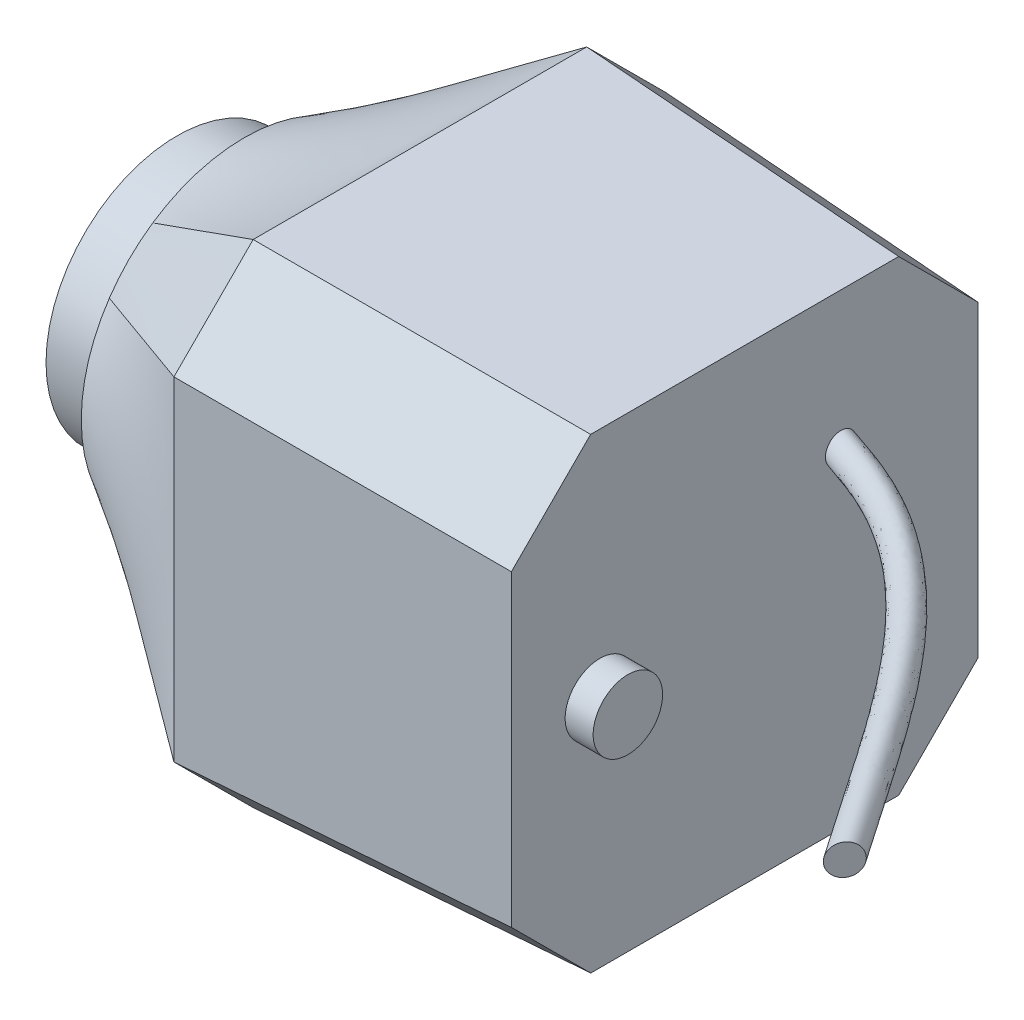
ISO-10303-21;
HEADER;
FILE_DESCRIPTION(('STEP AP214'),'2;1');
FILE_NAME('part.step','',(''),(''),'','','');
FILE_SCHEMA(('AUTOMOTIVE_DESIGN { 1 0 10303 214 1 1 1 1 }'));
ENDSEC;
DATA;
#1=APPLICATION_CONTEXT('core data for automotive mechanical design processes');
#2=APPLICATION_PROTOCOL_DEFINITION('international standard','automotive_design',2000,#1);
#3=PRODUCT_CONTEXT('',#1,'mechanical');
#4=PRODUCT('Part','Part','',(#3));
#5=PRODUCT_RELATED_PRODUCT_CATEGORY('part','',(#4));
#6=PRODUCT_DEFINITION_FORMATION('','',#4);
#7=PRODUCT_DEFINITION_CONTEXT('part definition',#1,'design');
#8=PRODUCT_DEFINITION('design','',#6,#7);
#9=PRODUCT_DEFINITION_SHAPE('','',#8);
#10=(LENGTH_UNIT() NAMED_UNIT(*) SI_UNIT(.MILLI.,.METRE.));
#11=(NAMED_UNIT(*) PLANE_ANGLE_UNIT() SI_UNIT($,.RADIAN.));
#12=(NAMED_UNIT(*) SI_UNIT($,.STERADIAN.) SOLID_ANGLE_UNIT());
#13=UNCERTAINTY_MEASURE_WITH_UNIT(LENGTH_MEASURE(1.E-05),#10,'distance_accuracy_value','');
#14=(GEOMETRIC_REPRESENTATION_CONTEXT(3) GLOBAL_UNCERTAINTY_ASSIGNED_CONTEXT((#13)) GLOBAL_UNIT_ASSIGNED_CONTEXT((#10,
#11,#12)) REPRESENTATION_CONTEXT('',''));
#15=CARTESIAN_POINT('',(0.,0.,0.));
#16=DIRECTION('',(0.,0.,1.));
#17=DIRECTION('',(1.,0.,0.));
#18=AXIS2_PLACEMENT_3D('',#15,#16,#17);
#19=CARTESIAN_POINT('',(14.732,0.,11.1633));
#20=DIRECTION('',(1.00000000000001,0.,0.));
#21=DIRECTION('',(0.,0.,-1.));
#22=AXIS2_PLACEMENT_3D('',#19,#20,#21);
#23=PLANE('',#22);
#24=CARTESIAN_POINT('',(14.732,11.1615747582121,6.57102062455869));
#25=DIRECTION('',(1.00000000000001,0.,0.));
#26=DIRECTION('',(0.,0.,-1.));
#27=AXIS2_PLACEMENT_3D('',#24,#25,#26);
#28=CIRCLE('',#27,1.5748);
#29=CARTESIAN_POINT('',(14.732,11.161574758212,4.99622062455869));
#30=VERTEX_POINT('',#29);
#31=EDGE_CURVE('E745',#30,#30,#28,.T.);
#32=ORIENTED_EDGE('',*,*,#31,.F.);
#33=EDGE_LOOP('',(#32));
#34=FACE_BOUND('',#33,.T.);
#35=DIRECTION('',(0.,0.,1.));
#36=VECTOR('',#35,1.);
#37=CARTESIAN_POINT('',(14.732,0.579079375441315,11.1633));
#38=LINE('',#37,#36);
#39=CARTESIAN_POINT('',(14.732,0.579079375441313,6.9843334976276));
#40=VERTEX_POINT('',#39);
#41=CARTESIAN_POINT('',(14.732,0.579079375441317,-6.98989133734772));
#42=VERTEX_POINT('',#41);
#43=EDGE_CURVE('E219',#40,#42,#38,.F.);
#44=ORIENTED_EDGE('',*,*,#43,.T.);
#45=DIRECTION('',(0.,-0.707652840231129,0.706560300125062));
#46=VECTOR('',#45,1.);
#47=CARTESIAN_POINT('',(14.732,-8.78749251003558,2.36221956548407));
#48=LINE('',#47,#46);
#49=CARTESIAN_POINT('',(14.732,4.17896650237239,-10.5842206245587));
#50=VERTEX_POINT('',#49);
#51=EDGE_CURVE('E225',#42,#50,#48,.F.);
#52=ORIENTED_EDGE('',*,*,#51,.T.);
#53=DIRECTION('',(0.,-1.,0.));
#54=VECTOR('',#53,1.);
#55=CARTESIAN_POINT('',(14.732,22.3266,-10.5842206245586));
#56=LINE('',#55,#54);
#57=CARTESIAN_POINT('',(14.732,18.1531913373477,-10.5842206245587));
#58=VERTEX_POINT('',#57);
#59=EDGE_CURVE('E450',#50,#58,#56,.F.);
#60=ORIENTED_EDGE('',*,*,#59,.T.);
#61=DIRECTION('',(0.,-0.706560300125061,-0.707652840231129));
#62=VECTOR('',#61,1.);
#63=CARTESIAN_POINT('',(14.732,19.9643671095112,-8.77024426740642));
#64=LINE('',#63,#62);
#65=CARTESIAN_POINT('',(14.732,21.7475206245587,-6.98433349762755));
#66=VERTEX_POINT('',#65);
#67=EDGE_CURVE('E228',#58,#66,#64,.F.);
#68=ORIENTED_EDGE('',*,*,#67,.T.);
#69=DIRECTION('',(0.,0.,-1.));
#70=VECTOR('',#69,1.);
#71=CARTESIAN_POINT('',(14.732,21.7475206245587,11.1633000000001));
#72=LINE('',#71,#70);
#73=CARTESIAN_POINT('',(14.732,21.7475206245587,6.98989133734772));
#74=VERTEX_POINT('',#73);
#75=EDGE_CURVE('E238',#66,#74,#72,.F.);
#76=ORIENTED_EDGE('',*,*,#75,.T.);
#77=DIRECTION('',(0.,0.707652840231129,-0.706560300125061));
#78=VECTOR('',#77,1.);
#79=CARTESIAN_POINT('',(14.732,8.77025759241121,19.947118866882));
#80=LINE('',#79,#78);
#81=CARTESIAN_POINT('',(14.732,18.1476334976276,10.5842206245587));
#82=VERTEX_POINT('',#81);
#83=EDGE_CURVE('E218',#74,#82,#80,.F.);
#84=ORIENTED_EDGE('',*,*,#83,.T.);
#85=DIRECTION('',(0.,1.,0.));
#86=VECTOR('',#85,1.);
#87=CARTESIAN_POINT('',(14.732,22.3266,10.5842206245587));
#88=LINE('',#87,#86);
#89=CARTESIAN_POINT('',(14.732,4.17340866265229,10.5842206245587));
#90=VERTEX_POINT('',#89);
#91=EDGE_CURVE('E203',#82,#90,#88,.F.);
#92=ORIENTED_EDGE('',*,*,#91,.T.);
#93=DIRECTION('',(0.,0.706560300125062,0.707652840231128));
#94=VECTOR('',#93,1.);
#95=CARTESIAN_POINT('',(14.732,2.37946780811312,8.78750583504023));
#96=LINE('',#95,#94);
#97=EDGE_CURVE('E215',#90,#40,#96,.F.);
#98=ORIENTED_EDGE('',*,*,#97,.T.);
#99=EDGE_LOOP('',(#44,#52,#60,#68,#76,#84,#92,#98));
#100=FACE_BOUND('',#99,.T.);
#101=CARTESIAN_POINT('',(14.732,14.8260206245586,-4.3612206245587));
#102=CARTESIAN_POINT('',(14.732,14.8260223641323,-4.32198557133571));
#103=CARTESIAN_POINT('',(14.732,14.8293374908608,-4.28272207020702));
#104=CARTESIAN_POINT('',(14.732,14.8425161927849,-4.2052764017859));
#105=CARTESIAN_POINT('',(14.732,14.8523876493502,-4.16709559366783));
#106=CARTESIAN_POINT('',(14.732,14.8783962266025,-4.09295350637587));
#107=CARTESIAN_POINT('',(14.732,14.8945295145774,-4.05699088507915));
#108=CARTESIAN_POINT('',(14.732,14.9326050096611,-3.98828498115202));
#109=CARTESIAN_POINT('',(14.732,14.954547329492,-3.95554176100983));
#110=CARTESIAN_POINT('',(14.732,15.0036169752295,-3.89420452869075));
#111=CARTESIAN_POINT('',(14.732,15.0307441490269,-3.86561039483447));
#112=CARTESIAN_POINT('',(14.732,15.0894150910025,-3.81338118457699));
#113=CARTESIAN_POINT('',(14.732,15.1209590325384,-3.78974630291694));
#114=CARTESIAN_POINT('',(14.732,15.1875665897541,-3.74810826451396));
#115=CARTESIAN_POINT('',(14.732,15.2226301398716,-3.73010500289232));
#116=CARTESIAN_POINT('',(14.732,15.2952819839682,-3.70024071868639));
#117=CARTESIAN_POINT('',(14.732,15.3328702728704,-3.68837968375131));
#118=CARTESIAN_POINT('',(14.732,15.4095047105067,-3.67113647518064));
#119=CARTESIAN_POINT('',(14.732,15.4485508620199,-3.66575431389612));
#120=CARTESIAN_POINT('',(14.732,15.5269924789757,-3.6616216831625));
#121=CARTESIAN_POINT('',(14.732,15.5663879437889,-3.66287120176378));
#122=CARTESIAN_POINT('',(14.732,15.6444099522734,-3.67196643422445));
#123=CARTESIAN_POINT('',(14.732,15.6830364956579,-3.67981215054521));
#124=CARTESIAN_POINT('',(14.732,15.7584241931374,-3.70187707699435));
#125=CARTESIAN_POINT('',(14.732,15.7951853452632,-3.71609629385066));
#126=CARTESIAN_POINT('',(14.732,15.8657986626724,-3.75050457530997));
#127=CARTESIAN_POINT('',(14.732,15.8996508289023,-3.77069363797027));
#128=CARTESIAN_POINT('',(14.732,15.9634852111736,-3.81646849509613));
#129=CARTESIAN_POINT('',(14.732,15.9934674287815,-3.84205428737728));
#130=CARTESIAN_POINT('',(14.732,16.0487108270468,-3.89789630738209));
#131=CARTESIAN_POINT('',(14.732,16.0739720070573,-3.9281525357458));
#132=CARTESIAN_POINT('',(14.732,16.1190562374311,-3.99247654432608));
#133=CARTESIAN_POINT('',(14.732,16.1388792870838,-4.02654432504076));
#134=CARTESIAN_POINT('',(14.732,16.1725245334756,-4.09752434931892));
#135=CARTESIAN_POINT('',(14.732,16.1863467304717,-4.1344365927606));
#136=CARTESIAN_POINT('',(14.732,16.2075979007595,-4.21005771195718));
#137=CARTESIAN_POINT('',(14.732,16.2150268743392,-4.24876658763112));
#138=CARTESIAN_POINT('',(14.732,16.2232807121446,-4.32688214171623));
#139=CARTESIAN_POINT('',(14.732,16.2241055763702,-4.3662888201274));
#140=CARTESIAN_POINT('',(14.732,16.2191277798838,-4.44468134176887));
#141=CARTESIAN_POINT('',(14.732,16.2133251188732,-4.48366718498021));
#142=CARTESIAN_POINT('',(14.732,16.1952569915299,-4.56011134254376));
#143=CARTESIAN_POINT('',(14.732,16.1829915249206,-4.59756965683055));
#144=CARTESIAN_POINT('',(14.732,16.1523459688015,-4.66989541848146));
#145=CARTESIAN_POINT('',(14.732,16.1339658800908,-4.70476286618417));
#146=CARTESIAN_POINT('',(14.732,16.0916128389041,-4.77091711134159));
#147=CARTESIAN_POINT('',(14.732,16.0676398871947,-4.802203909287));
#148=CARTESIAN_POINT('',(14.732,16.0147816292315,-4.86030873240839));
#149=CARTESIAN_POINT('',(14.732,15.9858963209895,-4.88712675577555));
#150=CARTESIAN_POINT('',(14.732,15.924033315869,-4.93553273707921));
#151=CARTESIAN_POINT('',(14.732,15.8910556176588,-4.95712069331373));
#152=CARTESIAN_POINT('',(14.732,15.8219440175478,-4.99445368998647));
#153=CARTESIAN_POINT('',(14.732,15.7858101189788,-5.0101987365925));
#154=CARTESIAN_POINT('',(14.732,15.711411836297,-5.03539898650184));
#155=CARTESIAN_POINT('',(14.732,15.6731474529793,-5.04485419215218));
#156=CARTESIAN_POINT('',(14.732,15.5955743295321,-5.05720637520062));
#157=CARTESIAN_POINT('',(14.732,15.5562655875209,-5.0601033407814));
#158=CARTESIAN_POINT('',(14.732,15.4777197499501,-5.05925677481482));
#159=CARTESIAN_POINT('',(14.732,15.4384826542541,-5.0555132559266));
#160=CARTESIAN_POINT('',(14.732,15.3611937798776,-5.04149199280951));
#161=CARTESIAN_POINT('',(14.732,15.3231420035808,-5.03121423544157));
#162=CARTESIAN_POINT('',(14.732,15.2493033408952,-5.00441601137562));
#163=CARTESIAN_POINT('',(14.732,15.2135164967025,-4.98789542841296));
#164=CARTESIAN_POINT('',(14.732,15.1452257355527,-4.94908123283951));
#165=CARTESIAN_POINT('',(14.732,15.1127216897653,-4.92678784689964));
#166=CARTESIAN_POINT('',(14.732,15.0519167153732,-4.87706017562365));
#167=CARTESIAN_POINT('',(14.732,15.023615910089,-4.84962573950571));
#168=CARTESIAN_POINT('',(14.732,14.9720223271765,-4.79039444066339));
#169=CARTESIAN_POINT('',(14.732,14.9487294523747,-4.75859766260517));
#170=CARTESIAN_POINT('',(14.732,14.9078002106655,-4.6915283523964));
#171=CARTESIAN_POINT('',(14.732,14.8901673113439,-4.65625370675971));
#172=CARTESIAN_POINT('',(14.732,14.8610942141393,-4.58327244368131));
#173=CARTESIAN_POINT('',(14.732,14.8496465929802,-4.54556880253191));
#174=CARTESIAN_POINT('',(14.732,14.836320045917,-4.48322416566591));
#175=CARTESIAN_POINT('',(14.732,14.83246258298,-4.45898827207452));
#176=CARTESIAN_POINT('',(14.732,14.8273123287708,-4.41024549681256));
#177=CARTESIAN_POINT('',(14.732,14.8260195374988,-4.385738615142));
#178=CARTESIAN_POINT('',(14.732,14.8260206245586,-4.3612206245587));
#179=B_SPLINE_CURVE_WITH_KNOTS('',3,(#101,#102,#103,#104,#105,#106,#107,#108,#109,#110,#111,
#112,#113,#114,#115,#116,#117,#118,#119,#120,#121,#122,#123,#124,#125,#126,#127,#128,#129,#130,
#131,#132,#133,#134,#135,#136,#137,#138,#139,#140,#141,#142,#143,#144,#145,#146,#147,#148,#149,
#150,#151,#152,#153,#154,#155,#156,#157,#158,#159,#160,#161,#162,#163,#164,#165,#166,#167,#168,
#169,#170,#171,#172,#173,#174,#175,#176,#177,#178),.UNSPECIFIED.,.T.,.F.,(4,2,2,2,2,2,2,2,2,2,2,
2,2,2,2,2,2,2,2,2,2,2,2,2,2,2,2,2,2,2,2,2,2,2,2,2,2,2,4),(0.,0.117615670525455,
0.235372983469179,0.353058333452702,0.47074596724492,0.588430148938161,0.706118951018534,
0.823805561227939,0.941491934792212,1.05917853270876,1.17686491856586,1.29455134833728,
1.41223790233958,1.52992441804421,1.64761088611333,1.76529737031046,1.88298386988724,
2.0006703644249,2.11835685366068,2.23604334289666,2.35372983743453,2.47141633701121,
2.58910282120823,2.70678928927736,2.82447580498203,2.94216235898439,3.05984878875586,
3.17753517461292,3.29522177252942,3.41290814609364,3.53059475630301,3.64828355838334,
3.76596774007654,3.88365537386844,4.00134072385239,4.11909803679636,4.23671370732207,
4.31021175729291,4.38370980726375),.UNSPECIFIED.);
#180=CARTESIAN_POINT('',(14.732,15.5245206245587,-5.0597206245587));
#181=VERTEX_POINT('',#180);
#182=EDGE_CURVE('E109',#181,#181,#179,.F.);
#183=ORIENTED_EDGE('',*,*,#182,.F.);
#184=EDGE_LOOP('',(#183));
#185=FACE_BOUND('',#184,.T.);
#186=ADVANCED_FACE('F105',(#34,#100,#185),#23,.T.);
#187=CARTESIAN_POINT('',(-11.0236000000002,11.1633,0.));
#188=DIRECTION('',(-1.00000000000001,0.,0.));
#189=DIRECTION('',(0.,0.,1.));
#190=AXIS2_PLACEMENT_3D('',#187,#188,#189);
#191=PLANE('',#190);
#192=CARTESIAN_POINT('',(-11.0236000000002,11.1633,0.));
#193=DIRECTION('',(-1.00000000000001,0.,0.));
#194=DIRECTION('',(0.,0.,1.));
#195=AXIS2_PLACEMENT_3D('',#192,#193,#194);
#196=CIRCLE('',#195,5.9436);
#197=CARTESIAN_POINT('',(-11.0236000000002,11.1633,5.94360000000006));
#198=VERTEX_POINT('',#197);
#199=EDGE_CURVE('E286',#198,#198,#196,.T.);
#200=ORIENTED_EDGE('',*,*,#199,.T.);
#201=EDGE_LOOP('',(#200));
#202=FACE_BOUND('',#201,.T.);
#203=CARTESIAN_POINT('',(-11.0236000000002,11.1633,0.));
#204=DIRECTION('',(1.00000000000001,0.,0.));
#205=DIRECTION('',(0.,0.,-1.));
#206=AXIS2_PLACEMENT_3D('',#203,#204,#205);
#207=CIRCLE('',#206,2.159);
#208=CARTESIAN_POINT('',(-11.0236000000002,11.1633,-2.15899999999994));
#209=VERTEX_POINT('',#208);
#210=EDGE_CURVE('E734',#209,#209,#207,.T.);
#211=ORIENTED_EDGE('',*,*,#210,.T.);
#212=EDGE_LOOP('',(#211));
#213=FACE_BOUND('',#212,.T.);
#214=ADVANCED_FACE('F333',(#202,#213),#191,.T.);
#215=CARTESIAN_POINT('',(-7.97560000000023,11.1633,0.));
#216=DIRECTION('',(1.00000000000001,0.,0.));
#217=DIRECTION('',(0.,0.,-1.));
#218=AXIS2_PLACEMENT_3D('',#215,#216,#217);
#219=PLANE('',#218);
#220=CARTESIAN_POINT('',(-7.97560000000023,11.1633,0.));
#221=DIRECTION('',(1.00000000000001,0.,0.));
#222=DIRECTION('',(0.,0.,-1.));
#223=AXIS2_PLACEMENT_3D('',#220,#221,#222);
#224=CIRCLE('',#223,7.3914);
#225=CARTESIAN_POINT('',(-7.97560000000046,15.3112826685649,-6.11776378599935));
#226=VERTEX_POINT('',#225);
#227=CARTESIAN_POINT('',(-7.97560000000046,17.2824785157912,-4.14589534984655));
#228=VERTEX_POINT('',#227);
#229=EDGE_CURVE('E259',#226,#228,#224,.T.);
#230=ORIENTED_EDGE('',*,*,#229,.F.);
#231=CARTESIAN_POINT('',(-7.97560000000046,7.01740465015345,-6.11917851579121));
#232=VERTEX_POINT('',#231);
#233=EDGE_CURVE('E387',#232,#226,#224,.T.);
#234=ORIENTED_EDGE('',*,*,#233,.F.);
#235=CARTESIAN_POINT('',(-7.97560000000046,5.04553621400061,-4.1479826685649));
#236=VERTEX_POINT('',#235);
#237=EDGE_CURVE('E170',#236,#232,#224,.T.);
#238=ORIENTED_EDGE('',*,*,#237,.F.);
#239=CARTESIAN_POINT('',(-7.97560000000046,5.04412148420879,4.14589534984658));
#240=VERTEX_POINT('',#239);
#241=EDGE_CURVE('E386',#240,#236,#224,.T.);
#242=ORIENTED_EDGE('',*,*,#241,.F.);
#243=CARTESIAN_POINT('',(-7.97560000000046,7.01531733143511,6.11776378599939));
#244=VERTEX_POINT('',#243);
#245=EDGE_CURVE('E404',#244,#240,#224,.T.);
#246=ORIENTED_EDGE('',*,*,#245,.F.);
#247=CARTESIAN_POINT('',(-7.97560000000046,15.3091953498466,6.11917851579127));
#248=VERTEX_POINT('',#247);
#249=EDGE_CURVE('E403',#248,#244,#224,.T.);
#250=ORIENTED_EDGE('',*,*,#249,.F.);
#251=CARTESIAN_POINT('',(-7.97560000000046,17.2810637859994,4.14798266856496));
#252=VERTEX_POINT('',#251);
#253=EDGE_CURVE('E276',#252,#248,#224,.T.);
#254=ORIENTED_EDGE('',*,*,#253,.F.);
#255=EDGE_CURVE('E400',#228,#252,#224,.T.);
#256=ORIENTED_EDGE('',*,*,#255,.F.);
#257=EDGE_LOOP('',(#230,#234,#238,#242,#246,#250,#254,#256));
#258=FACE_BOUND('',#257,.T.);
#259=CARTESIAN_POINT('',(-7.97560000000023,11.1633,0.));
#260=DIRECTION('',(1.00000000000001,0.,0.));
#261=DIRECTION('',(0.,0.,-1.));
#262=AXIS2_PLACEMENT_3D('',#259,#260,#261);
#263=CIRCLE('',#262,5.9436);
#264=CARTESIAN_POINT('',(-7.97560000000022,11.1633,-5.94359999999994));
#265=VERTEX_POINT('',#264);
#266=EDGE_CURVE('E12',#265,#265,#263,.F.);
#267=ORIENTED_EDGE('',*,*,#266,.F.);
#268=EDGE_LOOP('',(#267));
#269=FACE_BOUND('',#268,.T.);
#270=ADVANCED_FACE('F324',(#258,#269),#219,.F.);
#271=CARTESIAN_POINT('',(0.,22.3266,11.1633000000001));
#272=DIRECTION('',(0.0392772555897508,0.,0.999228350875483));
#273=DIRECTION('',(0.999228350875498,0.,-0.039277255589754));
#274=AXIS2_PLACEMENT_3D('',#271,#272,#273);
#275=PLANE('',#274);
#276=DIRECTION('',(0.,1.,0.));
#277=VECTOR('',#276,1.);
#278=CARTESIAN_POINT('',(0.,22.3266,11.1633000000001));
#279=LINE('',#278,#277);
#280=CARTESIAN_POINT('',(0.,18.7267128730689,11.1633));
#281=VERTEX_POINT('',#280);
#282=CARTESIAN_POINT('',(0.,3.59432928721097,11.1633));
#283=VERTEX_POINT('',#282);
#284=EDGE_CURVE('E205',#281,#283,#279,.F.);
#285=ORIENTED_EDGE('',*,*,#284,.T.);
#286=DIRECTION('',(-0.998458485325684,-0.039246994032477,0.0392469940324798));
#287=VECTOR('',#286,1.);
#288=CARTESIAN_POINT('',(0.734052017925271,3.62318310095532,11.1344461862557));
#289=LINE('',#288,#287);
#290=EDGE_CURVE('E199',#283,#90,#289,.F.);
#291=ORIENTED_EDGE('',*,*,#290,.T.);
#292=ORIENTED_EDGE('',*,*,#91,.F.);
#293=DIRECTION('',(0.998458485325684,-0.0392469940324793,-0.0392469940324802));
#294=VECTOR('',#293,1.);
#295=CARTESIAN_POINT('',(-0.141066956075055,18.7322578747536,11.1688450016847));
#296=LINE('',#295,#294);
#297=EDGE_CURVE('E210',#82,#281,#296,.F.);
#298=ORIENTED_EDGE('',*,*,#297,.T.);
#299=EDGE_LOOP('',(#285,#291,#292,#298));
#300=FACE_BOUND('',#299,.T.);
#301=ADVANCED_FACE('F201',(#300),#275,.T.);
#302=CARTESIAN_POINT('',(0.,0.,11.1633));
#303=DIRECTION('',(0.0392772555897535,-0.999228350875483,0.));
#304=DIRECTION('',(0.999228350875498,0.0392772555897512,0.));
#305=AXIS2_PLACEMENT_3D('',#302,#303,#304);
#306=PLANE('',#305);
#307=DIRECTION('',(0.,0.,1.));
#308=VECTOR('',#307,1.);
#309=CARTESIAN_POINT('',(0.,0.,11.1633));
#310=LINE('',#309,#308);
#311=CARTESIAN_POINT('',(0.,0.,7.56341287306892));
#312=VERTEX_POINT('',#311);
#313=CARTESIAN_POINT('',(-2.28983498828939E-13,0.,-7.56897071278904));
#314=VERTEX_POINT('',#313);
#315=EDGE_CURVE('E252',#312,#314,#310,.F.);
#316=ORIENTED_EDGE('',*,*,#315,.T.);
#317=DIRECTION('',(-0.998458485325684,-0.0392469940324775,-0.0392469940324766));
#318=VECTOR('',#317,1.);
#319=CARTESIAN_POINT('',(0.734052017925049,0.0288538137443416,-7.5401168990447));
#320=LINE('',#319,#318);
#321=EDGE_CURVE('E242',#314,#42,#320,.F.);
#322=ORIENTED_EDGE('',*,*,#321,.T.);
#323=ORIENTED_EDGE('',*,*,#43,.F.);
#324=DIRECTION('',(0.998458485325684,0.039246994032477,-0.0392469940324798));
#325=VECTOR('',#324,1.);
#326=CARTESIAN_POINT('',(-0.141066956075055,-0.0055450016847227,7.56895787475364));
#327=LINE('',#326,#325);
#328=EDGE_CURVE('E224',#40,#312,#327,.F.);
#329=ORIENTED_EDGE('',*,*,#328,.T.);
#330=EDGE_LOOP('',(#316,#322,#323,#329));
#331=FACE_BOUND('',#330,.T.);
#332=ADVANCED_FACE('F107',(#331),#306,.T.);
#333=CARTESIAN_POINT('',(-2.28983498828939E-13,22.3266,-11.1632999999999));
#334=DIRECTION('',(0.0392772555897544,0.,-0.999228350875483));
#335=DIRECTION('',(-0.999228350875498,0.,-0.0392772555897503));
#336=AXIS2_PLACEMENT_3D('',#333,#334,#335);
#337=PLANE('',#336);
#338=ORIENTED_EDGE('',*,*,#59,.F.);
#339=DIRECTION('',(0.998458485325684,0.0392469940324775,0.0392469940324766));
#340=VECTOR('',#339,1.);
#341=CARTESIAN_POINT('',(0.733834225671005,3.6287323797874,-11.1344547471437));
#342=LINE('',#341,#340);
#343=CARTESIAN_POINT('',(-2.28983498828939E-13,3.59988712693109,-11.1633));
#344=VERTEX_POINT('',#343);
#345=EDGE_CURVE('E237',#50,#344,#342,.F.);
#346=ORIENTED_EDGE('',*,*,#345,.T.);
#347=DIRECTION('',(0.,1.,0.));
#348=VECTOR('',#347,1.);
#349=CARTESIAN_POINT('',(-2.28983498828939E-13,22.3266,-11.1632999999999));
#350=LINE('',#349,#348);
#351=CARTESIAN_POINT('',(-2.28983498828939E-13,18.732270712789,-11.1633));
#352=VERTEX_POINT('',#351);
#353=EDGE_CURVE('E249',#344,#352,#350,.T.);
#354=ORIENTED_EDGE('',*,*,#353,.T.);
#355=DIRECTION('',(-0.998458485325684,0.0392469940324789,-0.0392469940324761));
#356=VECTOR('',#355,1.);
#357=CARTESIAN_POINT('',(-0.14084916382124,18.7378071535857,-11.1688364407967));
#358=LINE('',#357,#356);
#359=EDGE_CURVE('E235',#352,#58,#358,.F.);
#360=ORIENTED_EDGE('',*,*,#359,.T.);
#361=EDGE_LOOP('',(#338,#346,#354,#360));
#362=FACE_BOUND('',#361,.T.);
#363=ADVANCED_FACE('F461',(#362),#337,.T.);
#364=CARTESIAN_POINT('',(0.,22.3266,11.1633000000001));
#365=DIRECTION('',(0.0392772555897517,0.999228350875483,0.));
#366=DIRECTION('',(-0.999228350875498,0.039277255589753,0.));
#367=AXIS2_PLACEMENT_3D('',#364,#365,#366);
#368=PLANE('',#367);
#369=DIRECTION('',(0.,0.,1.));
#370=VECTOR('',#369,1.);
#371=CARTESIAN_POINT('',(0.,22.3266,11.1633000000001));
#372=LINE('',#371,#370);
#373=CARTESIAN_POINT('',(-2.35922392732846E-13,22.3266,-7.56341287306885));
#374=VERTEX_POINT('',#373);
#375=CARTESIAN_POINT('',(0.,22.3266,7.56897071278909));
#376=VERTEX_POINT('',#375);
#377=EDGE_CURVE('E162',#374,#376,#372,.T.);
#378=ORIENTED_EDGE('',*,*,#377,.T.);
#379=DIRECTION('',(-0.998458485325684,0.0392469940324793,0.0392469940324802));
#380=VECTOR('',#379,1.);
#381=CARTESIAN_POINT('',(-0.140849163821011,22.3321364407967,7.57450715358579));
#382=LINE('',#381,#380);
#383=EDGE_CURVE('E119',#376,#74,#382,.F.);
#384=ORIENTED_EDGE('',*,*,#383,.T.);
#385=ORIENTED_EDGE('',*,*,#75,.F.);
#386=DIRECTION('',(0.998458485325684,-0.0392469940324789,0.0392469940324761));
#387=VECTOR('',#386,1.);
#388=CARTESIAN_POINT('',(0.733834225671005,22.2977547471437,-7.5345676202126));
#389=LINE('',#388,#387);
#390=EDGE_CURVE('E209',#66,#374,#389,.F.);
#391=ORIENTED_EDGE('',*,*,#390,.T.);
#392=EDGE_LOOP('',(#378,#384,#385,#391));
#393=FACE_BOUND('',#392,.T.);
#394=ADVANCED_FACE('F262',(#393),#368,.T.);
#395=CARTESIAN_POINT('',(0.733834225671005,3.6287323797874,-11.1344547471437));
#396=DIRECTION('',(-0.0555036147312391,0.705471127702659,0.706561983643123));
#397=DIRECTION('',(0.,-0.707652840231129,0.706560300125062));
#398=AXIS2_PLACEMENT_3D('',#395,#396,#397);
#399=PLANE('',#398);
#400=ORIENTED_EDGE('',*,*,#51,.F.);
#401=ORIENTED_EDGE('',*,*,#321,.F.);
#402=DIRECTION('',(0.,-0.707652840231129,0.706560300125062));
#403=VECTOR('',#402,1.);
#404=CARTESIAN_POINT('',(-2.28983498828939E-13,3.59990942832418,-11.1633222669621));
#405=LINE('',#404,#403);
#406=EDGE_CURVE('E244',#344,#314,#405,.T.);
#407=ORIENTED_EDGE('',*,*,#406,.F.);
#408=ORIENTED_EDGE('',*,*,#345,.F.);
#409=EDGE_LOOP('',(#400,#401,#407,#408));
#410=FACE_BOUND('',#409,.T.);
#411=ADVANCED_FACE('F465',(#410),#399,.F.);
#412=CARTESIAN_POINT('',(-0.141066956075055,-0.0055450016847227,7.56895787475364));
#413=DIRECTION('',(-0.0555036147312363,0.706561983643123,-0.705471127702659));
#414=DIRECTION('',(0.,0.706560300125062,0.707652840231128));
#415=AXIS2_PLACEMENT_3D('',#412,#413,#414);
#416=PLANE('',#415);
#417=ORIENTED_EDGE('',*,*,#97,.F.);
#418=ORIENTED_EDGE('',*,*,#290,.F.);
#419=DIRECTION('',(0.,0.706560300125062,0.707652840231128));
#420=VECTOR('',#419,1.);
#421=CARTESIAN_POINT('',(0.,4.2804389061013E-06,7.56341716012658));
#422=LINE('',#421,#420);
#423=EDGE_CURVE('E254',#312,#283,#422,.T.);
#424=ORIENTED_EDGE('',*,*,#423,.F.);
#425=ORIENTED_EDGE('',*,*,#328,.F.);
#426=EDGE_LOOP('',(#417,#418,#424,#425));
#427=FACE_BOUND('',#426,.T.);
#428=ADVANCED_FACE('F222',(#427),#416,.F.);
#429=CARTESIAN_POINT('',(-0.141066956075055,18.7322578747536,11.1688450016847));
#430=DIRECTION('',(-0.0555036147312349,-0.705471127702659,-0.706561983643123));
#431=DIRECTION('',(0.,0.707652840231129,-0.706560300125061));
#432=AXIS2_PLACEMENT_3D('',#429,#430,#431);
#433=PLANE('',#432);
#434=ORIENTED_EDGE('',*,*,#83,.F.);
#435=ORIENTED_EDGE('',*,*,#383,.F.);
#436=DIRECTION('',(0.,0.707652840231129,-0.706560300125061));
#437=VECTOR('',#436,1.);
#438=CARTESIAN_POINT('',(0.,18.7267171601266,11.1632957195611));
#439=LINE('',#438,#437);
#440=EDGE_CURVE('E248',#281,#376,#439,.T.);
#441=ORIENTED_EDGE('',*,*,#440,.F.);
#442=ORIENTED_EDGE('',*,*,#297,.F.);
#443=EDGE_LOOP('',(#434,#435,#441,#442));
#444=FACE_BOUND('',#443,.T.);
#445=ADVANCED_FACE('F266',(#444),#433,.F.);
#446=CARTESIAN_POINT('',(0.733834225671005,22.2977547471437,-7.53456762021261));
#447=DIRECTION('',(-0.0555036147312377,-0.706561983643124,0.705471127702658));
#448=DIRECTION('',(0.,-0.706560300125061,-0.707652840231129));
#449=AXIS2_PLACEMENT_3D('',#446,#447,#448);
#450=PLANE('',#449);
#451=ORIENTED_EDGE('',*,*,#67,.F.);
#452=ORIENTED_EDGE('',*,*,#359,.F.);
#453=DIRECTION('',(0.,-0.706560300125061,-0.707652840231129));
#454=VECTOR('',#453,1.);
#455=CARTESIAN_POINT('',(-2.28983498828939E-13,22.3266222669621,-7.56339057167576));
#456=LINE('',#455,#454);
#457=EDGE_CURVE('E241',#374,#352,#456,.T.);
#458=ORIENTED_EDGE('',*,*,#457,.F.);
#459=ORIENTED_EDGE('',*,*,#390,.F.);
#460=EDGE_LOOP('',(#451,#452,#458,#459));
#461=FACE_BOUND('',#460,.T.);
#462=ADVANCED_FACE('F319',(#461),#450,.F.);
#463=CARTESIAN_POINT('',(-2.28983498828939E-13,22.3266,-7.56341287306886));
#464=CARTESIAN_POINT('',(-7.97560000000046,17.2824785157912,-4.14589534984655));
#465=CARTESIAN_POINT('',(0.,21.7275451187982,-8.16339406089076));
#466=CARTESIAN_POINT('',(-7.97560000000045,17.0218276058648,-4.530605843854));
#467=CARTESIAN_POINT('',(0.,21.1284902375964,-8.7633752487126));
#468=CARTESIAN_POINT('',(-7.97560000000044,16.7222080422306,-4.89399681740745));
#469=CARTESIAN_POINT('',(0.,19.9303804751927,-9.9633376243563));
#470=CARTESIAN_POINT('',(-7.97560000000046,16.0591929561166,-5.55723812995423));
#471=CARTESIAN_POINT('',(0.,19.3313255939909,-10.5633188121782));
#472=CARTESIAN_POINT('',(-7.97560000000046,15.6959042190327,-5.85698164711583));
#473=CARTESIAN_POINT('',(-2.28983498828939E-13,18.732270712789,-11.1633));
#474=CARTESIAN_POINT('',(-7.97560000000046,15.3112826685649,-6.11776378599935));
#475=B_SPLINE_SURFACE_WITH_KNOTS('',3,1,((#463,#464),(#465,#466),(#467,#468),(#469,#470),(#471,
#472),(#473,#474)),.UNSPECIFIED.,.F.,.F.,.F.,(4,2,4),(2,2),(0.,0.5,1.),(0.,1.),.UNSPECIFIED.);
#476=DIRECTION('',(-0.794503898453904,-0.340787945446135,0.502620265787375));
#477=VECTOR('',#476,1.);
#478=CARTESIAN_POINT('',(-3.98780000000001,17.021776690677,-8.64053189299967));
#479=LINE('',#478,#477);
#480=EDGE_CURVE('E427',#352,#226,#479,.T.);
#481=DIRECTION('',(0.794653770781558,0.502574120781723,-0.340506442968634));
#482=VECTOR('',#481,1.);
#483=CARTESIAN_POINT('',(-3.98780000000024,19.8045392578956,-5.85465411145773));
#484=LINE('',#483,#482);
#485=EDGE_CURVE('E419',#228,#374,#484,.T.);
#486=ORIENTED_EDGE('',*,*,#457,.T.);
#487=ORIENTED_EDGE('',*,*,#480,.T.);
#488=ORIENTED_EDGE('',*,*,#229,.T.);
#489=ORIENTED_EDGE('',*,*,#485,.T.);
#490=EDGE_LOOP('',(#486,#487,#488,#489));
#491=FACE_BOUND('',#490,.T.);
#492=ADVANCED_FACE('F306',(#491),#475,.T.);
#493=CARTESIAN_POINT('',(-2.28983498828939E-13,18.732270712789,-11.1633));
#494=CARTESIAN_POINT('',(-7.97560000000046,15.3112826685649,-6.11776378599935));
#495=CARTESIAN_POINT('',(-2.28983498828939E-13,17.4712387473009,-11.1632999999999));
#496=CARTESIAN_POINT('',(-7.97560000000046,14.7392215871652,-6.50563418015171));
#497=CARTESIAN_POINT('',(-2.28983498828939E-13,16.2102067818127,-11.1632999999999));
#498=CARTESIAN_POINT('',(-7.97560000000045,14.0859535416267,-6.82911599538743));
#499=CARTESIAN_POINT('',(-2.28983498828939E-13,13.6881428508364,-11.1633));
#500=CARTESIAN_POINT('',(-7.97560000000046,12.6762969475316,-7.2725215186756));
#501=CARTESIAN_POINT('',(-2.28983498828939E-13,12.4271108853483,-11.1632999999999));
#502=CARTESIAN_POINT('',(-7.97560000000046,11.9208395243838,-7.39127089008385));
#503=CARTESIAN_POINT('',(-2.28983498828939E-13,9.90504695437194,-11.1633));
#504=CARTESIAN_POINT('',(-7.97560000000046,10.4082820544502,-7.39152889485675));
#505=CARTESIAN_POINT('',(-2.28983498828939E-13,8.64401498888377,-11.1632999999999));
#506=CARTESIAN_POINT('',(-7.97560000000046,9.65278416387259,-7.27303725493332));
#507=CARTESIAN_POINT('',(-2.28983498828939E-13,6.12195105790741,-11.1633));
#508=CARTESIAN_POINT('',(-7.97560000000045,8.2429763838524,-6.83011266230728));
#509=CARTESIAN_POINT('',(-2.28983498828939E-13,4.86091909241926,-11.1633));
#510=CARTESIAN_POINT('',(-7.97560000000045,7.58959802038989,-6.5068537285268));
#511=CARTESIAN_POINT('',(-2.28983498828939E-13,3.59988712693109,-11.1633));
#512=CARTESIAN_POINT('',(-7.97560000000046,7.01740465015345,-6.11917851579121));
#513=B_SPLINE_SURFACE_WITH_KNOTS('',3,1,((#493,#494),(#495,#496),(#497,#498),(#499,#500),(#501,
#502),(#503,#504),(#505,#506),(#507,#508),(#509,#510),(#511,#512)),.UNSPECIFIED.,.F.,.F.,.F.,(4,
2,2,2,4),(2,2),(0.,0.25,0.5,0.75,1.),(0.,1.),.UNSPECIFIED.);
#514=DIRECTION('',(-0.794653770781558,0.340506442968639,0.502574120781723));
#515=VECTOR('',#514,1.);
#516=CARTESIAN_POINT('',(-3.98780000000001,5.30864588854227,-8.64123925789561));
#517=LINE('',#516,#515);
#518=EDGE_CURVE('E429',#344,#232,#517,.T.);
#519=ORIENTED_EDGE('',*,*,#353,.F.);
#520=ORIENTED_EDGE('',*,*,#518,.T.);
#521=ORIENTED_EDGE('',*,*,#233,.T.);
#522=ORIENTED_EDGE('',*,*,#480,.F.);
#523=EDGE_LOOP('',(#519,#520,#521,#522));
#524=FACE_BOUND('',#523,.T.);
#525=ADVANCED_FACE('F318',(#524),#513,.T.);
#526=CARTESIAN_POINT('',(0.,22.3266,7.56897071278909));
#527=CARTESIAN_POINT('',(-7.97560000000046,17.2810637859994,4.14798266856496));
#528=CARTESIAN_POINT('',(-2.28983498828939E-13,22.3266,6.30793874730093));
#529=CARTESIAN_POINT('',(-7.97560000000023,17.6689341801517,3.57592158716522));
#530=CARTESIAN_POINT('',(-2.28983498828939E-13,22.3266,5.04690678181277));
#531=CARTESIAN_POINT('',(-7.97560000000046,17.9924159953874,2.92265354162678));
#532=CARTESIAN_POINT('',(-2.28983498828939E-13,22.3266,2.52484285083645));
#533=CARTESIAN_POINT('',(-7.97560000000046,18.4358215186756,1.51299694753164));
#534=CARTESIAN_POINT('',(-2.28983498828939E-13,22.3266,1.26381088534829));
#535=CARTESIAN_POINT('',(-7.97560000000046,18.5545708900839,0.757539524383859));
#536=CARTESIAN_POINT('',(0.,22.3266,-1.25825304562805));
#537=CARTESIAN_POINT('',(-7.97560000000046,18.5548288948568,-0.755017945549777));
#538=CARTESIAN_POINT('',(-2.28983498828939E-13,22.3266,-2.5192850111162));
#539=CARTESIAN_POINT('',(-7.97560000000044,18.4363372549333,-1.51051583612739));
#540=CARTESIAN_POINT('',(0.,22.3266,-5.04134894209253));
#541=CARTESIAN_POINT('',(-7.97560000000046,17.9934126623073,-2.92032361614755));
#542=CARTESIAN_POINT('',(-2.28983498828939E-13,22.3266,-6.30238090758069));
#543=CARTESIAN_POINT('',(-7.97560000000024,17.6701537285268,-3.57370197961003));
#544=CARTESIAN_POINT('',(-2.28983498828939E-13,22.3266,-7.56341287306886));
#545=CARTESIAN_POINT('',(-7.97560000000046,17.2824785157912,-4.14589534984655));
#546=B_SPLINE_SURFACE_WITH_KNOTS('',3,1,((#526,#527),(#528,#529),(#530,#531),(#532,#533),(#534,
#535),(#536,#537),(#538,#539),(#540,#541),(#542,#543),(#544,#545)),.UNSPECIFIED.,.F.,.F.,.F.,(4,
2,2,2,4),(2,2),(0.,0.25,0.5,0.75,1.),(0.,1.),.UNSPECIFIED.);
#547=DIRECTION('',(-0.794503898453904,-0.502620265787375,-0.34078794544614));
#548=VECTOR('',#547,1.);
#549=CARTESIAN_POINT('',(-3.98780000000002,19.8038318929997,5.85847669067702));
#550=LINE('',#549,#548);
#551=EDGE_CURVE('E272',#376,#252,#550,.T.);
#552=ORIENTED_EDGE('',*,*,#377,.F.);
#553=ORIENTED_EDGE('',*,*,#485,.F.);
#554=ORIENTED_EDGE('',*,*,#255,.T.);
#555=ORIENTED_EDGE('',*,*,#551,.F.);
#556=EDGE_LOOP('',(#552,#553,#554,#555));
#557=FACE_BOUND('',#556,.T.);
#558=ADVANCED_FACE('F418',(#557),#546,.T.);
#559=CARTESIAN_POINT('',(-2.28983498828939E-13,3.59988712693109,-11.1633));
#560=CARTESIAN_POINT('',(-7.97560000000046,7.01740465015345,-6.11917851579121));
#561=CARTESIAN_POINT('',(0.,2.99990593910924,-10.5642451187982));
#562=CARTESIAN_POINT('',(-7.97560000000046,6.63269415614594,-5.85852760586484));
#563=CARTESIAN_POINT('',(0.,2.39992475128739,-9.96519023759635));
#564=CARTESIAN_POINT('',(-7.97560000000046,6.2693031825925,-5.5589080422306));
#565=CARTESIAN_POINT('',(0.,1.19996237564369,-8.76708047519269));
#566=CARTESIAN_POINT('',(-7.97560000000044,5.60606187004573,-4.89589295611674));
#567=CARTESIAN_POINT('',(0.,0.599981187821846,-8.16802559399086));
#568=CARTESIAN_POINT('',(-7.97560000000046,5.30631835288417,-4.53260421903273));
#569=CARTESIAN_POINT('',(-2.28983498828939E-13,0.,-7.56897071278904));
#570=CARTESIAN_POINT('',(-7.97560000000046,5.04553621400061,-4.1479826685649));
#571=B_SPLINE_SURFACE_WITH_KNOTS('',3,1,((#559,#560),(#561,#562),(#563,#564),(#565,#566),(#567,
#568),(#569,#570)),.UNSPECIFIED.,.F.,.F.,.F.,(4,2,4),(2,2),(0.,0.5,1.),(0.,1.),.UNSPECIFIED.);
#572=DIRECTION('',(-0.794503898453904,0.502620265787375,0.340787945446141));
#573=VECTOR('',#572,1.);
#574=CARTESIAN_POINT('',(-3.98780000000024,2.52276810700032,-5.85847669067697));
#575=LINE('',#574,#573);
#576=EDGE_CURVE('E437',#314,#236,#575,.T.);
#577=ORIENTED_EDGE('',*,*,#406,.T.);
#578=ORIENTED_EDGE('',*,*,#576,.T.);
#579=ORIENTED_EDGE('',*,*,#237,.T.);
#580=ORIENTED_EDGE('',*,*,#518,.F.);
#581=EDGE_LOOP('',(#577,#578,#579,#580));
#582=FACE_BOUND('',#581,.T.);
#583=ADVANCED_FACE('F466',(#582),#571,.T.);
#584=CARTESIAN_POINT('',(-2.28983498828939E-13,0.,-7.56897071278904));
#585=CARTESIAN_POINT('',(-7.97560000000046,5.04553621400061,-4.1479826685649));
#586=CARTESIAN_POINT('',(0.,0.,-6.30793874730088));
#587=CARTESIAN_POINT('',(-7.97560000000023,4.65766581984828,-3.57592158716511));
#588=CARTESIAN_POINT('',(0.,0.,-5.04690678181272));
#589=CARTESIAN_POINT('',(-7.97560000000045,4.33418400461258,-2.92265354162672));
#590=CARTESIAN_POINT('',(-2.28983498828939E-13,0.,-2.52484285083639));
#591=CARTESIAN_POINT('',(-7.97560000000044,3.8907784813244,-1.51299694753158));
#592=CARTESIAN_POINT('',(0.,0.,-1.26381088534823));
#593=CARTESIAN_POINT('',(-7.97560000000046,3.77202910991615,-0.757539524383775));
#594=CARTESIAN_POINT('',(-2.28983498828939E-13,0.,1.25825304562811));
#595=CARTESIAN_POINT('',(-7.97560000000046,3.77177110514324,0.75501794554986));
#596=CARTESIAN_POINT('',(0.,0.,2.51928501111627));
#597=CARTESIAN_POINT('',(-7.97560000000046,3.89026274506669,1.51051583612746));
#598=CARTESIAN_POINT('',(-2.28983498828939E-13,0.,5.04134894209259));
#599=CARTESIAN_POINT('',(-7.97560000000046,4.33318733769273,2.92032361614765));
#600=CARTESIAN_POINT('',(-2.28983498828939E-13,0.,6.30238090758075));
#601=CARTESIAN_POINT('',(-7.97560000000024,4.65644627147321,3.57370197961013));
#602=CARTESIAN_POINT('',(0.,0.,7.56341287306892));
#603=CARTESIAN_POINT('',(-7.97560000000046,5.04412148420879,4.14589534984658));
#604=B_SPLINE_SURFACE_WITH_KNOTS('',3,1,((#584,#585),(#586,#587),(#588,#589),(#590,#591),(#592,
#593),(#594,#595),(#596,#597),(#598,#599),(#600,#601),(#602,#603)),.UNSPECIFIED.,.F.,.F.,.F.,(4,
2,2,2,4),(2,2),(0.,0.25,0.5,0.75,1.),(0.,1.),.UNSPECIFIED.);
#605=DIRECTION('',(-0.794653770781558,0.502574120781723,-0.340506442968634));
#606=VECTOR('',#605,1.);
#607=CARTESIAN_POINT('',(-3.98780000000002,2.5220607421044,5.85465411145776));
#608=LINE('',#607,#606);
#609=EDGE_CURVE('E284',#312,#240,#608,.T.);
#610=ORIENTED_EDGE('',*,*,#315,.F.);
#611=ORIENTED_EDGE('',*,*,#609,.T.);
#612=ORIENTED_EDGE('',*,*,#241,.T.);
#613=ORIENTED_EDGE('',*,*,#576,.F.);
#614=EDGE_LOOP('',(#610,#611,#612,#613));
#615=FACE_BOUND('',#614,.T.);
#616=ADVANCED_FACE('F445',(#615),#604,.T.);
#617=CARTESIAN_POINT('',(0.,0.,7.56341287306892));
#618=CARTESIAN_POINT('',(-7.97560000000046,5.04412148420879,4.14589534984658));
#619=CARTESIAN_POINT('',(-2.28983498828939E-13,0.599054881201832,8.16339406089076));
#620=CARTESIAN_POINT('',(-7.97560000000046,5.30477239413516,4.53060584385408));
#621=CARTESIAN_POINT('',(-2.28983498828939E-13,1.19810976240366,8.76337524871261));
#622=CARTESIAN_POINT('',(-7.97560000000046,5.60439195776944,4.89399681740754));
#623=CARTESIAN_POINT('',(-2.28983498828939E-13,2.39621952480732,9.96333762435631));
#624=CARTESIAN_POINT('',(-7.97560000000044,6.26740704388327,5.55723812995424));
#625=CARTESIAN_POINT('',(-2.28983498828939E-13,2.99527440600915,10.5633188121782));
#626=CARTESIAN_POINT('',(-7.97560000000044,6.63069578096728,5.85698164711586));
#627=CARTESIAN_POINT('',(0.,3.59432928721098,11.1633));
#628=CARTESIAN_POINT('',(-7.97560000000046,7.01531733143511,6.11776378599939));
#629=B_SPLINE_SURFACE_WITH_KNOTS('',3,1,((#617,#618),(#619,#620),(#621,#622),(#623,#624),(#625,
#626),(#627,#628)),.UNSPECIFIED.,.F.,.F.,.F.,(4,2,4),(2,2),(0.,0.5,1.),(0.,1.),.UNSPECIFIED.);
#630=DIRECTION('',(-0.794503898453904,0.340787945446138,-0.502620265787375));
#631=VECTOR('',#630,1.);
#632=CARTESIAN_POINT('',(-3.98780000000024,5.30482330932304,8.64053189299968));
#633=LINE('',#632,#631);
#634=EDGE_CURVE('E281',#283,#244,#633,.T.);
#635=ORIENTED_EDGE('',*,*,#423,.T.);
#636=ORIENTED_EDGE('',*,*,#634,.T.);
#637=ORIENTED_EDGE('',*,*,#245,.T.);
#638=ORIENTED_EDGE('',*,*,#609,.F.);
#639=EDGE_LOOP('',(#635,#636,#637,#638));
#640=FACE_BOUND('',#639,.T.);
#641=ADVANCED_FACE('F446',(#640),#629,.T.);
#642=CARTESIAN_POINT('',(0.,3.59432928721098,11.1633));
#643=CARTESIAN_POINT('',(-7.97560000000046,7.01531733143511,6.11776378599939));
#644=CARTESIAN_POINT('',(0.,4.85536125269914,11.1633));
#645=CARTESIAN_POINT('',(-7.97560000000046,7.58737841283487,6.50563418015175));
#646=CARTESIAN_POINT('',(0.,6.11639321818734,11.1633));
#647=CARTESIAN_POINT('',(-7.97560000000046,8.24064645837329,6.82911599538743));
#648=CARTESIAN_POINT('',(0.,8.63845714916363,11.1633000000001));
#649=CARTESIAN_POINT('',(-7.97560000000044,9.65030305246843,7.2725215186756));
#650=CARTESIAN_POINT('',(0.,9.8994891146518,11.1633));
#651=CARTESIAN_POINT('',(-7.97560000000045,10.4057604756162,7.39127089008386));
#652=CARTESIAN_POINT('',(0.,12.4215530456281,11.1633000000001));
#653=CARTESIAN_POINT('',(-7.97560000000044,11.9183179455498,7.39152889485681));
#654=CARTESIAN_POINT('',(0.,13.6825850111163,11.1633));
#655=CARTESIAN_POINT('',(-7.97560000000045,12.6738158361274,7.27303725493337));
#656=CARTESIAN_POINT('',(0.,16.2046489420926,11.1633000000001));
#657=CARTESIAN_POINT('',(-7.97560000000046,14.0836236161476,6.83011266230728));
#658=CARTESIAN_POINT('',(0.,17.4656809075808,11.1633000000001));
#659=CARTESIAN_POINT('',(-7.97560000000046,14.7370019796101,6.50685372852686));
#660=CARTESIAN_POINT('',(0.,18.7267128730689,11.1633));
#661=CARTESIAN_POINT('',(-7.97560000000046,15.3091953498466,6.11917851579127));
#662=B_SPLINE_SURFACE_WITH_KNOTS('',3,1,((#642,#643),(#644,#645),(#646,#647),(#648,#649),(#650,
#651),(#652,#653),(#654,#655),(#656,#657),(#658,#659),(#660,#661)),.UNSPECIFIED.,.F.,.F.,.F.,(4,
2,2,2,4),(2,2),(0.,0.25,0.5,0.75,1.),(0.,1.),.UNSPECIFIED.);
#663=DIRECTION('',(-0.794653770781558,-0.340506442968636,-0.502574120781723));
#664=VECTOR('',#663,1.);
#665=CARTESIAN_POINT('',(-3.98780000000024,17.0179541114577,8.64123925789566));
#666=LINE('',#665,#664);
#667=EDGE_CURVE('E275',#281,#248,#666,.T.);
#668=ORIENTED_EDGE('',*,*,#284,.F.);
#669=ORIENTED_EDGE('',*,*,#667,.T.);
#670=ORIENTED_EDGE('',*,*,#249,.T.);
#671=ORIENTED_EDGE('',*,*,#634,.F.);
#672=EDGE_LOOP('',(#668,#669,#670,#671));
#673=FACE_BOUND('',#672,.T.);
#674=ADVANCED_FACE('F585',(#673),#662,.T.);
#675=CARTESIAN_POINT('',(0.,18.7267128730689,11.1633));
#676=CARTESIAN_POINT('',(-7.97560000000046,15.3091953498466,6.11917851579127));
#677=CARTESIAN_POINT('',(-2.28983498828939E-13,19.3266940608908,10.5642451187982));
#678=CARTESIAN_POINT('',(-7.97560000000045,15.6939058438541,5.8585276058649));
#679=CARTESIAN_POINT('',(-2.28983498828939E-13,19.9266752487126,9.96519023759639));
#680=CARTESIAN_POINT('',(-7.97560000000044,16.0572968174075,5.55890804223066));
#681=CARTESIAN_POINT('',(-2.28983498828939E-13,21.1266376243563,8.76708047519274));
#682=CARTESIAN_POINT('',(-7.97560000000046,16.7205381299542,4.8958929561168));
#683=CARTESIAN_POINT('',(-2.28983498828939E-13,21.7266188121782,8.16802559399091));
#684=CARTESIAN_POINT('',(-7.97560000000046,17.0202816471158,4.53260421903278));
#685=CARTESIAN_POINT('',(0.,22.3266,7.56897071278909));
#686=CARTESIAN_POINT('',(-7.97560000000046,17.2810637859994,4.14798266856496));
#687=B_SPLINE_SURFACE_WITH_KNOTS('',3,1,((#675,#676),(#677,#678),(#679,#680),(#681,#682),(#683,
#684),(#685,#686)),.UNSPECIFIED.,.F.,.F.,.F.,(4,2,4),(2,2),(0.,0.5,1.),(0.,1.),.UNSPECIFIED.);
#688=ORIENTED_EDGE('',*,*,#440,.T.);
#689=ORIENTED_EDGE('',*,*,#551,.T.);
#690=ORIENTED_EDGE('',*,*,#253,.T.);
#691=ORIENTED_EDGE('',*,*,#667,.F.);
#692=EDGE_LOOP('',(#688,#689,#690,#691));
#693=FACE_BOUND('',#692,.T.);
#694=ADVANCED_FACE('F270',(#693),#687,.T.);
#695=CARTESIAN_POINT('',(-11.0236000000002,11.1633,0.));
#696=DIRECTION('',(1.00000000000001,0.,0.));
#697=DIRECTION('',(0.,0.,-1.));
#698=AXIS2_PLACEMENT_3D('',#695,#696,#697);
#699=CYLINDRICAL_SURFACE('',#698,5.9436);
#700=ORIENTED_EDGE('',*,*,#199,.F.);
#701=EDGE_LOOP('',(#700));
#702=FACE_BOUND('',#701,.T.);
#703=ORIENTED_EDGE('',*,*,#266,.T.);
#704=EDGE_LOOP('',(#703));
#705=FACE_BOUND('',#704,.T.);
#706=ADVANCED_FACE('F515',(#702,#705),#699,.T.);
#707=CARTESIAN_POINT('',(-11.0236000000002,11.1633,0.));
#708=DIRECTION('',(-1.00000000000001,0.,0.));
#709=DIRECTION('',(0.,0.,1.));
#710=AXIS2_PLACEMENT_3D('',#707,#708,#709);
#711=CONICAL_SURFACE('',#710,2.159,0.752318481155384);
#712=CARTESIAN_POINT('',(-9.91091763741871,11.1633,0.));
#713=DIRECTION('',(1.00000000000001,0.,0.));
#714=DIRECTION('',(0.,0.,-1.));
#715=AXIS2_PLACEMENT_3D('',#712,#713,#714);
#716=CIRCLE('',#715,1.1176);
#717=CARTESIAN_POINT('',(-9.9109176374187,11.1633,-1.11759999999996));
#718=VERTEX_POINT('',#717);
#719=EDGE_CURVE('E737',#718,#718,#716,.T.);
#720=ORIENTED_EDGE('',*,*,#719,.T.);
#721=EDGE_LOOP('',(#720));
#722=FACE_BOUND('',#721,.T.);
#723=ORIENTED_EDGE('',*,*,#210,.F.);
#724=EDGE_LOOP('',(#723));
#725=FACE_BOUND('',#724,.T.);
#726=ADVANCED_FACE('F519',(#722,#725),#711,.F.);
#727=CARTESIAN_POINT('',(-9.91091763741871,10.0457,0.));
#728=DIRECTION('',(-1.00000000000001,0.,0.));
#729=DIRECTION('',(0.,0.,1.));
#730=AXIS2_PLACEMENT_3D('',#727,#728,#729);
#731=PLANE('',#730);
#732=ORIENTED_EDGE('',*,*,#719,.F.);
#733=EDGE_LOOP('',(#732));
#734=FACE_BOUND('',#733,.T.);
#735=ADVANCED_FACE('F524',(#734),#731,.T.);
#736=CARTESIAN_POINT('',(16.0019999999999,11.1615747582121,6.57102062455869));
#737=DIRECTION('',(-1.00000000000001,0.,0.));
#738=DIRECTION('',(0.,0.,1.));
#739=AXIS2_PLACEMENT_3D('',#736,#737,#738);
#740=CYLINDRICAL_SURFACE('',#739,1.5748);
#741=CARTESIAN_POINT('',(16.0019999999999,11.1615747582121,6.57102062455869));
#742=DIRECTION('',(1.00000000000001,0.,0.));
#743=DIRECTION('',(0.,0.,-1.));
#744=AXIS2_PLACEMENT_3D('',#741,#742,#743);
#745=CIRCLE('',#744,1.5748);
#746=CARTESIAN_POINT('',(16.0019999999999,11.161574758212,4.99622062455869));
#747=VERTEX_POINT('',#746);
#748=EDGE_CURVE('E742',#747,#747,#745,.T.);
#749=ORIENTED_EDGE('',*,*,#748,.F.);
#750=EDGE_LOOP('',(#749));
#751=FACE_BOUND('',#750,.T.);
#752=ORIENTED_EDGE('',*,*,#31,.T.);
#753=EDGE_LOOP('',(#752));
#754=FACE_BOUND('',#753,.T.);
#755=ADVANCED_FACE('F532',(#751,#754),#740,.T.);
#756=CARTESIAN_POINT('',(16.0019999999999,11.1615747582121,6.57102062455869));
#757=DIRECTION('',(1.00000000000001,0.,0.));
#758=DIRECTION('',(0.,0.,-1.));
#759=AXIS2_PLACEMENT_3D('',#756,#757,#758);
#760=PLANE('',#759);
#761=ORIENTED_EDGE('',*,*,#748,.T.);
#762=EDGE_LOOP('',(#761));
#763=FACE_BOUND('',#762,.T.);
#764=ADVANCED_FACE('F540',(#763),#760,.T.);
#765=CARTESIAN_POINT('',(30.5705146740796,15.5245206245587,12.2747850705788));
#766=DIRECTION('',(-0.803909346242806,0.,-0.594751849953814));
#767=DIRECTION('',(-0.594751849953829,0.,0.803909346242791));
#768=AXIS2_PLACEMENT_3D('',#765,#766,#767);
#769=PLANE('',#768);
#770=CARTESIAN_POINT('',(30.9859488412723,15.5245206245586,11.7132543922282));
#771=DIRECTION('',(-0.803909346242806,0.,-0.594751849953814));
#772=DIRECTION('',(-0.594751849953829,0.,0.803909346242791));
#773=AXIS2_PLACEMENT_3D('',#770,#771,#772);
#774=CIRCLE('',#773,0.6985);
#775=CARTESIAN_POINT('',(31.4013830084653,15.5245206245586,11.1517237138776));
#776=VERTEX_POINT('',#775);
#777=EDGE_CURVE('E748',#776,#776,#774,.T.);
#778=ORIENTED_EDGE('',*,*,#777,.F.);
#779=EDGE_LOOP('',(#778));
#780=FACE_BOUND('',#779,.T.);
#781=ADVANCED_FACE('F547',(#780),#769,.F.);
#782=CARTESIAN_POINT('',(14.732,15.5245206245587,-5.0597206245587));
#783=CARTESIAN_POINT('',(15.4949282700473,15.5245206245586,-4.80338856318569));
#784=CARTESIAN_POINT('',(16.9084730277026,15.5245206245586,-4.32845945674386));
#785=CARTESIAN_POINT('',(19.5289120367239,15.5245206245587,-2.99726035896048));
#786=CARTESIAN_POINT('',(22.424461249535,15.5245206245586,-0.749587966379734));
#787=CARTESIAN_POINT('',(25.6070821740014,15.5245206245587,2.82261012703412));
#788=CARTESIAN_POINT('',(27.742557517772,15.5245206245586,5.82376601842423));
#789=CARTESIAN_POINT('',(29.7078288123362,15.5245206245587,8.67819956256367));
#790=CARTESIAN_POINT('',(30.658960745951,15.5245206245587,10.0673773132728));
#791=CARTESIAN_POINT('',(31.4013830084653,15.5245206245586,11.1517237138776));
#792=CARTESIAN_POINT('',(14.732,16.9215206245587,-5.0597206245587));
#793=CARTESIAN_POINT('',(15.4949282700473,16.9215206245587,-4.80338856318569));
#794=CARTESIAN_POINT('',(16.9084730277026,16.9215206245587,-4.32845945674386));
#795=CARTESIAN_POINT('',(19.5289120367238,16.9215206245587,-2.99726035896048));
#796=CARTESIAN_POINT('',(22.4244612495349,16.9215206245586,-0.749587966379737));
#797=CARTESIAN_POINT('',(25.6070821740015,16.9215206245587,2.82261012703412));
#798=CARTESIAN_POINT('',(27.742557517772,16.9215206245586,5.82376601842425));
#799=CARTESIAN_POINT('',(29.7078288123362,16.9215206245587,8.67819956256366));
#800=CARTESIAN_POINT('',(30.658960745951,16.9215206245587,10.0673773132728));
#801=CARTESIAN_POINT('',(31.401383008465,16.9215206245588,11.1517237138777));
#802=CARTESIAN_POINT('',(14.732,16.9215206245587,-3.6627206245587));
#803=CARTESIAN_POINT('',(15.4442255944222,16.9215206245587,-3.40871388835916));
#804=CARTESIAN_POINT('',(16.7638290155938,16.9215206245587,-2.93809311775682));
#805=CARTESIAN_POINT('',(19.1879219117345,16.9215206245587,-1.63433151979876));
#806=CARTESIAN_POINT('',(21.8137703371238,16.9215206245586,0.5169489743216));
#807=CARTESIAN_POINT('',(24.8369451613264,16.9215206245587,3.9896134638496));
#808=CARTESIAN_POINT('',(26.9212464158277,16.9215206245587,6.95380502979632));
#809=CARTESIAN_POINT('',(28.8711681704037,16.9215206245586,9.7971210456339));
#810=CARTESIAN_POINT('',(29.8255531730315,16.9215206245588,11.1886238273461));
#811=CARTESIAN_POINT('',(30.5705146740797,16.9215206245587,12.274785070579));
#812=CARTESIAN_POINT('',(14.732,15.5245206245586,-3.6627206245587));
#813=CARTESIAN_POINT('',(15.444225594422,15.5245206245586,-3.40871388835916));
#814=CARTESIAN_POINT('',(16.7638290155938,15.5245206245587,-2.93809311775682));
#815=CARTESIAN_POINT('',(19.1879219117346,15.5245206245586,-1.63433151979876));
#816=CARTESIAN_POINT('',(21.8137703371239,15.5245206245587,0.516948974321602));
#817=CARTESIAN_POINT('',(24.8369451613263,15.5245206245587,3.9896134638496));
#818=CARTESIAN_POINT('',(26.9212464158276,15.5245206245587,6.95380502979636));
#819=CARTESIAN_POINT('',(28.8711681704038,15.5245206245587,9.7971210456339));
#820=CARTESIAN_POINT('',(29.8255531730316,15.5245206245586,11.1886238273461));
#821=CARTESIAN_POINT('',(30.5705146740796,15.5245206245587,12.2747850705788));
#822=CARTESIAN_POINT('',(14.732,14.1275206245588,-3.6627206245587));
#823=CARTESIAN_POINT('',(15.444225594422,14.1275206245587,-3.40871388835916));
#824=CARTESIAN_POINT('',(16.7638290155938,14.1275206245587,-2.93809311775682));
#825=CARTESIAN_POINT('',(19.1879219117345,14.1275206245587,-1.63433151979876));
#826=CARTESIAN_POINT('',(21.8137703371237,14.1275206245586,0.516948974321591));
#827=CARTESIAN_POINT('',(24.8369451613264,14.1275206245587,3.9896134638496));
#828=CARTESIAN_POINT('',(26.9212464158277,14.1275206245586,6.95380502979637));
#829=CARTESIAN_POINT('',(28.8711681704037,14.1275206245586,9.79712104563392));
#830=CARTESIAN_POINT('',(29.8255531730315,14.1275206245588,11.1886238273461));
#831=CARTESIAN_POINT('',(30.5705146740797,14.1275206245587,12.2747850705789));
#832=CARTESIAN_POINT('',(14.732,14.1275206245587,-5.0597206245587));
#833=CARTESIAN_POINT('',(15.4949282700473,14.1275206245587,-4.80338856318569));
#834=CARTESIAN_POINT('',(16.9084730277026,14.1275206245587,-4.32845945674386));
#835=CARTESIAN_POINT('',(19.5289120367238,14.1275206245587,-2.99726035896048));
#836=CARTESIAN_POINT('',(22.4244612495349,14.1275206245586,-0.749587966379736));
#837=CARTESIAN_POINT('',(25.6070821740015,14.1275206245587,2.82261012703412));
#838=CARTESIAN_POINT('',(27.7425575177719,14.1275206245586,5.82376601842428));
#839=CARTESIAN_POINT('',(29.7078288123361,14.1275206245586,8.67819956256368));
#840=CARTESIAN_POINT('',(30.658960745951,14.1275206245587,10.0673773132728));
#841=CARTESIAN_POINT('',(31.401383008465,14.1275206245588,11.1517237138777));
#842=CARTESIAN_POINT('',(14.732,15.5245206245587,-5.0597206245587));
#843=CARTESIAN_POINT('',(15.4949282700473,15.5245206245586,-4.80338856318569));
#844=CARTESIAN_POINT('',(16.9084730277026,15.5245206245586,-4.32845945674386));
#845=CARTESIAN_POINT('',(19.5289120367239,15.5245206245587,-2.99726035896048));
#846=CARTESIAN_POINT('',(22.424461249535,15.5245206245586,-0.749587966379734));
#847=CARTESIAN_POINT('',(25.6070821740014,15.5245206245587,2.82261012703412));
#848=CARTESIAN_POINT('',(27.742557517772,15.5245206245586,5.82376601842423));
#849=CARTESIAN_POINT('',(29.7078288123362,15.5245206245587,8.67819956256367));
#850=CARTESIAN_POINT('',(30.658960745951,15.5245206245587,10.0673773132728));
#851=CARTESIAN_POINT('',(31.4013830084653,15.5245206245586,11.1517237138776));
#852=(BOUNDED_SURFACE() B_SPLINE_SURFACE(3,3,((#782,#783,#784,#785,#786,#787,#788,#789,#790,
#791),(#792,#793,#794,#795,#796,#797,#798,#799,#800,#801),(#802,#803,#804,#805,#806,#807,#808,
#809,#810,#811),(#812,#813,#814,#815,#816,#817,#818,#819,#820,#821),(#822,#823,#824,#825,#826,
#827,#828,#829,#830,#831),(#832,#833,#834,#835,#836,#837,#838,#839,#840,#841),(#842,#843,#844,
#845,#846,#847,#848,#849,#850,#851)),.UNSPECIFIED.,.T.,.F.,.F.) B_SPLINE_SURFACE_WITH_KNOTS((4,
3,4),(4,1,1,1,1,1,1,4),(0.,0.5,1.),(0.,0.100749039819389,0.186666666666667,0.373333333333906,
0.56,0.779999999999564,0.828275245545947,1.),
.UNSPECIFIED.) GEOMETRIC_REPRESENTATION_ITEM() RATIONAL_B_SPLINE_SURFACE(((1.,1.,1.,1.,1.,1.,1.,
1.,1.,1.),(0.333333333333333,0.333333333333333,0.333333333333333,0.333333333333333,
0.333333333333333,0.333333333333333,0.333333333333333,0.333333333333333,0.333333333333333,
0.333333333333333),(0.333333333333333,0.333333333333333,0.333333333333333,0.333333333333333,
0.333333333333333,0.333333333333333,0.333333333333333,0.333333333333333,0.333333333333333,
0.333333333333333),(1.,1.,1.,1.,1.,1.,1.,1.,1.,1.),(0.333333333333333,0.333333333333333,
0.333333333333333,0.333333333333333,0.333333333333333,0.333333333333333,0.333333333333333,
0.333333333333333,0.333333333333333,0.333333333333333),(0.333333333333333,0.333333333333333,
0.333333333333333,0.333333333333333,0.333333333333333,0.333333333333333,0.333333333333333,
0.333333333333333,0.333333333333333,0.333333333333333),(1.,1.,1.,1.,1.,1.,1.,1.,1.,1.))) REPRESENTATION_ITEM('') SURFACE());
#853=CARTESIAN_POINT('',(14.732,15.5245206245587,-5.0597206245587));
#854=CARTESIAN_POINT('',(14.7467901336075,15.5245206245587,-5.05475136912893));
#855=CARTESIAN_POINT('',(14.7615802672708,15.5245206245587,-5.04978211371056));
#856=CARTESIAN_POINT('',(14.7911600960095,15.5245206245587,-5.03984279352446));
#857=CARTESIAN_POINT('',(14.805949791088,15.5245206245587,-5.03487272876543));
#858=CARTESIAN_POINT('',(14.8355283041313,15.5245206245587,-5.02493098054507));
#859=CARTESIAN_POINT('',(14.8503171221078,15.5245206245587,-5.01995929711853));
#860=CARTESIAN_POINT('',(14.8798934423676,15.5245206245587,-5.01001350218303));
#861=CARTESIAN_POINT('',(14.8946809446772,15.5245206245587,-5.00503939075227));
#862=CARTESIAN_POINT('',(14.9242541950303,15.5245206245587,-4.9950879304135));
#863=CARTESIAN_POINT('',(14.9390399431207,15.5245206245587,-4.99011058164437));
#864=CARTESIAN_POINT('',(14.9686092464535,15.5245206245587,-4.98015183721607));
#865=CARTESIAN_POINT('',(14.9833928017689,15.5245206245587,-4.97517044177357));
#866=CARTESIAN_POINT('',(15.0129572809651,15.5245206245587,-4.96520279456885));
#867=CARTESIAN_POINT('',(15.0277382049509,15.5245206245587,-4.96021654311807));
#868=CARTESIAN_POINT('',(15.0572969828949,15.5245206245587,-4.95023837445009));
#869=CARTESIAN_POINT('',(15.0720748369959,15.5245206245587,-4.94524645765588));
#870=CARTESIAN_POINT('',(15.1016270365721,15.5245206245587,-4.93525614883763));
#871=CARTESIAN_POINT('',(15.1164013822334,15.5245206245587,-4.93025775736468));
#872=CARTESIAN_POINT('',(15.145946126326,15.5245206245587,-4.92025368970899));
#873=CARTESIAN_POINT('',(15.1607165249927,15.5245206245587,-4.91524801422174));
#874=CARTESIAN_POINT('',(15.1902529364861,15.5245206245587,-4.90522856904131));
#875=CARTESIAN_POINT('',(15.205018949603,15.5245206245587,-4.90021480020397));
#876=CARTESIAN_POINT('',(15.2345461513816,15.5245206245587,-4.89017835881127));
#877=CARTESIAN_POINT('',(15.2493073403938,15.5245206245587,-4.88515568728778));
#878=CARTESIAN_POINT('',(15.2788244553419,15.5245206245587,-4.87510063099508));
#879=CARTESIAN_POINT('',(15.2935803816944,15.5245206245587,-4.87006824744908));
#880=CARTESIAN_POINT('',(15.3230865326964,15.5245206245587,-4.85999295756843));
#881=CARTESIAN_POINT('',(15.337836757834,15.5245206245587,-4.85495005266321));
#882=CARTESIAN_POINT('',(15.3673310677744,15.5245206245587,-4.8448529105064));
#883=CARTESIAN_POINT('',(15.382075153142,15.5245206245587,-4.83979867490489));
#884=CARTESIAN_POINT('',(15.4115567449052,15.5245206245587,-4.82967806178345));
#885=CARTESIAN_POINT('',(15.4262942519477,15.5245206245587,-4.82461168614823));
#886=CARTESIAN_POINT('',(15.4557622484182,15.5245206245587,-4.81446598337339));
#887=CARTESIAN_POINT('',(15.4704927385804,15.5245206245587,-4.80938665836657));
#888=CARTESIAN_POINT('',(15.4999462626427,15.5245206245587,-4.79921424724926));
#889=CARTESIAN_POINT('',(15.5146692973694,15.5245206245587,-4.79412116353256));
#890=CARTESIAN_POINT('',(15.5441074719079,15.5245206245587,-4.78392042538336));
#891=CARTESIAN_POINT('',(15.5588226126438,15.5245206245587,-4.77881277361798));
#892=CARTESIAN_POINT('',(15.588244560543,15.5245206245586,-4.76858208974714));
#893=CARTESIAN_POINT('',(15.6029513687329,15.5245206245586,-4.76345906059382));
#894=CARTESIAN_POINT('',(15.6323562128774,15.5245206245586,-4.75319681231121));
#895=CARTESIAN_POINT('',(15.6470542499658,15.5245206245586,-4.74805759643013));
#896=CARTESIAN_POINT('',(15.6764411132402,15.5245206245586,-4.73776216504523));
#897=CARTESIAN_POINT('',(15.6911299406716,15.5245206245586,-4.73260595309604));
#898=CARTESIAN_POINT('',(15.7204979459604,15.5245206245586,-4.72227571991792));
#899=CARTESIAN_POINT('',(15.7351771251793,15.5245206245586,-4.71710170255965));
#900=CARTESIAN_POINT('',(15.7645253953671,15.5245206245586,-4.70673504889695));
#901=CARTESIAN_POINT('',(15.7791944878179,15.5245206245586,-4.70154241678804));
#902=CARTESIAN_POINT('',(15.8085221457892,15.5245206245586,-4.69113772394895));
#903=CARTESIAN_POINT('',(15.8231807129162,15.5245206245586,-4.68592566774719));
#904=CARTESIAN_POINT('',(15.8524868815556,15.5245206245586,-4.67548131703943));
#905=CARTESIAN_POINT('',(15.867134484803,15.5245206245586,-4.67024902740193));
#906=CARTESIAN_POINT('',(15.896418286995,15.5245206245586,-4.65976340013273));
#907=CARTESIAN_POINT('',(15.9110544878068,15.5245206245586,-4.6545100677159));
#908=CARTESIAN_POINT('',(15.9403150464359,15.5245206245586,-4.64398154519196));
#909=CARTESIAN_POINT('',(15.9549394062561,15.5245206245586,-4.63870636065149));
#910=CARTESIAN_POINT('',(15.9841758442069,15.5245206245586,-4.62813332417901));
#911=CARTESIAN_POINT('',(15.9987879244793,15.5245206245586,-4.62283547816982));
#912=CARTESIAN_POINT('',(16.0279993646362,15.5245206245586,-4.61221630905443));
#913=CARTESIAN_POINT('',(16.0425987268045,15.5245206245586,-4.60689499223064));
#914=CARTESIAN_POINT('',(16.0717842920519,15.5245206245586,-4.59622807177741));
#915=CARTESIAN_POINT('',(16.0863704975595,15.5245206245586,-4.59088247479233));
#916=CARTESIAN_POINT('',(16.1155293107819,15.5245206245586,-4.58016618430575));
#917=CARTESIAN_POINT('',(16.130101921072,15.5245206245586,-4.57479549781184));
#918=CARTESIAN_POINT('',(16.1592331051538,15.5245206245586,-4.56402821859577));
#919=CARTESIAN_POINT('',(16.1737916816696,15.5245206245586,-4.55863163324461));
#920=CARTESIAN_POINT('',(16.2028943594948,15.5245206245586,-4.54781174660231));
#921=CARTESIAN_POINT('',(16.2174384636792,15.5245206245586,-4.54238845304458));
#922=CARTESIAN_POINT('',(16.2465117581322,15.5245206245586,-4.53151434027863));
#923=CARTESIAN_POINT('',(16.2610409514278,15.5245206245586,-4.52606352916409));
#924=CARTESIAN_POINT('',(16.2900839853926,15.5245206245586,-4.51513357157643));
#925=CARTESIAN_POINT('',(16.3045978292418,15.5245206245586,-4.50965443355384));
#926=CARTESIAN_POINT('',(16.3336097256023,15.5245206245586,-4.49866701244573));
#927=CARTESIAN_POINT('',(16.3481077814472,15.5245206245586,-4.49315873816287));
#928=CARTESIAN_POINT('',(16.3770876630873,15.5245206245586,-4.48211223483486));
#929=CARTESIAN_POINT('',(16.3915694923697,15.5245206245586,-4.47657401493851));
#930=CARTESIAN_POINT('',(16.4205164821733,15.5245206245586,-4.46546681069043));
#931=CARTESIAN_POINT('',(16.4349816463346,15.5245206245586,-4.45989783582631));
#932=CARTESIAN_POINT('',(16.4638948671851,15.5245206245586,-4.44872831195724));
#933=CARTESIAN_POINT('',(16.4783429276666,15.5245206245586,-4.44312777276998));
#934=CARTESIAN_POINT('',(16.5072215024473,15.5245206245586,-4.4318943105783));
#935=CARTESIAN_POINT('',(16.5216520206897,15.5245206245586,-4.42626139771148));
#936=CARTESIAN_POINT('',(16.5504950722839,15.5245206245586,-4.41496237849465));
#937=CARTESIAN_POINT('',(16.5649076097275,15.5245206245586,-4.40929628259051));
#938=CARTESIAN_POINT('',(16.5937142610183,15.5245206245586,-4.39793008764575));
#939=CARTESIAN_POINT('',(16.6081083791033,15.5245206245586,-4.39222999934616));
#940=CARTESIAN_POINT('',(16.6368777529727,15.5245206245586,-4.38079500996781));
#941=CARTESIAN_POINT('',(16.6512530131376,15.5245206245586,-4.37506011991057));
#942=CARTESIAN_POINT('',(16.6799842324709,15.5245206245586,-4.36355471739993));
#943=CARTESIAN_POINT('',(16.6943401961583,15.5245206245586,-4.35778421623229));
#944=CARTESIAN_POINT('',(16.7230323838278,15.5245206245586,-4.34620678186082));
#945=CARTESIAN_POINT('',(16.7373686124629,15.5245206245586,-4.34039986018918));
#946=CARTESIAN_POINT('',(16.7660208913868,15.5245206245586,-4.32874877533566));
#947=CARTESIAN_POINT('',(16.780336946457,15.5245206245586,-4.32290462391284));
#948=CARTESIAN_POINT('',(16.8089484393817,15.5245206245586,-4.31117826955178));
#949=CARTESIAN_POINT('',(16.8232438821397,15.5245206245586,-4.30529607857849));
#950=CARTESIAN_POINT('',(16.8518137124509,15.5245206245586,-4.29349283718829));
#951=CARTESIAN_POINT('',(16.8660881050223,15.5245206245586,-4.28757179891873));
#952=CARTESIAN_POINT('',(16.8946153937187,15.5245206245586,-4.27569004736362));
#953=CARTESIAN_POINT('',(16.9088682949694,15.5245206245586,-4.26972934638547));
#954=CARTESIAN_POINT('',(16.9373521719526,15.5245206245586,-4.25776748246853));
#955=CARTESIAN_POINT('',(16.9515831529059,15.5245206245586,-4.25176633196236));
#956=CARTESIAN_POINT('',(16.9800227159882,15.5245206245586,-4.23972267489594));
#957=CARTESIAN_POINT('',(16.994231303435,15.5245206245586,-4.23368018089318));
#958=CARTESIAN_POINT('',(17.0226258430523,15.5245206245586,-4.22155339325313));
#959=CARTESIAN_POINT('',(17.0368118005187,15.5245206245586,-4.21546911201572));
#960=CARTESIAN_POINT('',(17.0651611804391,15.5245206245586,-4.20325895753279));
#961=CARTESIAN_POINT('',(17.0793246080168,15.5245206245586,-4.19713309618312));
#962=CARTESIAN_POINT('',(17.1076289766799,15.5245206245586,-4.18483985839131));
#963=CARTESIAN_POINT('',(17.121769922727,15.5245206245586,-4.17867249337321));
#964=CARTESIAN_POINT('',(17.1500293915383,15.5245206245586,-4.16629635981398));
#965=CARTESIAN_POINT('',(17.1641479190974,15.5245206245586,-4.16008760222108));
#966=CARTESIAN_POINT('',(17.1923626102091,15.5245206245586,-4.14762878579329));
#967=CARTESIAN_POINT('',(17.2064587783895,15.5245206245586,-4.14137873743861));
#968=CARTESIAN_POINT('',(17.2346288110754,15.5245206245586,-4.12883744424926));
#969=CARTESIAN_POINT('',(17.2487026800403,15.5245206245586,-4.12254620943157));
#970=CARTESIAN_POINT('',(17.2768281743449,15.5245206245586,-4.10992264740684));
#971=CARTESIAN_POINT('',(17.2908798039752,15.5245206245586,-4.10359032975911));
#972=CARTESIAN_POINT('',(17.3189608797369,15.5245206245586,-4.0908847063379));
#973=CARTESIAN_POINT('',(17.332990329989,15.5245206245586,-4.08451140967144));
#974=CARTESIAN_POINT('',(17.3610271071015,15.5245206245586,-4.07172393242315));
#975=CARTESIAN_POINT('',(17.3750344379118,15.5245206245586,-4.0653097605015));
#976=CARTESIAN_POINT('',(17.4030270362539,15.5245206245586,-4.05244063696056));
#977=CARTESIAN_POINT('',(17.4170123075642,15.5245206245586,-4.04598569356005));
#978=CARTESIAN_POINT('',(17.4449608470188,15.5245206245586,-4.03303513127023));
#979=CARTESIAN_POINT('',(17.4589241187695,15.5245206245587,-4.02653952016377));
#980=CARTESIAN_POINT('',(17.4868287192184,15.5245206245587,-4.01350772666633));
#981=CARTESIAN_POINT('',(17.5007700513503,15.5245206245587,-4.00697155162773));
#982=CARTESIAN_POINT('',(17.5286308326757,15.5245206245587,-3.99385873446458));
#983=CARTESIAN_POINT('',(17.5425502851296,15.5245206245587,-3.98728209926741));
#984=CARTESIAN_POINT('',(17.5703673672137,15.5245206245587,-3.97408846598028));
#985=CARTESIAN_POINT('',(17.5842649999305,15.5245206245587,-3.96747147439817));
#986=CARTESIAN_POINT('',(17.6120385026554,15.5245206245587,-3.9541972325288));
#987=CARTESIAN_POINT('',(17.625914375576,15.5245206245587,-3.94753998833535));
#988=CARTESIAN_POINT('',(17.653644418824,15.5245206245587,-3.93418534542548));
#989=CARTESIAN_POINT('',(17.6674985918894,15.5245206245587,-3.92748795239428));
#990=CARTESIAN_POINT('',(17.6951852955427,15.5245206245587,-3.91405311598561));
#991=CARTESIAN_POINT('',(17.7090178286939,15.5245206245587,-3.90731567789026));
#992=CARTESIAN_POINT('',(17.7366613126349,15.5245206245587,-3.89380085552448));
#993=CARTESIAN_POINT('',(17.7504722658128,15.5245206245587,-3.88702347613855));
#994=CARTESIAN_POINT('',(17.7780726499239,15.5245206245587,-3.87342887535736));
#995=CARTESIAN_POINT('',(17.7918620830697,15.5245206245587,-3.86661165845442));
#996=CARTESIAN_POINT('',(17.8194194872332,15.5245206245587,-3.85293748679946));
#997=CARTESIAN_POINT('',(17.8331874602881,15.5245206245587,-3.84608053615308));
#998=CARTESIAN_POINT('',(17.8607020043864,15.5245206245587,-3.832327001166));
#999=CARTESIAN_POINT('',(17.8744485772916,15.5245206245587,-3.82543042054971));
#1000=CARTESIAN_POINT('',(17.9019203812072,15.5245206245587,-3.81159772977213));
#1001=CARTESIAN_POINT('',(17.9156456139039,15.5245206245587,-3.80466162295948));
#1002=CARTESIAN_POINT('',(17.9430747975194,15.5245206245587,-3.790749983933));
#1003=CARTESIAN_POINT('',(17.9567787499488,15.5245206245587,-3.78377445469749));
#1004=CARTESIAN_POINT('',(17.9841654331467,15.5245206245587,-3.76978407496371));
#1005=CARTESIAN_POINT('',(17.9978481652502,15.5245206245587,-3.76276922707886));
#1006=CARTESIAN_POINT('',(18.025192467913,15.5245206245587,-3.74870031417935));
#1007=CARTESIAN_POINT('',(18.038854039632,15.5245206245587,-3.74164625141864));
#1008=CARTESIAN_POINT('',(18.0661560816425,15.5245206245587,-3.72749901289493));
#1009=CARTESIAN_POINT('',(18.0797965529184,15.5245206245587,-3.72040583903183));
#1010=CARTESIAN_POINT('',(18.107056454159,15.5245206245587,-3.70618048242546));
#1011=CARTESIAN_POINT('',(18.1206758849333,15.5245206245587,-3.69904830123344));
#1012=CARTESIAN_POINT('',(18.1478937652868,15.5245206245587,-3.6847450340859));
#1013=CARTESIAN_POINT('',(18.1614922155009,15.5245206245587,-3.67757394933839));
#1014=CARTESIAN_POINT('',(18.1886681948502,15.5245206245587,-3.66319297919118));
#1015=CARTESIAN_POINT('',(18.2022457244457,15.5245206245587,-3.6559830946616));
#1016=CARTESIAN_POINT('',(18.2293799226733,15.5245206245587,-3.64152462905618));
#1017=CARTESIAN_POINT('',(18.2429365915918,15.5245206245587,-3.63427604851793));
#1018=CARTESIAN_POINT('',(18.2700291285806,15.5245206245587,-3.61974029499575));
#1019=CARTESIAN_POINT('',(18.2835649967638,15.5245206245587,-3.61245312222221));
#1020=CARTESIAN_POINT('',(18.3106159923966,15.5245206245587,-3.59784028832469));
#1021=CARTESIAN_POINT('',(18.324131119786,15.5245206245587,-3.59051462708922));
#1022=CARTESIAN_POINT('',(18.3511406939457,15.5245206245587,-3.57582492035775));
#1023=CARTESIAN_POINT('',(18.3646351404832,15.5245206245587,-3.56846087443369));
#1024=CARTESIAN_POINT('',(18.3916034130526,15.5245206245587,-3.55369450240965));
#1025=CARTESIAN_POINT('',(18.4050772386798,15.5245206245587,-3.54629217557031));
#1026=CARTESIAN_POINT('',(18.432004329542,15.5245206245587,-3.53144934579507));
#1027=CARTESIAN_POINT('',(18.4454575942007,15.5245206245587,-3.52400884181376));
#1028=CARTESIAN_POINT('',(18.4723436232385,15.5245206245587,-3.50908976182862));
#1029=CARTESIAN_POINT('',(18.4857763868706,15.5245206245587,-3.50161118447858));
#1030=CARTESIAN_POINT('',(18.512621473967,15.5245206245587,-3.48661606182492));
#1031=CARTESIAN_POINT('',(18.5260337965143,15.5245206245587,-3.4790995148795));
#1032=CARTESIAN_POINT('',(18.5528380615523,15.5245206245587,-3.46402855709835));
#1033=CARTESIAN_POINT('',(18.5662300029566,15.5245206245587,-3.45647414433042));
#1034=CARTESIAN_POINT('',(18.5929935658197,15.5245206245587,-3.44132755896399));
#1035=CARTESIAN_POINT('',(18.6063651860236,15.5245206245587,-3.43373538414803));
#1036=CARTESIAN_POINT('',(18.6330881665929,15.5245206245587,-3.41851337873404));
#1037=CARTESIAN_POINT('',(18.6464395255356,15.5245206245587,-3.41088354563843));
#1038=CARTESIAN_POINT('',(18.6731220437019,15.5245206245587,-3.39558632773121));
#1039=CARTESIAN_POINT('',(18.6864532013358,15.5245206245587,-3.38791894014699));
#1040=CARTESIAN_POINT('',(18.7130953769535,15.5245206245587,-3.37254671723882));
#1041=CARTESIAN_POINT('',(18.7264063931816,15.5245206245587,-3.36484187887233));
#1042=CARTESIAN_POINT('',(18.7530083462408,15.5245206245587,-3.34939485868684));
#1043=CARTESIAN_POINT('',(18.7662992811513,15.5245206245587,-3.34165267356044));
#1044=CARTESIAN_POINT('',(18.7928611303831,15.5245206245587,-3.32613106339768));
#1045=CARTESIAN_POINT('',(18.806132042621,15.5245206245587,-3.31835163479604));
#1046=CARTESIAN_POINT('',(18.8326538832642,15.5245206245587,-3.30275566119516));
#1047=CARTESIAN_POINT('',(18.845904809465,15.5245206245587,-3.29493911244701));
#1048=CARTESIAN_POINT('',(18.8723866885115,15.5245206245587,-3.27926904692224));
#1049=CARTESIAN_POINT('',(18.8856176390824,15.5245206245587,-3.27141552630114));
#1050=CARTESIAN_POINT('',(18.9120595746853,15.5245206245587,-3.25567166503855));
#1051=CARTESIAN_POINT('',(18.9252705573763,15.5245206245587,-3.24778132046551));
#1052=CARTESIAN_POINT('',(18.9516725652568,15.5245206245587,-3.23196395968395));
#1053=CARTESIAN_POINT('',(18.9648635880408,15.5245206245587,-3.22403693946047));
#1054=CARTESIAN_POINT('',(18.9912256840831,15.5245206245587,-3.20814637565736));
#1055=CARTESIAN_POINT('',(19.0043967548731,15.5245206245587,-3.2001828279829));
#1056=CARTESIAN_POINT('',(19.0307189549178,15.5245206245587,-3.18421935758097));
#1057=CARTESIAN_POINT('',(19.0438700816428,15.5245206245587,-3.17621943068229));
#1058=CARTESIAN_POINT('',(19.0701524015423,15.5245206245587,-3.16018335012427));
#1059=CARTESIAN_POINT('',(19.0832835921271,15.5245206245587,-3.15214719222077));
#1060=CARTESIAN_POINT('',(19.1095260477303,15.5245206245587,-3.13603879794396));
#1061=CARTESIAN_POINT('',(19.1226373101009,15.5245206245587,-3.12796655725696));
#1062=CARTESIAN_POINT('',(19.1488399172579,15.5245206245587,-3.1117861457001));
#1063=CARTESIAN_POINT('',(19.1619312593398,15.5245206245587,-3.10367797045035));
#1064=CARTESIAN_POINT('',(19.1880940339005,15.5245206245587,-3.08742583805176));
#1065=CARTESIAN_POINT('',(19.2011654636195,15.5245206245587,-3.07928187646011));
#1066=CARTESIAN_POINT('',(19.2272884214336,15.5245206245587,-3.06295831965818));
#1067=CARTESIAN_POINT('',(19.2403399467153,15.5245206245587,-3.05477871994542));
#1068=CARTESIAN_POINT('',(19.2664231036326,15.5245206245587,-3.0383840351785));
#1069=CARTESIAN_POINT('',(19.2794547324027,15.5245206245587,-3.03016894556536));
#1070=CARTESIAN_POINT('',(19.3054981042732,15.5245206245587,-3.01370342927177));
#1071=CARTESIAN_POINT('',(19.3185098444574,15.5245206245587,-3.00545299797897));
#1072=CARTESIAN_POINT('',(19.3445134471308,15.5245206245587,-2.988916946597));
#1073=CARTESIAN_POINT('',(19.3575053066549,15.5245206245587,-2.98063132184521));
#1074=CARTESIAN_POINT('',(19.3834691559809,15.5245206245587,-2.96402503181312));
#1075=CARTESIAN_POINT('',(19.3964411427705,15.5245206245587,-2.95570436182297));
#1076=CARTESIAN_POINT('',(19.4223652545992,15.5245206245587,-2.939028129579));
#1077=CARTESIAN_POINT('',(19.43531737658,15.5245206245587,-2.93067256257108));
#1078=CARTESIAN_POINT('',(19.461201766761,15.5245206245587,-2.91392668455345));
#1079=CARTESIAN_POINT('',(19.4741340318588,15.5245206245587,-2.90553636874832));
#1080=CARTESIAN_POINT('',(19.499978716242,15.5245206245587,-2.88872114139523));
#1081=CARTESIAN_POINT('',(19.5128911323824,15.5245206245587,-2.8802962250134));
#1082=CARTESIAN_POINT('',(19.5386961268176,15.5245206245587,-2.863411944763));
#1083=CARTESIAN_POINT('',(19.5515887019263,15.5245206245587,-2.85495257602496));
#1084=CARTESIAN_POINT('',(19.5773540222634,15.5245206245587,-2.83799953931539));
#1085=CARTESIAN_POINT('',(19.5902267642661,15.5245206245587,-2.82950586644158));
#1086=CARTESIAN_POINT('',(19.6159524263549,15.5245206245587,-2.81248436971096));
#1087=CARTESIAN_POINT('',(19.6288053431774,15.5245206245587,-2.80395654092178));
#1088=CARTESIAN_POINT('',(19.6544913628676,15.5245206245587,-2.7868668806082));
#1089=CARTESIAN_POINT('',(19.6673244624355,15.5245206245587,-2.77830504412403));
#1090=CARTESIAN_POINT('',(19.692970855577,15.5245206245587,-2.76114751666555));
#1091=CARTESIAN_POINT('',(19.705784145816,15.5245206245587,-2.75255182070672));
#1092=CARTESIAN_POINT('',(19.7313909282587,15.5245206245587,-2.73532672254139));
#1093=CARTESIAN_POINT('',(19.7441844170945,15.5245206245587,-2.72669731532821));
#1094=CARTESIAN_POINT('',(19.7697516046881,15.5245206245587,-2.70940494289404));
#1095=CARTESIAN_POINT('',(19.7825253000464,15.5245206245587,-2.70074197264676));
#1096=CARTESIAN_POINT('',(19.8080529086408,15.5245206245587,-2.68338262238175));
#1097=CARTESIAN_POINT('',(19.8208068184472,15.5245206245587,-2.6746862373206));
#1098=CARTESIAN_POINT('',(19.8462948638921,15.5245206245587,-2.65726020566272));
#1099=CARTESIAN_POINT('',(19.8590289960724,15.5245206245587,-2.64853055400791));
#1100=CARTESIAN_POINT('',(19.8844774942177,15.5245206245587,-2.6310381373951));
#1101=CARTESIAN_POINT('',(19.8971918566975,15.5245206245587,-2.62227536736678));
#1102=CARTESIAN_POINT('',(19.9226008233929,15.5245206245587,-2.60471686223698));
#1103=CARTESIAN_POINT('',(19.9352954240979,15.5245206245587,-2.59592112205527));
#1104=CARTESIAN_POINT('',(19.9606648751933,15.5245206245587,-2.57829682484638));
#1105=CARTESIAN_POINT('',(19.9733397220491,15.5245206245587,-2.56946826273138));
#1106=CARTESIAN_POINT('',(19.9986696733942,15.5245206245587,-2.55177846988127));
#1107=CARTESIAN_POINT('',(20.0113247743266,15.5245206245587,-2.54291723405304));
#1108=CARTESIAN_POINT('',(20.0366152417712,15.5245206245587,-2.52516224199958));
#1109=CARTESIAN_POINT('',(20.0492506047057,15.5245206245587,-2.51626848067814));
#1110=CARTESIAN_POINT('',(20.0745016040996,15.5245206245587,-2.49844858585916));
#1111=CARTESIAN_POINT('',(20.0871172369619,15.5245206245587,-2.48952244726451));
#1112=CARTESIAN_POINT('',(20.1123287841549,15.5245206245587,-2.47163794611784));
#1113=CARTESIAN_POINT('',(20.1249246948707,15.5245206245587,-2.46267957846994));
#1114=CARTESIAN_POINT('',(20.1500968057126,15.5245206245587,-2.44473076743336));
#1115=CARTESIAN_POINT('',(20.1626730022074,15.5245206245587,-2.43574031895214));
#1116=CARTESIAN_POINT('',(20.1878056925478,15.5245206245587,-2.41772749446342));
#1117=CARTESIAN_POINT('',(20.2003621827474,15.5245206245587,-2.40870511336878));
#1118=CARTESIAN_POINT('',(20.2254554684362,15.5245206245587,-2.39062857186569));
#1119=CARTESIAN_POINT('',(20.2379922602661,15.5245206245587,-2.38157440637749));
#1120=CARTESIAN_POINT('',(20.263046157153,15.5245206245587,-2.36343444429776));
#1121=CARTESIAN_POINT('',(20.2755632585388,15.5245206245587,-2.35434864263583));
#1122=CARTESIAN_POINT('',(20.3005777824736,15.5245206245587,-2.33614555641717));
#1123=CARTESIAN_POINT('',(20.3130752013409,15.5245206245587,-2.32702826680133));
#1124=CARTESIAN_POINT('',(20.3380503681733,15.5245206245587,-2.30876235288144));
#1125=CARTESIAN_POINT('',(20.3505281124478,15.5245206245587,-2.29961372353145));
#1126=CARTESIAN_POINT('',(20.3754639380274,15.5245206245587,-2.28128527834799));
#1127=CARTESIAN_POINT('',(20.3879220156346,15.5245206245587,-2.27210545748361));
#1128=CARTESIAN_POINT('',(20.4128185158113,15.5245206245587,-2.25371477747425));
#1129=CARTESIAN_POINT('',(20.4252569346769,15.5245206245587,-2.24450391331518));
#1130=CARTESIAN_POINT('',(20.4501141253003,15.5245206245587,-2.22605129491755));
#1131=CARTESIAN_POINT('',(20.4625328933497,15.5245206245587,-2.21680953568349));
#1132=CARTESIAN_POINT('',(20.4873507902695,15.5245206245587,-2.1982952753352));
#1133=CARTESIAN_POINT('',(20.4997499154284,15.5245206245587,-2.1890227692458));
#1134=CARTESIAN_POINT('',(20.5245285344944,15.5245206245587,-2.17044716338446));
#1135=CARTESIAN_POINT('',(20.5369080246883,15.5245206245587,-2.16114405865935));
#1136=CARTESIAN_POINT('',(20.5616473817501,15.5245206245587,-2.14250740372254));
#1137=CARTESIAN_POINT('',(20.5740072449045,15.5245206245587,-2.13317384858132));
#1138=CARTESIAN_POINT('',(20.5987073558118,15.5245206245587,-2.1144764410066));
#1139=CARTESIAN_POINT('',(20.6110475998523,15.5245206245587,-2.10511258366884));
#1140=CARTESIAN_POINT('',(20.6357084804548,15.5245206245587,-2.08635471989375));
#1141=CARTESIAN_POINT('',(20.6480291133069,15.5245206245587,-2.076960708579));
#1142=CARTESIAN_POINT('',(20.6726507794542,15.5245206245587,-2.05814268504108));
#1143=CARTESIAN_POINT('',(20.6849518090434,15.5245206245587,-2.04871866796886));
#1144=CARTESIAN_POINT('',(20.7095342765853,15.5245206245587,-2.02984078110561));
#1145=CARTESIAN_POINT('',(20.721815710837,15.5245206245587,-2.02038690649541));
#1146=CARTESIAN_POINT('',(20.746358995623,15.5245206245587,-2.00144945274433));
#1147=CARTESIAN_POINT('',(20.7586208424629,15.5245206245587,-1.99196586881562));
#1148=CARTESIAN_POINT('',(20.7831249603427,15.5245206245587,-1.97296914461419));
#1149=CARTESIAN_POINT('',(20.7953672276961,15.5245206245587,-1.9634559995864));
#1150=CARTESIAN_POINT('',(20.8198321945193,15.5245206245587,-1.94440030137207));
#1151=CARTESIAN_POINT('',(20.8320548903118,15.5245206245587,-1.93485774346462));
#1152=CARTESIAN_POINT('',(20.856480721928,15.5245206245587,-1.91574336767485));
#1153=CARTESIAN_POINT('',(20.868683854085,15.5245206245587,-1.90617154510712));
#1154=CARTESIAN_POINT('',(20.8930705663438,15.5245206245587,-1.88699878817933));
#1155=CARTESIAN_POINT('',(20.9052541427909,15.5245206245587,-1.8773978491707));
#1156=CARTESIAN_POINT('',(20.9296017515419,15.5245206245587,-1.85816700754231));
#1157=CARTESIAN_POINT('',(20.9417657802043,15.5245206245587,-1.84853710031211));
#1158=CARTESIAN_POINT('',(20.9660743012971,15.5245206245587,-1.82924847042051));
#1159=CARTESIAN_POINT('',(20.9782187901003,15.5245206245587,-1.81958974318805));
#1160=CARTESIAN_POINT('',(21.0024882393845,15.5245206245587,-1.80024362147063));
#1161=CARTESIAN_POINT('',(21.014613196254,15.5245206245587,-1.79055622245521));
#1162=CARTESIAN_POINT('',(21.0388435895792,15.5245206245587,-1.77115290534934));
#1163=CARTESIAN_POINT('',(21.0509490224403,15.5245206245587,-1.76143698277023));
#1164=CARTESIAN_POINT('',(21.0751403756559,15.5245206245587,-1.74197676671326));
#1165=CARTESIAN_POINT('',(21.0872262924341,15.5245206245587,-1.73223246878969));
#1166=CARTESIAN_POINT('',(21.1113786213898,15.5245206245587,-1.71271565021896));
#1167=CARTESIAN_POINT('',(21.1234450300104,15.5245206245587,-1.70294312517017));
#1168=CARTESIAN_POINT('',(21.1475583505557,15.5245206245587,-1.683370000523));
#1169=CARTESIAN_POINT('',(21.1596052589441,15.5245206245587,-1.67356939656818));
#1170=CARTESIAN_POINT('',(21.1836795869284,15.5245206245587,-1.65394026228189));
#1171=CARTESIAN_POINT('',(21.19570700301,15.5245206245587,-1.64411172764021));
#1172=CARTESIAN_POINT('',(21.2197423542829,15.5245206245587,-1.6244268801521));
#1173=CARTESIAN_POINT('',(21.231750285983,15.5245206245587,-1.61457056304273));
#1174=CARTESIAN_POINT('',(21.255746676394,15.5245206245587,-1.59483029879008));
#1175=CARTESIAN_POINT('',(21.2677351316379,15.5245206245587,-1.58494634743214));
#1176=CARTESIAN_POINT('',(21.2916925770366,15.5245206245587,-1.56515096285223));
#1177=CARTESIAN_POINT('',(21.3036615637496,15.5245206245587,-1.55523952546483));
#1178=CARTESIAN_POINT('',(21.3275800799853,15.5245206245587,-1.53538931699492));
#1179=CARTESIAN_POINT('',(21.3395296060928,15.5245206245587,-1.52545054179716));
#1180=CARTESIAN_POINT('',(21.3634092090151,15.5245206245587,-1.50554580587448));
#1181=CARTESIAN_POINT('',(21.3753392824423,15.5245206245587,-1.49557984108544));
#1182=CARTESIAN_POINT('',(21.3991799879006,15.5245206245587,-1.47562087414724));
#1183=CARTESIAN_POINT('',(21.4110906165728,15.5245206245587,-1.46562786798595));
#1184=CARTESIAN_POINT('',(21.4348924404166,15.5245206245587,-1.44561496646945));
#1185=CARTESIAN_POINT('',(21.4467836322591,15.5245206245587,-1.43559506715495));
#1186=CARTESIAN_POINT('',(21.4705465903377,15.5245206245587,-1.41552852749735));
#1187=CARTESIAN_POINT('',(21.4824183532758,15.5245206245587,-1.40548188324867));
#1188=CARTESIAN_POINT('',(21.5061424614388,15.5245206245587,-1.38536200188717));
#1189=CARTESIAN_POINT('',(21.5179948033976,15.5245206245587,-1.37528876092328));
#1190=CARTESIAN_POINT('',(21.5416800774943,15.5245206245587,-1.35511583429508));
#1191=CARTESIAN_POINT('',(21.5535130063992,15.5245206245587,-1.34501614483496));
#1192=CARTESIAN_POINT('',(21.577159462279,15.5245206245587,-1.32479046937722));
#1193=CARTESIAN_POINT('',(21.5889729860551,15.5245206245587,-1.31466447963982));
#1194=CARTESIAN_POINT('',(21.6125806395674,15.5245206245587,-1.29438635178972));
#1195=CARTESIAN_POINT('',(21.62437476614,15.5245206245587,-1.28423420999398));
#1196=CARTESIAN_POINT('',(21.6479436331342,15.5245206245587,-1.26390392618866));
#1197=CARTESIAN_POINT('',(21.6597183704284,15.5245206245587,-1.25372578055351));
#1198=CARTESIAN_POINT('',(21.6832484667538,15.5245206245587,-1.23334363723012));
#1199=CARTESIAN_POINT('',(21.6950038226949,15.5245206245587,-1.22313963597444));
#1200=CARTESIAN_POINT('',(21.7184951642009,15.5245206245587,-1.20270592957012));
#1201=CARTESIAN_POINT('',(21.7302311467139,15.5245206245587,-1.19247622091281));
#1202=CARTESIAN_POINT('',(21.7536837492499,15.5245206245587,-1.17199124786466));
#1203=CARTESIAN_POINT('',(21.76540036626,15.5245206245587,-1.16173598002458));
#1204=CARTESIAN_POINT('',(21.7888142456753,15.5245206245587,-1.14120003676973));
#1205=CARTESIAN_POINT('',(21.8005115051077,15.5245206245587,-1.13091935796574));
#1206=CARTESIAN_POINT('',(21.8238866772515,15.5245206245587,-1.11033274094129));
#1207=CARTESIAN_POINT('',(21.8355645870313,15.5245206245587,-1.10002679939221));
#1208=CARTESIAN_POINT('',(21.8589010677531,15.5245206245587,-1.07938980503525));
#1209=CARTESIAN_POINT('',(21.8705596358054,15.5245206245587,-1.0690587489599));
#1210=CARTESIAN_POINT('',(21.8938574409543,15.5245206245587,-1.04837167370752));
#1211=CARTESIAN_POINT('',(21.9054966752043,15.5245206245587,-1.0380156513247));
#1212=CARTESIAN_POINT('',(21.9287558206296,15.5245206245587,-1.01727879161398));
#1213=CARTESIAN_POINT('',(21.9403757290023,15.5245206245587,-1.00689795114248));
#1214=CARTESIAN_POINT('',(21.9635962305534,15.5245206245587,-0.98611160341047));
#1215=CARTESIAN_POINT('',(21.9751968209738,15.5245206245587,-0.975706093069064));
#1216=CARTESIAN_POINT('',(21.9983786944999,15.5245206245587,-0.954870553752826));
#1217=CARTESIAN_POINT('',(22.0099599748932,15.5245206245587,-0.944440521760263));
#1218=CARTESIAN_POINT('',(22.0331032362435,15.5245206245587,-0.923556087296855));
#1219=CARTESIAN_POINT('',(22.0446652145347,15.5245206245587,-0.913101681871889));
#1220=CARTESIAN_POINT('',(22.0677698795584,15.5245206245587,-0.892168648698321));
#1221=CARTESIAN_POINT('',(22.0793125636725,15.5245206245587,-0.881690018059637));
#1222=CARTESIAN_POINT('',(22.102378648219,15.5245206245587,-0.860708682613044));
#1223=CARTESIAN_POINT('',(22.1139020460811,15.5245206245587,-0.850205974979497));
#1224=CARTESIAN_POINT('',(22.1369295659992,15.5245206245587,-0.829176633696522));
#1225=CARTESIAN_POINT('',(22.1484336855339,15.5245206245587,-0.818649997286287));
#1226=CARTESIAN_POINT('',(22.1714226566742,15.5245206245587,-0.797572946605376));
#1227=CARTESIAN_POINT('',(22.1829075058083,15.5245206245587,-0.787022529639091));
#1228=CARTESIAN_POINT('',(22.2058579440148,15.5245206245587,-0.765898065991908));
#1229=CARTESIAN_POINT('',(22.2173235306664,15.5245206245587,-0.755324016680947));
#1230=CARTESIAN_POINT('',(22.2402354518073,15.5245206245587,-0.734152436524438));
#1231=CARTESIAN_POINT('',(22.2516817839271,15.5245206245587,-0.723554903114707));
#1232=CARTESIAN_POINT('',(22.2745552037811,15.5245206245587,-0.702336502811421));
#1233=CARTESIAN_POINT('',(22.285982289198,15.5245206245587,-0.691715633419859));
#1234=CARTESIAN_POINT('',(22.3088172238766,15.5245206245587,-0.670450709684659));
#1235=CARTESIAN_POINT('',(22.320225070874,15.5245206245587,-0.659806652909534));
#1236=CARTESIAN_POINT('',(22.343021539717,15.5245206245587,-0.638495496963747));
#1237=CARTESIAN_POINT('',(22.3544101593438,15.5245206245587,-0.62782839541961));
#1238=CARTESIAN_POINT('',(22.3771682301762,15.5245206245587,-0.606471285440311));
#1239=CARTESIAN_POINT('',(22.3885376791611,15.5245206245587,-0.595781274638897));
#1240=CARTESIAN_POINT('',(22.4112574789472,15.5245206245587,-0.57437847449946));
#1241=CARTESIAN_POINT('',(22.4226078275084,15.5245206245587,-0.563665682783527));
#1242=CARTESIAN_POINT('',(22.4452894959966,15.5245206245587,-0.542217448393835));
#1243=CARTESIAN_POINT('',(22.4566208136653,15.5245206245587,-0.531482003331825));
#1244=CARTESIAN_POINT('',(22.4792644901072,15.5245206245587,-0.509988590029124));
#1245=CARTESIAN_POINT('',(22.4905768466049,15.5245206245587,-0.499230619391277));
#1246=CARTESIAN_POINT('',(22.513182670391,15.5245206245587,-0.477692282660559));
#1247=CARTESIAN_POINT('',(22.5244761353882,15.5245206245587,-0.466911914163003));
#1248=CARTESIAN_POINT('',(22.5470442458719,15.5245206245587,-0.445328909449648));
#1249=CARTESIAN_POINT('',(22.5583188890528,15.5245206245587,-0.434526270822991));
#1250=CARTESIAN_POINT('',(22.5808494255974,15.5245206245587,-0.412898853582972));
#1251=CARTESIAN_POINT('',(22.5921053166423,15.5245206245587,-0.402074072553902));
#1252=CARTESIAN_POINT('',(22.6145984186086,15.5245206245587,-0.380402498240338));
#1253=CARTESIAN_POINT('',(22.6258356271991,15.5245206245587,-0.369555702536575));
#1254=CARTESIAN_POINT('',(22.6482914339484,15.5245206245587,-0.347840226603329));
#1255=CARTESIAN_POINT('',(22.6595100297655,15.5245206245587,-0.336971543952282));
#1256=CARTESIAN_POINT('',(22.6819286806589,15.5245206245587,-0.315212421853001));
#1257=CARTESIAN_POINT('',(22.6931287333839,15.5245206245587,-0.304321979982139));
#1258=CARTESIAN_POINT('',(22.7155103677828,15.5245206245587,-0.282519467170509));
#1259=CARTESIAN_POINT('',(22.7266919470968,15.5245206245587,-0.271607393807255));
#1260=CARTESIAN_POINT('',(22.7490367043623,15.5245206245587,-0.249761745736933));
#1261=CARTESIAN_POINT('',(22.7601998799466,15.5245206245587,-0.238828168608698));
#1262=CARTESIAN_POINT('',(22.7825078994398,15.5245206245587,-0.216939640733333));
#1263=CARTESIAN_POINT('',(22.7936527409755,15.5245206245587,-0.205984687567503));
#1264=CARTESIAN_POINT('',(22.8159241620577,15.5245206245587,-0.18405353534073));
#1265=CARTESIAN_POINT('',(22.827050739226,15.5245206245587,-0.173077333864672));
#1266=CARTESIAN_POINT('',(22.8492857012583,15.5245206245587,-0.151103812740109));
#1267=CARTESIAN_POINT('',(22.8603940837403,15.5245206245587,-0.140106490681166));
#1268=CARTESIAN_POINT('',(22.8825927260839,15.5245206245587,-0.118090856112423));
#1269=CARTESIAN_POINT('',(22.8936829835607,15.5245206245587,-0.107072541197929));
#1270=CARTESIAN_POINT('',(22.9158454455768,15.5245206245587,-0.0850150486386));
#1271=CARTESIAN_POINT('',(22.9269176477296,15.5245206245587,-0.0739758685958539));
#1272=CARTESIAN_POINT('',(22.9490440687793,15.5245206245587,-0.0518767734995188));
#1273=CARTESIAN_POINT('',(22.9600982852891,15.5245206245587,-0.0408168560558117));
#1274=CARTESIAN_POINT('',(22.9821888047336,15.5245206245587,-0.0186764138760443));
#1275=CARTESIAN_POINT('',(22.9932251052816,15.5245206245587,-0.00759588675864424));
#1276=CARTESIAN_POINT('',(23.015279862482,15.5245206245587,0.0145856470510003));
#1277=CARTESIAN_POINT('',(23.0262983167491,15.5245206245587,0.0256866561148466));
#1278=CARTESIAN_POINT('',(23.0483174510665,15.5245206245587,0.0479090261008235));
#1279=CARTESIAN_POINT('',(23.059318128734,15.5245206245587,0.0590303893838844));
#1280=CARTESIAN_POINT('',(23.0813017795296,15.5245206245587,0.0812933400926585));
#1281=CARTESIAN_POINT('',(23.0922847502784,15.5245206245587,0.0924349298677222));
#1282=CARTESIAN_POINT('',(23.1142330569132,15.5245206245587,0.114738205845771));
#1283=CARTESIAN_POINT('',(23.1251983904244,15.5245206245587,0.125899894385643));
#1284=CARTESIAN_POINT('',(23.1471114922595,15.5245206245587,0.148243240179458));
#1285=CARTESIAN_POINT('',(23.1580592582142,15.5245206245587,0.159424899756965));
#1286=CARTESIAN_POINT('',(23.1799372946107,15.5245206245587,0.181808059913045));
#1287=CARTESIAN_POINT('',(23.1908675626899,15.5245206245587,0.193009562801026));
#1288=CARTESIAN_POINT('',(23.2127106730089,15.5245206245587,0.215432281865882));
#1289=CARTESIAN_POINT('',(23.2236235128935,15.5245206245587,0.2266535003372));
#1290=CARTESIAN_POINT('',(23.2454318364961,15.5245206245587,0.249115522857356));
#1291=CARTESIAN_POINT('',(23.2563273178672,15.5245206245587,0.260356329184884));
#1292=CARTESIAN_POINT('',(23.2781009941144,15.5245206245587,0.282857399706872));
#1293=CARTESIAN_POINT('',(23.2889791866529,15.5245206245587,0.294117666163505));
#1294=CARTESIAN_POINT('',(23.3107183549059,15.5245206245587,0.316657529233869));
#1295=CARTESIAN_POINT('',(23.3215793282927,15.5245206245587,0.327937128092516));
#1296=CARTESIAN_POINT('',(23.3432841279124,15.5245206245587,0.35051552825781));
#1297=CARTESIAN_POINT('',(23.3541279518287,15.5245206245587,0.361814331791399));
#1298=CARTESIAN_POINT('',(23.3757985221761,15.5245206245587,0.384431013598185));
#1299=CARTESIAN_POINT('',(23.3866252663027,15.5245206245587,0.395748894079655));
#1300=CARTESIAN_POINT('',(23.4082617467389,15.5245206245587,0.41840360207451));
#1301=CARTESIAN_POINT('',(23.4190714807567,15.5245206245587,0.429740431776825));
#1302=CARTESIAN_POINT('',(23.4406740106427,15.5245206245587,0.452432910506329));
#1303=CARTESIAN_POINT('',(23.4514668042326,15.5245206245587,0.463788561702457));
#1304=CARTESIAN_POINT('',(23.4730355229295,15.5245206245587,0.486518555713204));
#1305=CARTESIAN_POINT('',(23.4838114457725,15.5245206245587,0.49789290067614));
#1306=CARTESIAN_POINT('',(23.5053464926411,15.5245206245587,0.520660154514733));
#1307=CARTESIAN_POINT('',(23.516105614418,15.5245206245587,0.532053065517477));
#1308=CARTESIAN_POINT('',(23.5376071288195,15.5245206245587,0.554857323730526));
#1309=CARTESIAN_POINT('',(23.5483495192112,15.5245206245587,0.566268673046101));
#1310=CARTESIAN_POINT('',(23.5698176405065,15.5245206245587,0.589109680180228));
#1311=CARTESIAN_POINT('',(23.5805433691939,15.5245206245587,0.600539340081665));
#1312=CARTESIAN_POINT('',(23.6019782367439,15.5245206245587,0.6234168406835));
#1313=CARTESIAN_POINT('',(23.6126873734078,15.5245206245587,0.634864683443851));
#1314=CARTESIAN_POINT('',(23.6340891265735,15.5245206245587,0.657778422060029));
#1315=CARTESIAN_POINT('',(23.6447817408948,15.5245206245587,0.669244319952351));
#1316=CARTESIAN_POINT('',(23.6661505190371,15.5245206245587,0.692194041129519));
#1317=CARTESIAN_POINT('',(23.6768266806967,15.5245206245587,0.703677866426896));
#1318=CARTESIAN_POINT('',(23.6981626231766,15.5245206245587,0.726663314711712));
#1319=CARTESIAN_POINT('',(23.7088224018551,15.5245206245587,0.738164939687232));
#1320=CARTESIAN_POINT('',(23.7301256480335,15.5245206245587,0.761185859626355));
#1321=CARTESIAN_POINT('',(23.7407691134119,15.5245206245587,0.772705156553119));
#1322=CARTESIAN_POINT('',(23.7620398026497,15.5245206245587,0.795761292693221));
#1323=CARTESIAN_POINT('',(23.7726670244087,15.5245206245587,0.80729813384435));
#1324=CARTESIAN_POINT('',(23.7939052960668,15.5245206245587,0.83038923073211));
#1325=CARTESIAN_POINT('',(23.8045163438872,15.5245206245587,0.841943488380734));
#1326=CARTESIAN_POINT('',(23.8257223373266,15.5245206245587,0.865069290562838));
#1327=CARTESIAN_POINT('',(23.8363172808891,15.5245206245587,0.8766408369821));
#1328=CARTESIAN_POINT('',(23.8574911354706,15.5245206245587,0.899801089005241));
#1329=CARTESIAN_POINT('',(23.868070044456,15.5245206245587,0.911389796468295));
#1330=CARTESIAN_POINT('',(23.8892118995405,15.5245206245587,0.934584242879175));
#1331=CARTESIAN_POINT('',(23.8997748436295,15.5245206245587,0.946189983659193));
#1332=CARTESIAN_POINT('',(23.9208848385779,15.5245206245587,0.969418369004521));
#1333=CARTESIAN_POINT('',(23.9314318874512,15.5245206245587,0.98104101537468));
#1334=CARTESIAN_POINT('',(23.9525101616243,15.5245206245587,1.00430308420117));
#1335=CARTESIAN_POINT('',(23.9630413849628,15.5245206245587,1.01594250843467));
#1336=CARTESIAN_POINT('',(23.9840880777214,15.5245206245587,1.03923800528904));
#1337=CARTESIAN_POINT('',(23.9946035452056,15.5245206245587,1.05089407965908));
#1338=CARTESIAN_POINT('',(24.0156187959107,15.5245206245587,1.07422274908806));
#1339=CARTESIAN_POINT('',(24.0261185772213,15.5245206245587,1.08589534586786));
#1340=CARTESIAN_POINT('',(24.0471025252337,15.5245206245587,1.10925693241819));
#1341=CARTESIAN_POINT('',(24.0575866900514,15.5245206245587,1.12094592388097));
#1342=CARTESIAN_POINT('',(24.0785394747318,15.5245206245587,1.1443401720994));
#1343=CARTESIAN_POINT('',(24.0890080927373,15.5245206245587,1.15604543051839));
#1344=CARTESIAN_POINT('',(24.1099298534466,15.5245206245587,1.17947208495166));
#1345=CARTESIAN_POINT('',(24.1203829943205,15.5245206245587,1.19119348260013));
#1346=CARTESIAN_POINT('',(24.1412738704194,15.5245206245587,1.21465228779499));
#1347=CARTESIAN_POINT('',(24.1517116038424,15.5245206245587,1.22638969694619));
#1348=CARTESIAN_POINT('',(24.1725717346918,15.5245206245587,1.2498803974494));
#1349=CARTESIAN_POINT('',(24.1829941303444,15.5245206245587,1.26163369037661));
#1350=CARTESIAN_POINT('',(24.2038236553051,15.5245206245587,1.28515603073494));
#1351=CARTESIAN_POINT('',(24.214230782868,15.5245206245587,1.29692507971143));
#1352=CARTESIAN_POINT('',(24.2350298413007,15.5245206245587,1.32047880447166));
#1353=CARTESIAN_POINT('',(24.2454217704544,15.5245206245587,1.33226348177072));
#1354=CARTESIAN_POINT('',(24.2661905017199,15.5245206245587,1.35584833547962));
#1355=CARTESIAN_POINT('',(24.2765673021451,15.5245206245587,1.36764851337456));
#1356=CARTESIAN_POINT('',(24.2973058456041,15.5245206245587,1.39126424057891));
#1357=CARTESIAN_POINT('',(24.3076675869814,15.5245206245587,1.40307979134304));
#1358=CARTESIAN_POINT('',(24.3283760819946,15.5245206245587,1.42672613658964));
#1359=CARTESIAN_POINT('',(24.3387228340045,15.5245206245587,1.43855693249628));
#1360=CARTESIAN_POINT('',(24.3594014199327,15.5245206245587,1.46223364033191));
#1361=CARTESIAN_POINT('',(24.3697332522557,15.5245206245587,1.47407955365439));
#1362=CARTESIAN_POINT('',(24.3903820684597,15.5245206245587,1.49778636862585));
#1363=CARTESIAN_POINT('',(24.4006990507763,15.5245206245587,1.50964727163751));
#1364=CARTESIAN_POINT('',(24.4213182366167,15.5245206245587,1.53338393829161));
#1365=CARTESIAN_POINT('',(24.4316204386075,15.5245206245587,1.5452597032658));
#1366=CARTESIAN_POINT('',(24.4522101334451,15.5245206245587,1.56902596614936));
#1367=CARTESIAN_POINT('',(24.4624976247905,15.5245206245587,1.58091646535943));
#1368=CARTESIAN_POINT('',(24.483057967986,15.5245206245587,1.60471206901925));
#1369=CARTESIAN_POINT('',(24.4933308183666,15.5245206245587,1.61661717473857));
#1370=CARTESIAN_POINT('',(24.5138619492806,15.5245206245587,1.64044186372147));
#1371=CARTESIAN_POINT('',(24.5241202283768,15.5245206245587,1.65236144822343));
#1372=CARTESIAN_POINT('',(24.54462228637,15.5245206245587,1.67621496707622));
#1373=CARTESIAN_POINT('',(24.5548660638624,15.5245206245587,1.68814890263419));
#1374=CARTESIAN_POINT('',(24.5753391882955,15.5245206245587,1.71203099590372));
#1375=CARTESIAN_POINT('',(24.5855685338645,15.5245206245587,1.72397915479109));
#1376=CARTESIAN_POINT('',(24.606012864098,15.5245206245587,1.74788956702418));
#1377=CARTESIAN_POINT('',(24.616227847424,15.5245206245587,1.75985182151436));
#1378=CARTESIAN_POINT('',(24.6366435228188,15.5245206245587,1.78379029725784));
#1379=CARTESIAN_POINT('',(24.6468442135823,15.5245206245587,1.79576651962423));
#1380=CARTESIAN_POINT('',(24.6672313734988,15.5245206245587,1.81973280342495));
#1381=CARTESIAN_POINT('',(24.6774178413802,15.5245206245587,1.83172286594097));
#1382=CARTESIAN_POINT('',(24.6977766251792,15.5245206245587,1.85571670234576));
#1383=CARTESIAN_POINT('',(24.7079489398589,15.5245206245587,1.86772047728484));
#1384=CARTESIAN_POINT('',(24.7282794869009,15.5245206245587,1.89174161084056));
#1385=CARTESIAN_POINT('',(24.7384377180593,15.5245206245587,1.90375897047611));
#1386=CARTESIAN_POINT('',(24.758740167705,15.5245206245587,1.92780714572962));
#1387=CARTESIAN_POINT('',(24.7688843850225,15.5245206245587,1.93983796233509));
#1388=CARTESIAN_POINT('',(24.7891588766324,15.5245206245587,1.96391292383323));
#1389=CARTESIAN_POINT('',(24.7992891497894,15.5245206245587,1.97595706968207));
#1390=CARTESIAN_POINT('',(24.8195358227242,15.5245206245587,2.0000585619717));
#1391=CARTESIAN_POINT('',(24.829652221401,15.5245206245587,2.01211590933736));
#1392=CARTESIAN_POINT('',(24.8498712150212,15.5245206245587,2.03624367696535));
#1393=CARTESIAN_POINT('',(24.8599738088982,15.5245206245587,2.04831409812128));
#1394=CARTESIAN_POINT('',(24.8801652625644,15.5245206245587,2.07246788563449));
#1395=CARTESIAN_POINT('',(24.890254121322,15.5245206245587,2.08455125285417));
#1396=CARTESIAN_POINT('',(24.9104181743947,15.5245206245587,2.10873080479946));
#1397=CARTESIAN_POINT('',(24.9204933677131,15.5245206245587,2.12082699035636));
#1398=CARTESIAN_POINT('',(24.940630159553,15.5245206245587,2.14503205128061));
#1399=CARTESIAN_POINT('',(24.9506917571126,15.5245206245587,2.15714092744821));
#1400=CARTESIAN_POINT('',(24.9708014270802,15.5245206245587,2.1813712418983));
#1401=CARTESIAN_POINT('',(24.9808494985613,15.5245206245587,2.19349268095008));
#1402=CARTESIAN_POINT('',(25.000932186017,15.5245206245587,2.21774799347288));
#1403=CARTESIAN_POINT('',(25.0109668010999,15.5245206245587,2.22988186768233));
#1404=CARTESIAN_POINT('',(25.0310226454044,15.5245206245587,2.25416192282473));
#1405=CARTESIAN_POINT('',(25.0410438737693,15.5245206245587,2.26630810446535));
#1406=CARTESIAN_POINT('',(25.0610730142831,15.5245206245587,2.29061264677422));
#1407=CARTESIAN_POINT('',(25.0710809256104,15.5245206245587,2.30277100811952));
#1408=CARTESIAN_POINT('',(25.0910835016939,15.5245206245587,2.32709978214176));
#1409=CARTESIAN_POINT('',(25.1010781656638,15.5245206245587,2.33927019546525));
#1410=CARTESIAN_POINT('',(25.1210543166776,15.5245206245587,2.36362294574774));
#1411=CARTESIAN_POINT('',(25.1310358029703,15.5245206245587,2.37580528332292));
#1412=CARTESIAN_POINT('',(25.1509856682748,15.5245206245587,2.40018175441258));
#1413=CARTESIAN_POINT('',(25.1609540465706,15.5245206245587,2.41237588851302));
#1414=CARTESIAN_POINT('',(25.1808777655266,15.5245206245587,2.43677582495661));
#1415=CARTESIAN_POINT('',(25.1908331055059,15.5245206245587,2.44898162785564));
#1416=CARTESIAN_POINT('',(25.210730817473,15.5245206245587,2.4734047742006));
#1417=CARTESIAN_POINT('',(25.2206731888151,15.5245206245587,2.48562211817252));
#1418=CARTESIAN_POINT('',(25.2405450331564,15.5245206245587,2.51006821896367));
#1419=CARTESIAN_POINT('',(25.2504745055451,15.5245206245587,2.52229697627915));
#1420=CARTESIAN_POINT('',(25.2703206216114,15.5245206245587,2.54676577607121));
#1421=CARTESIAN_POINT('',(25.2802372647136,15.5245206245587,2.55900581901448));
#1422=CARTESIAN_POINT('',(25.3000577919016,15.5245206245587,2.58349706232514));
#1423=CARTESIAN_POINT('',(25.3099616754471,15.5245206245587,2.59574826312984));
#1424=CARTESIAN_POINT('',(25.3297567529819,15.5245206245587,2.62026169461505));
#1425=CARTESIAN_POINT('',(25.3396479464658,15.5245206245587,2.63252392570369));
#1426=CARTESIAN_POINT('',(25.359417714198,15.5245206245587,2.65705928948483));
#1427=CARTESIAN_POINT('',(25.3692962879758,15.5245206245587,2.66933242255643));
#1428=CARTESIAN_POINT('',(25.3890408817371,15.5245206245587,2.69388946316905));
#1429=CARTESIAN_POINT('',(25.3989069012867,15.5245206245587,2.70617337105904));
#1430=CARTESIAN_POINT('',(25.4186264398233,15.5245206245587,2.73075183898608));
#1431=CARTESIAN_POINT('',(25.4284799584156,15.5245206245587,2.74304639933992));
#1432=CARTESIAN_POINT('',(25.4481745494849,15.5245206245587,2.76764604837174));
#1433=CARTESIAN_POINT('',(25.4580156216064,15.5245206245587,2.7799511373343));
#1434=CARTESIAN_POINT('',(25.4776853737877,15.5245206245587,2.80457172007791));
#1435=CARTESIAN_POINT('',(25.4875140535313,15.5245206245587,2.81688721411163));
#1436=CARTESIAN_POINT('',(25.507159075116,15.5245206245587,2.84152848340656));
#1437=CARTESIAN_POINT('',(25.5169754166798,15.5245206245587,2.8538542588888));
#1438=CARTESIAN_POINT('',(25.5365958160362,15.5245206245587,2.87851596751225));
#1439=CARTESIAN_POINT('',(25.5463998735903,15.5245206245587,2.89085190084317));
#1440=CARTESIAN_POINT('',(25.5659957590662,15.5245206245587,2.91553380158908));
#1441=CARTESIAN_POINT('',(25.5757875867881,15.5245206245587,2.92787976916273));
#1442=CARTESIAN_POINT('',(25.5953590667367,15.5245206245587,2.95258161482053));
#1443=CARTESIAN_POINT('',(25.6051387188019,15.5245206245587,2.9649374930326));
#1444=CARTESIAN_POINT('',(25.624685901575,15.5245206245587,2.98965903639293));
#1445=CARTESIAN_POINT('',(25.6344534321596,15.5245206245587,3.00202470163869));
#1446=CARTESIAN_POINT('',(25.6539764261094,15.5245206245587,3.02676569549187));
#1447=CARTESIAN_POINT('',(25.6637318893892,15.5245206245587,3.03914102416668));
#1448=CARTESIAN_POINT('',(25.6832308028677,15.5245206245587,3.06390122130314));
#1449=CARTESIAN_POINT('',(25.6929742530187,15.5245206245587,3.07628608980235));
#1450=CARTESIAN_POINT('',(25.712449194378,15.5245206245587,3.10106524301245));
#1451=CARTESIAN_POINT('',(25.7221806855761,15.5245206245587,3.11345952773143));
#1452=CARTESIAN_POINT('',(25.7416317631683,15.5245206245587,3.13825738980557));
#1453=CARTESIAN_POINT('',(25.7513513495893,15.5245206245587,3.15066096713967));
#1454=CARTESIAN_POINT('',(25.7707786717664,15.5245206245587,3.17547729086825));
#1455=CARTESIAN_POINT('',(25.7804864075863,15.5245206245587,3.18789003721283));
#1456=CARTESIAN_POINT('',(25.7998900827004,15.5245206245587,3.21272457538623));
#1457=CARTESIAN_POINT('',(25.809586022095,15.5245206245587,3.22514636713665));
#1458=CARTESIAN_POINT('',(25.8289661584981,15.5245206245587,3.24999887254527));
#1459=CARTESIAN_POINT('',(25.8386503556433,15.5245206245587,3.2624295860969));
#1460=CARTESIAN_POINT('',(25.8580070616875,15.5245206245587,3.28729981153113));
#1461=CARTESIAN_POINT('',(25.8676795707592,15.5245206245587,3.29973932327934));
#1462=CARTESIAN_POINT('',(25.8870129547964,15.5245206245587,3.32462702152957));
#1463=CARTESIAN_POINT('',(25.8966738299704,15.5245206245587,3.33707520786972));
#1464=CARTESIAN_POINT('',(25.9159840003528,15.5245206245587,3.36198013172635));
#1465=CARTESIAN_POINT('',(25.925633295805,15.5245206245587,3.37443686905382));
#1466=CARTESIAN_POINT('',(25.9449203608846,15.5245206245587,3.39935877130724));
#1467=CARTESIAN_POINT('',(25.9545581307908,15.5245206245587,3.41182393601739));
#1468=CARTESIAN_POINT('',(25.9738221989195,15.5245206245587,3.436762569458));
#1469=CARTESIAN_POINT('',(25.9834484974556,15.5245206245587,3.44923603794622));
#1470=CARTESIAN_POINT('',(26.0026896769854,15.5245206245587,3.4741911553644));
#1471=CARTESIAN_POINT('',(26.0123045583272,15.5245206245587,3.48667280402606));
#1472=CARTESIAN_POINT('',(26.0315229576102,15.5245206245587,3.51164415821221));
#1473=CARTESIAN_POINT('',(26.0411264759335,15.5245206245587,3.52413386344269));
#1474=CARTESIAN_POINT('',(26.0603222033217,15.5245206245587,3.5491212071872));
#1475=CARTESIAN_POINT('',(26.0699144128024,15.5245206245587,3.56161884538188));
#1476=CARTESIAN_POINT('',(26.0890875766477,15.5245206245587,3.58662193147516));
#1477=CARTESIAN_POINT('',(26.0986685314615,15.5245206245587,3.59912737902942));
#1478=CARTESIAN_POINT('',(26.117819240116,15.5245206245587,3.62414596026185));
#1479=CARTESIAN_POINT('',(26.1273889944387,15.5245206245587,3.63665909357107));
#1480=CARTESIAN_POINT('',(26.1465173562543,15.5245206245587,3.66169292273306));
#1481=CARTESIAN_POINT('',(26.1560759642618,15.5245206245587,3.67421361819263));
#1482=CARTESIAN_POINT('',(26.1751820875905,15.5245206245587,3.69926244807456));
#1483=CARTESIAN_POINT('',(26.1847296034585,15.5245206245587,3.71179058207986));
#1484=CARTESIAN_POINT('',(26.2038135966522,15.5245206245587,3.73685416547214));
#1485=CARTESIAN_POINT('',(26.2133500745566,15.5245206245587,3.74938961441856));
#1486=CARTESIAN_POINT('',(26.2324120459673,15.5245206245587,3.77446770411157));
#1487=CARTESIAN_POINT('',(26.2419375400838,15.5245206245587,3.78701034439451));
#1488=CARTESIAN_POINT('',(26.2609775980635,15.5245206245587,3.81210269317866));
#1489=CARTESIAN_POINT('',(26.2704921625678,15.5245206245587,3.82465240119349));
#1490=CARTESIAN_POINT('',(26.2895104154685,15.5245206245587,3.84975876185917));
#1491=CARTESIAN_POINT('',(26.2990141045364,15.5245206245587,3.8623154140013));
#1492=CARTESIAN_POINT('',(26.3180106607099,15.5245206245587,3.8874355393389));
#1493=CARTESIAN_POINT('',(26.3275035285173,15.5245206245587,3.89999901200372));
#1494=CARTESIAN_POINT('',(26.3464784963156,15.5245206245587,3.92513265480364));
#1495=CARTESIAN_POINT('',(26.3559605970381,15.5245206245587,3.93770282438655));
#1496=CARTESIAN_POINT('',(26.3749140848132,15.5245206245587,3.96284973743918));
#1497=CARTESIAN_POINT('',(26.3843854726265,15.5245206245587,3.97542648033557));
#1498=CARTESIAN_POINT('',(26.4033175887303,15.5245206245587,4.00058641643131));
#1499=CARTESIAN_POINT('',(26.4127783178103,15.5245206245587,4.01316960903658));
#1500=CARTESIAN_POINT('',(26.4316891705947,15.5245206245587,4.03834232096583));
#1501=CARTESIAN_POINT('',(26.441139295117,15.5245206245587,4.05093183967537));
#1502=CARTESIAN_POINT('',(26.4600289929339,15.5245206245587,4.07611708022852));
#1503=CARTESIAN_POINT('',(26.4694685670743,15.5245206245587,4.08871280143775));
#1504=CARTESIAN_POINT('',(26.4883372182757,15.5245206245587,4.11391032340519));
#1505=CARTESIAN_POINT('',(26.4977662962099,15.5245206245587,4.1265121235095));
#1506=CARTESIAN_POINT('',(26.5166140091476,15.5245206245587,4.15172167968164));
#1507=CARTESIAN_POINT('',(26.5260326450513,15.5245206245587,4.16432943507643));
#1508=CARTESIAN_POINT('',(26.5448595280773,15.5245206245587,4.18955077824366));
#1509=CARTESIAN_POINT('',(26.5542677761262,15.5245206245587,4.20216436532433));
#1510=CARTESIAN_POINT('',(26.5730739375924,15.5245206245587,4.22739724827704));
#1511=CARTESIAN_POINT('',(26.5824718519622,15.5245206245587,4.24001654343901));
#1512=CARTESIAN_POINT('',(26.6012574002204,15.5245206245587,4.2652607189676));
#1513=CARTESIAN_POINT('',(26.6106450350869,15.5245206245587,4.27788559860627));
#1514=CARTESIAN_POINT('',(26.629410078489,15.5245206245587,4.30314081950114));
#1515=CARTESIAN_POINT('',(26.6387874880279,15.5245206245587,4.31577116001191));
#1516=CARTESIAN_POINT('',(26.6575321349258,15.5245206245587,4.34103717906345));
#1517=CARTESIAN_POINT('',(26.6668993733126,15.5245206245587,4.35367285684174));
#1518=CARTESIAN_POINT('',(26.6856237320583,15.5245206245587,4.37894942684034));
#1519=CARTESIAN_POINT('',(26.6949808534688,15.5245206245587,4.39159031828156));
#1520=CARTESIAN_POINT('',(26.713685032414,15.5245206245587,4.41687719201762));
#1521=CARTESIAN_POINT('',(26.7230320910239,15.5245206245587,4.42952317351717));
#1522=CARTESIAN_POINT('',(26.7417161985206,15.5245206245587,4.45482010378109));
#1523=CARTESIAN_POINT('',(26.7510532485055,15.5245206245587,4.46747105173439));
#1524=CARTESIAN_POINT('',(26.7697173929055,15.5245206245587,4.49277779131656));
#1525=CARTESIAN_POINT('',(26.7790444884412,15.5245206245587,4.50543358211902));
#1526=CARTESIAN_POINT('',(26.7976887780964,15.5245206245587,4.53074988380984));
#1527=CARTESIAN_POINT('',(26.8070059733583,15.5245206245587,4.54341039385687));
#1528=CARTESIAN_POINT('',(26.8256305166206,15.5245206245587,4.56873601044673));
#1529=CARTESIAN_POINT('',(26.8349378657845,15.5245206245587,4.58140111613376));
#1530=CARTESIAN_POINT('',(26.8535427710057,15.5245206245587,4.60673580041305));
#1531=CARTESIAN_POINT('',(26.8628403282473,15.5245206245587,4.61940537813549));
#1532=CARTESIAN_POINT('',(26.8814257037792,15.5245206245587,4.64474888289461));
#1533=CARTESIAN_POINT('',(26.8907135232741,15.5245206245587,4.65742280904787));
#1534=CARTESIAN_POINT('',(26.9092794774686,15.5245206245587,4.68277488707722));
#1535=CARTESIAN_POINT('',(26.9185576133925,15.5245206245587,4.69545303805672));
#1536=CARTESIAN_POINT('',(26.9371042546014,15.5245206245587,4.72081344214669));
#1537=CARTESIAN_POINT('',(26.9463727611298,15.5245206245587,4.73349569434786));
#1538=CARTESIAN_POINT('',(26.9649001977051,15.5245206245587,4.75886417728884));
#1539=CARTESIAN_POINT('',(26.9741591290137,15.5245206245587,4.77155040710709));
#1540=CARTESIAN_POINT('',(26.992667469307,15.5245206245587,4.79692672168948));
#1541=CARTESIAN_POINT('',(27.0019168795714,15.5245206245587,4.80961680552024));
#1542=CARTESIAN_POINT('',(27.0204062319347,15.5245206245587,4.83500070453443));
#1543=CARTESIAN_POINT('',(27.0296461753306,15.5245206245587,4.84769451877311));
#1544=CARTESIAN_POINT('',(27.0481166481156,15.5245206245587,4.8730857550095));
#1545=CARTESIAN_POINT('',(27.0573471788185,15.5245206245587,4.88578317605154));
#1546=CARTESIAN_POINT('',(27.0757988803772,15.5245206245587,4.91118150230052));
#1547=CARTESIAN_POINT('',(27.0850200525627,15.5245206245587,4.92388240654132));
#1548=CARTESIAN_POINT('',(27.1034530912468,15.5245206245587,4.9492875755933));
#1549=CARTESIAN_POINT('',(27.1126649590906,15.5245206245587,4.9619918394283));
#1550=CARTESIAN_POINT('',(27.1310794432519,15.5245206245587,4.98740360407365));
#1551=CARTESIAN_POINT('',(27.1402820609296,15.5245206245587,5.00011110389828));
#1552=CARTESIAN_POINT('',(27.1586780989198,15.5245206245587,5.02552921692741));
#1553=CARTESIAN_POINT('',(27.167871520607,15.5245206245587,5.0382398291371));
#1554=CARTESIAN_POINT('',(27.1862492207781,15.5245206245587,5.06366404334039));
#1555=CARTESIAN_POINT('',(27.1954335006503,15.5245206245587,5.07637764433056));
#1556=CARTESIAN_POINT('',(27.2137929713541,15.5245206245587,5.10180771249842));
#1557=CARTESIAN_POINT('',(27.2229681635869,15.5245206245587,5.11452417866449));
#1558=CARTESIAN_POINT('',(27.2413095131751,15.5245206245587,5.13995985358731));
#1559=CARTESIAN_POINT('',(27.2504756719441,15.5245206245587,5.15267906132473));
#1560=CARTESIAN_POINT('',(27.2687990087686,15.5245206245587,5.1781200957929));
#1561=CARTESIAN_POINT('',(27.2779561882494,15.5245206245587,5.19084192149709));
#1562=CARTESIAN_POINT('',(27.2962616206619,15.5245206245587,5.21628806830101));
#1563=CARTESIAN_POINT('',(27.30540987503,15.5245206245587,5.2290123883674));
#1564=CARTESIAN_POINT('',(27.3236975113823,15.5245206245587,5.25446340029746));
#1565=CARTESIAN_POINT('',(27.3328368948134,15.5245206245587,5.26719009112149));
#1566=CARTESIAN_POINT('',(27.3511068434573,15.5245206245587,5.29264572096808));
#1567=CARTESIAN_POINT('',(27.3602374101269,15.5245206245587,5.30537465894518));
#1568=CARTESIAN_POINT('',(27.3784897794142,15.5245206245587,5.33083465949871));
#1569=CARTESIAN_POINT('',(27.3876115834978,15.5245206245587,5.34356572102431));
#1570=CARTESIAN_POINT('',(27.4058464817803,15.5245206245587,5.36902984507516));
#1571=CARTESIAN_POINT('',(27.4149595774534,15.5245206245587,5.38176290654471));
#1572=CARTESIAN_POINT('',(27.4331771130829,15.5245206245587,5.40723090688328));
#1573=CARTESIAN_POINT('',(27.4422815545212,15.5245206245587,5.4199658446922));
#1574=CARTESIAN_POINT('',(27.4604818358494,15.5245206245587,5.44543747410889));
#1575=CARTESIAN_POINT('',(27.4695776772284,15.5245206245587,5.45817416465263));
#1576=CARTESIAN_POINT('',(27.4877608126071,15.5245206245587,5.48364917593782));
#1577=CARTESIAN_POINT('',(27.4968481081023,15.5245206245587,5.49638749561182));
#1578=CARTESIAN_POINT('',(27.5150142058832,15.5245206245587,5.52186564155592));
#1579=CARTESIAN_POINT('',(27.5240930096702,15.5245206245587,5.53460546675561));
#1580=CARTESIAN_POINT('',(27.5422421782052,15.5245206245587,5.56008650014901));
#1581=CARTESIAN_POINT('',(27.5513125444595,15.5245206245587,5.57282770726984));
#1582=CARTESIAN_POINT('',(27.5694448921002,15.5245206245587,5.59831138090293));
#1583=CARTESIAN_POINT('',(27.5785068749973,15.5245206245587,5.61105384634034));
#1584=CARTESIAN_POINT('',(27.5966225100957,15.5245206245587,5.63653991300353));
#1585=CARTESIAN_POINT('',(27.6056761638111,15.5245206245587,5.64928351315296));
#1586=CARTESIAN_POINT('',(27.6237751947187,15.5245206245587,5.67477172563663));
#1587=CARTESIAN_POINT('',(27.6328205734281,15.5245206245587,5.68751633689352));
#1588=CARTESIAN_POINT('',(27.6509031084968,15.5245206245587,5.71300644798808));
#1589=CARTESIAN_POINT('',(27.6599402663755,15.5245206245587,5.72575194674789));
#1590=CARTESIAN_POINT('',(27.678006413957,15.5245206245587,5.75124370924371));
#1591=CARTESIAN_POINT('',(27.6870354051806,15.5245206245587,5.76398997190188));
#1592=CARTESIAN_POINT('',(27.7050852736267,15.5245206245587,5.78948313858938));
#1593=CARTESIAN_POINT('',(27.7141061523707,15.5245206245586,5.80223004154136));
#1594=CARTESIAN_POINT('',(27.7321398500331,15.5245206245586,5.82772436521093));
#1595=CARTESIAN_POINT('',(27.7411526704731,15.5245206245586,5.84047178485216));
#1596=CARTESIAN_POINT('',(27.7591703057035,15.5245206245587,5.86596701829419));
#1597=CARTESIAN_POINT('',(27.7681751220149,15.5245206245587,5.87871483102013));
#1598=CARTESIAN_POINT('',(27.7861768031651,15.5245206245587,5.90421072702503));
#1599=CARTESIAN_POINT('',(27.7951736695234,15.5245206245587,5.91695880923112));
#1600=CARTESIAN_POINT('',(27.8131595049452,15.5245206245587,5.94245512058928));
#1601=CARTESIAN_POINT('',(27.8221484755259,15.5245206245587,5.95520334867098));
#1602=CARTESIAN_POINT('',(27.8401185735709,15.5245206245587,5.9806998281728));
#1603=CARTESIAN_POINT('',(27.8490997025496,15.5245206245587,5.99344807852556));
#1604=CARTESIAN_POINT('',(27.8670541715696,15.5245206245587,6.01894447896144));
#1605=CARTESIAN_POINT('',(27.8760275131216,15.5245206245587,6.03169262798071));
#1606=CARTESIAN_POINT('',(27.8939664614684,15.5245206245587,6.05718870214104));
#1607=CARTESIAN_POINT('',(27.9029320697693,15.5245206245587,6.06993662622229));
#1608=CARTESIAN_POINT('',(27.9208556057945,15.5245206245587,6.09543212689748));
#1609=CARTESIAN_POINT('',(27.9298135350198,15.5245206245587,6.10817970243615));
#1610=CARTESIAN_POINT('',(27.9477217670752,15.5245206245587,6.13367438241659));
#1611=CARTESIAN_POINT('',(27.9566720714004,15.5245206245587,6.14642148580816));
#1612=CARTESIAN_POINT('',(27.9745651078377,15.5245206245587,6.17191509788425));
#1613=CARTESIAN_POINT('',(27.9835078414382,15.5245206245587,6.18466160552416));
#1614=CARTESIAN_POINT('',(28.0013857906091,15.5245206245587,6.2101539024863));
#1615=CARTESIAN_POINT('',(28.0103210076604,15.5245206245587,6.22289969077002));
#1616=CARTESIAN_POINT('',(28.0281839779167,15.5245206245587,6.24839042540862));
#1617=CARTESIAN_POINT('',(28.0371117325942,15.5245206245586,6.2611353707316));
#1618=CARTESIAN_POINT('',(28.0549598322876,15.5245206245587,6.28662429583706));
#1619=CARTESIAN_POINT('',(28.0638801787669,15.5245206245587,6.29936827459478));
#1620=CARTESIAN_POINT('',(28.081713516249,15.5245206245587,6.32485514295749));
#1621=CARTESIAN_POINT('',(28.0906265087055,15.5245206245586,6.3375980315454));
#1622=CARTESIAN_POINT('',(28.1084451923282,15.5245206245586,6.36308259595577));
#1623=CARTESIAN_POINT('',(28.1173508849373,15.5245206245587,6.37582427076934));
#1624=CARTESIAN_POINT('',(28.1351550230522,15.5245206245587,6.40130628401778));
#1625=CARTESIAN_POINT('',(28.1440534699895,15.5245206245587,6.41404662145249));
#1626=CARTESIAN_POINT('',(28.1618431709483,15.5245206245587,6.43952583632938));
#1627=CARTESIAN_POINT('',(28.1707344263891,15.5245206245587,6.45226471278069));
#1628=CARTESIAN_POINT('',(28.1885097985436,15.5245206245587,6.47774088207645));
#1629=CARTESIAN_POINT('',(28.1973939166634,15.5245206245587,6.49047817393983));
#1630=CARTESIAN_POINT('',(28.2151550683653,15.5245206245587,6.51595105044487));
#1631=CARTESIAN_POINT('',(28.2240321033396,15.5245206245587,6.52868663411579));
#1632=CARTESIAN_POINT('',(28.2417791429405,15.5245206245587,6.5541559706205));
#1633=CARTESIAN_POINT('',(28.2506491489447,15.5245206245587,6.56688972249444));
#1634=CARTESIAN_POINT('',(28.2683821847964,15.5245206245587,6.59235527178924));
#1635=CARTESIAN_POINT('',(28.2772452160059,15.5245206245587,6.60508706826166));
#1636=CARTESIAN_POINT('',(28.2949643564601,15.5245206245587,6.63054858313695));
#1637=CARTESIAN_POINT('',(28.3038204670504,15.5245206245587,6.64327830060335));
#1638=CARTESIAN_POINT('',(28.3215258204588,15.5245206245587,6.66873553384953));
#1639=CARTESIAN_POINT('',(28.3303750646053,15.5245206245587,6.68146304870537));
#1640=CARTESIAN_POINT('',(28.3480667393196,15.5245206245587,6.70691575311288));
#1641=CARTESIAN_POINT('',(28.3569091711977,15.5245206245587,6.71964094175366));
#1642=CARTESIAN_POINT('',(28.3745872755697,15.5245206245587,6.74508887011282));
#1643=CARTESIAN_POINT('',(28.3834229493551,15.5245206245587,6.75781160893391));
#1644=CARTESIAN_POINT('',(28.4010875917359,15.5245206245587,6.78325451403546));
#1645=CARTESIAN_POINT('',(28.4099165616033,15.5245206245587,6.79597467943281));
#1646=CARTESIAN_POINT('',(28.4275678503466,15.5245206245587,6.82141231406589));
#1647=CARTESIAN_POINT('',(28.4363901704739,15.5245206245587,6.83412978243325));
#1648=CARTESIAN_POINT('',(28.4540282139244,15.5245206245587,6.85956189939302));
#1649=CARTESIAN_POINT('',(28.4628439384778,15.5245206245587,6.87227654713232));
#1650=CARTESIAN_POINT('',(28.4804688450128,15.5245206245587,6.89770289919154));
#1651=CARTESIAN_POINT('',(28.4892780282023,15.5245206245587,6.91041460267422));
#1652=CARTESIAN_POINT('',(28.5068899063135,15.5245206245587,6.93583494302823));
#1653=CARTESIAN_POINT('',(28.5156926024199,15.5245206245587,6.94854357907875));
#1654=CARTESIAN_POINT('',(28.533291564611,15.5245206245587,6.97395766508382));
#1655=CARTESIAN_POINT('',(28.5420878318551,15.5245206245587,6.98666311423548));
#1656=CARTESIAN_POINT('',(28.5596739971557,15.5245206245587,7.01207070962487));
#1657=CARTESIAN_POINT('',(28.5684638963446,15.5245206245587,7.02477285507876));
#1658=CARTESIAN_POINT('',(28.5860373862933,15.5245206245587,7.05017372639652));
#1659=CARTESIAN_POINT('',(28.5948209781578,15.5245206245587,7.06287245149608));
#1660=CARTESIAN_POINT('',(28.6123819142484,15.5245206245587,7.08826636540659));
#1661=CARTESIAN_POINT('',(28.6211592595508,15.5245206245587,7.10096155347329));
#1662=CARTESIAN_POINT('',(28.6387077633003,15.5245206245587,7.12634827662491));
#1663=CARTESIAN_POINT('',(28.6474789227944,15.5245206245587,7.13903981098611));
#1664=CARTESIAN_POINT('',(28.6650151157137,15.5245206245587,7.16441911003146));
#1665=CARTESIAN_POINT('',(28.6737801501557,15.5245206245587,7.17710687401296));
#1666=CARTESIAN_POINT('',(28.6913041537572,15.5245206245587,7.20247851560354));
#1667=CARTESIAN_POINT('',(28.7000631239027,15.5245206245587,7.21516239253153));
#1668=CARTESIAN_POINT('',(28.7175750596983,15.5245206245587,7.24052614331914));
#1669=CARTESIAN_POINT('',(28.7263280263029,15.5245206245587,7.25320601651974));
#1670=CARTESIAN_POINT('',(28.7438280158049,15.5245206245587,7.27856164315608));
#1671=CARTESIAN_POINT('',(28.7525750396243,15.5245206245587,7.29123739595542));
#1672=CARTESIAN_POINT('',(28.7700632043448,15.5245206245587,7.31658466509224));
#1673=CARTESIAN_POINT('',(28.7788043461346,15.5245206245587,7.32925618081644));
#1674=CARTESIAN_POINT('',(28.7962808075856,15.5245206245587,7.35459485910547));
#1675=CARTESIAN_POINT('',(28.8050161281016,15.5245206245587,7.36726202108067));
#1676=CARTESIAN_POINT('',(28.8224810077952,15.5245206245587,7.39259187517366));
#1677=CARTESIAN_POINT('',(28.831210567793,15.5245206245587,7.40525456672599));
#1678=CARTESIAN_POINT('',(28.8486639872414,15.5245206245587,7.43057536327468));
#1679=CARTESIAN_POINT('',(28.8573878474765,15.5245206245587,7.44323346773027));
#1680=CARTESIAN_POINT('',(28.8748299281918,15.5245206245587,7.46854497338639));
#1681=CARTESIAN_POINT('',(28.88354814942,15.5245206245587,7.48119837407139));
#1682=CARTESIAN_POINT('',(28.9009790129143,15.5245206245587,7.50650035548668));
#1683=CARTESIAN_POINT('',(28.9096916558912,15.5245206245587,7.51914893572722));
#1684=CARTESIAN_POINT('',(28.9271114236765,15.5245206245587,7.54444115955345));
#1685=CARTESIAN_POINT('',(28.9358185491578,15.5245206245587,7.55708480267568));
#1686=CARTESIAN_POINT('',(28.9532273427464,15.5245206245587,7.58236703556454));
#1687=CARTESIAN_POINT('',(28.9619290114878,15.5245206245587,7.59500562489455));
#1688=CARTESIAN_POINT('',(28.9793269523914,15.5245206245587,7.62027763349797));
#1689=CARTESIAN_POINT('',(28.9880232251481,15.5245206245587,7.63291105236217));
#1690=CARTESIAN_POINT('',(29.00541043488,15.5245206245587,7.65817260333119));
#1691=CARTESIAN_POINT('',(29.0141013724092,15.5245206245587,7.67080073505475));
#1692=CARTESIAN_POINT('',(29.0314779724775,15.5245206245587,7.69605159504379));
#1693=CARTESIAN_POINT('',(29.0401636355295,15.5245206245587,7.70867432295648));
#1694=CARTESIAN_POINT('',(29.0575297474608,15.5245206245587,7.73391425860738));
#1695=CARTESIAN_POINT('',(29.0662101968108,15.5245206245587,7.74653146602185));
#1696=CARTESIAN_POINT('',(29.0835659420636,15.5245206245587,7.77176024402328));
#1697=CARTESIAN_POINT('',(29.092241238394,15.5245206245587,7.78437181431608));
#1698=CARTESIAN_POINT('',(29.1095867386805,15.5245206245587,7.80958920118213));
#1699=CARTESIAN_POINT('',(29.1182569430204,15.5245206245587,7.82219501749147));
#1700=CARTESIAN_POINT('',(29.1355923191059,15.5245206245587,7.84740078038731));
#1701=CARTESIAN_POINT('',(29.1442574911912,15.5245206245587,7.86000072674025));
#1702=CARTESIAN_POINT('',(29.1615828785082,15.5245206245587,7.88519464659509));
#1703=CARTESIAN_POINT('',(29.1702430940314,15.5245206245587,7.89778861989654));
#1704=CARTESIAN_POINT('',(29.1875586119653,15.5245206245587,7.92297063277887));
#1705=CARTESIAN_POINT('',(29.19621391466,15.5245206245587,7.93555867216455));
#1706=CARTESIAN_POINT('',(29.213519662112,15.5245206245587,7.96072888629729));
#1707=CARTESIAN_POINT('',(29.2221701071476,15.5245206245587,7.97331106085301));
#1708=CARTESIAN_POINT('',(29.2394661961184,15.5245206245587,7.99846961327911));
#1709=CARTESIAN_POINT('',(29.2481118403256,15.5245206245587,8.01104599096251));
#1710=CARTESIAN_POINT('',(29.2653983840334,15.5245206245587,8.03619301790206));
#1711=CARTESIAN_POINT('',(29.2740392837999,15.5245206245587,8.04876366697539));
#1712=CARTESIAN_POINT('',(29.2913163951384,15.5245206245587,8.07389930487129));
#1713=CARTESIAN_POINT('',(29.2999526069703,15.5245206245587,8.08646429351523));
#1714=CARTESIAN_POINT('',(29.3172203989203,15.5245206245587,8.11158867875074));
#1715=CARTESIAN_POINT('',(29.3258519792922,15.5245206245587,8.1241480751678));
#1716=CARTESIAN_POINT('',(29.3431105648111,15.5245206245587,8.14926134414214));
#1717=CARTESIAN_POINT('',(29.351737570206,15.5245206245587,8.16181521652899));
#1718=CARTESIAN_POINT('',(29.3689870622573,15.5245206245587,8.1869175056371));
#1719=CARTESIAN_POINT('',(29.3776095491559,15.5245206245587,8.19946592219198));
#1720=CARTESIAN_POINT('',(29.3948500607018,15.5245206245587,8.22455736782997));
#1721=CARTESIAN_POINT('',(29.4034680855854,15.5245206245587,8.23710039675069));
#1722=CARTESIAN_POINT('',(29.4206997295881,15.5245206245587,8.26218113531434));
#1723=CARTESIAN_POINT('',(29.4293133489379,15.5245206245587,8.27471884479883));
#1724=CARTESIAN_POINT('',(29.4465362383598,15.5245206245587,8.29978901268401));
#1725=CARTESIAN_POINT('',(29.455145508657,15.5245206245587,8.31232147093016));
#1726=CARTESIAN_POINT('',(29.4723597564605,15.5245206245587,8.33738120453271));
#1727=CARTESIAN_POINT('',(29.4809647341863,15.5245206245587,8.34990847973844));
#1728=CARTESIAN_POINT('',(29.4981704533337,15.5245206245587,8.37495791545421));
#1729=CARTESIAN_POINT('',(29.5067711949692,15.5245206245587,8.38748007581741));
#1730=CARTESIAN_POINT('',(29.5239684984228,15.5245206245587,8.41251935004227));
#1731=CARTESIAN_POINT('',(29.5325650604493,15.5245206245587,8.42503646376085));
#1732=CARTESIAN_POINT('',(29.5497540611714,15.5245206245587,8.45006571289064));
#1733=CARTESIAN_POINT('',(29.5583465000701,15.5245206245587,8.4625778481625));
#1734=CARTESIAN_POINT('',(29.5755273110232,15.5245206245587,8.48759720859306));
#1735=CARTESIAN_POINT('',(29.5841156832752,15.5245206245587,8.50010443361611));
#1736=CARTESIAN_POINT('',(29.6012884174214,15.5245206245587,8.5251140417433));
#1737=CARTESIAN_POINT('',(29.609872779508,15.5245206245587,8.53761642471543));
#1738=CARTESIAN_POINT('',(29.6270375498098,15.5245206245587,8.56261641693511));
#1739=CARTESIAN_POINT('',(29.6356179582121,15.5245206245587,8.57511402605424));
#1740=CARTESIAN_POINT('',(29.6527748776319,15.5245206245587,8.60010453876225));
#1741=CARTESIAN_POINT('',(29.6613513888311,15.5245206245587,8.61259744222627));
#1742=CARTESIAN_POINT('',(29.6785005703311,15.5245206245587,8.63757861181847));
#1743=CARTESIAN_POINT('',(29.6870732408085,15.5245206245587,8.65006687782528));
#1744=CARTESIAN_POINT('',(29.704214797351,15.5245206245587,8.67503884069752));
#1745=CARTESIAN_POINT('',(29.7127836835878,15.5245206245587,8.68752253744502));
#1746=CARTESIAN_POINT('',(29.7299177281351,15.5245206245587,8.71248542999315));
#1747=CARTESIAN_POINT('',(29.7384828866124,15.5245206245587,8.72496462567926));
#1748=CARTESIAN_POINT('',(29.755609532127,15.5245206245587,8.74991858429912));
#1749=CARTESIAN_POINT('',(29.7641710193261,15.5245206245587,8.76239334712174));
#1750=CARTESIAN_POINT('',(29.7812903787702,15.5245206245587,8.78733850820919));
#1751=CARTESIAN_POINT('',(29.7898482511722,15.5245206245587,8.79980890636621));
#1752=CARTESIAN_POINT('',(29.8069604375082,15.5245206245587,8.82474540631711));
#1753=CARTESIAN_POINT('',(29.8155147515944,15.5245206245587,8.83721150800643));
#1754=CARTESIAN_POINT('',(29.8326198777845,15.5245206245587,8.86213948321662));
#1755=CARTESIAN_POINT('',(29.8411706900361,15.5245206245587,8.87460135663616));
#1756=CARTESIAN_POINT('',(29.8582688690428,15.5245206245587,8.8995209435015));
#1757=CARTESIAN_POINT('',(29.8668162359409,15.5245206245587,8.91197865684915));
#1758=CARTESIAN_POINT('',(29.8839075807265,15.5245206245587,8.93688999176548));
#1759=CARTESIAN_POINT('',(29.8924515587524,15.5245206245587,8.94934361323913));
#1760=CARTESIAN_POINT('',(29.9095361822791,15.5245206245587,8.97424683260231));
#1761=CARTESIAN_POINT('',(29.9180768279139,15.5245206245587,8.98669643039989));
#1762=CARTESIAN_POINT('',(29.9351548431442,15.5245206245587,9.01159167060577));
#1763=CARTESIAN_POINT('',(29.9436922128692,15.5245206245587,9.02403731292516));
#1764=CARTESIAN_POINT('',(29.9607637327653,15.5245206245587,9.04892471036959));
#1765=CARTESIAN_POINT('',(29.9692978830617,15.5245206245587,9.0613664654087));
#1766=CARTESIAN_POINT('',(29.986363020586,15.5245206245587,9.08624615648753));
#1767=CARTESIAN_POINT('',(29.9948940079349,15.5245206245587,9.09868409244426));
#1768=CARTESIAN_POINT('',(30.0119528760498,15.5245206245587,9.12355621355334));
#1769=CARTESIAN_POINT('',(30.0204807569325,15.5245206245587,9.13599039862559));
#1770=CARTESIAN_POINT('',(30.0375334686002,15.5245206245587,9.16085508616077));
#1771=CARTESIAN_POINT('',(30.0460582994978,15.5245206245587,9.17328558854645));
#1772=CARTESIAN_POINT('',(30.0631049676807,15.5245206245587,9.19814297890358));
#1773=CARTESIAN_POINT('',(30.0716268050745,15.5245206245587,9.21056986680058));
#1774=CARTESIAN_POINT('',(30.0886675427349,15.5245206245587,9.23542009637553));
#1775=CARTESIAN_POINT('',(30.0971864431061,15.5245206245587,9.24784343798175));
#1776=CARTESIAN_POINT('',(30.1142213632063,15.5245206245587,9.27268664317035));
#1777=CARTESIAN_POINT('',(30.1227373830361,15.5245206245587,9.2851065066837));
#1778=CARTESIAN_POINT('',(30.1397665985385,15.5245206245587,9.30994282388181));
#1779=CARTESIAN_POINT('',(30.148279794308,15.5245206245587,9.32235927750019));
#1780=CARTESIAN_POINT('',(30.165303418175,15.5245206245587,9.34718884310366));
#1781=CARTESIAN_POINT('',(30.1738138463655,15.5245206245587,9.35960195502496));
#1782=CARTESIAN_POINT('',(30.1908319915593,15.5245206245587,9.38442490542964));
#1783=CARTESIAN_POINT('',(30.199339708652,15.5245206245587,9.39683474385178));
#1784=CARTESIAN_POINT('',(30.216352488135,15.5245206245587,9.42165121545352));
#1785=CARTESIAN_POINT('',(30.224857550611,15.5245206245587,9.43405784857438));
#1786=CARTESIAN_POINT('',(30.2418650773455,15.5245206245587,9.45886797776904));
#1787=CARTESIAN_POINT('',(30.2503675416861,15.5245206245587,9.47127147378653));
#1788=CARTESIAN_POINT('',(30.2673699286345,15.5245206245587,9.49607539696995));
#1789=CARTESIAN_POINT('',(30.2758698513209,15.5245206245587,9.50847582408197));
#1790=CARTESIAN_POINT('',(30.2928672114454,15.5245206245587,9.53327367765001));
#1791=CARTESIAN_POINT('',(30.3013646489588,15.5245206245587,9.54567110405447));
#1792=CARTESIAN_POINT('',(30.3183570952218,15.5245206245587,9.57046302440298));
#1793=CARTESIAN_POINT('',(30.3268521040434,15.5245206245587,9.58285751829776));
#1794=CARTESIAN_POINT('',(30.3438397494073,15.5245206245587,9.60764364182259));
#1795=CARTESIAN_POINT('',(30.3523323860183,15.5245206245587,9.6200352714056));
#1796=CARTESIAN_POINT('',(30.3693153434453,15.5245206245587,9.6448157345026));
#1797=CARTESIAN_POINT('',(30.3778056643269,15.5245206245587,9.65720456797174));
#1798=CARTESIAN_POINT('',(30.3947840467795,15.5245206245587,9.68197950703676));
#1799=CARTESIAN_POINT('',(30.4032721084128,15.5245206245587,9.69436561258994));
#1800=CARTESIAN_POINT('',(30.4202460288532,15.5245206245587,9.71913516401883));
#1801=CARTESIAN_POINT('',(30.4287318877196,15.5245206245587,9.73151860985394));
#1802=CARTESIAN_POINT('',(30.4457014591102,15.5245206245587,9.75628291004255));
#1803=CARTESIAN_POINT('',(30.4541851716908,15.5245206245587,9.76866376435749));
#1804=CARTESIAN_POINT('',(30.4711505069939,15.5245206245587,9.79342294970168));
#1805=CARTESIAN_POINT('',(30.4796321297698,15.5245206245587,9.80580128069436));
#1806=CARTESIAN_POINT('',(30.4965933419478,15.5245206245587,9.83055548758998));
#1807=CARTESIAN_POINT('',(30.5050729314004,15.5245206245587,9.84293136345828));
#1808=CARTESIAN_POINT('',(30.5220301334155,15.5245206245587,9.86768072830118));
#1809=CARTESIAN_POINT('',(30.5305077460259,15.5245206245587,9.88005421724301));
#1810=CARTESIAN_POINT('',(30.5474610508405,15.5245206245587,9.90479887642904));
#1811=CARTESIAN_POINT('',(30.5559367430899,15.5245206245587,9.9171700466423));
#1812=CARTESIAN_POINT('',(30.5728862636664,15.5245206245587,9.94191013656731));
#1813=CARTESIAN_POINT('',(30.581360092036,15.5245206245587,9.95427905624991));
#1814=CARTESIAN_POINT('',(30.5983059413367,15.5245206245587,9.97901471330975));
#1815=CARTESIAN_POINT('',(30.6067779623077,15.5245206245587,9.99138145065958));
#1816=CARTESIAN_POINT('',(30.6237202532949,15.5245206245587,10.0161128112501));
#1817=CARTESIAN_POINT('',(30.6321905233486,15.5245206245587,10.0284774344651));
#1818=CARTESIAN_POINT('',(30.6491293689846,15.5245206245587,10.0532046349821));
#1819=CARTESIAN_POINT('',(30.6575979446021,15.5245206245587,10.0655672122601));
#1820=CARTESIAN_POINT('',(30.6745334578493,15.5245206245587,10.0902903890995));
#1821=CARTESIAN_POINT('',(30.6830003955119,15.5245206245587,10.1026509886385));
#1822=CARTESIAN_POINT('',(30.6999326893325,15.5245206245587,10.1273702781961));
#1823=CARTESIAN_POINT('',(30.7083980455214,15.5245206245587,10.1397289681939));
#1824=CARTESIAN_POINT('',(30.7253272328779,15.5245206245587,10.1644445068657));
#1825=CARTESIAN_POINT('',(30.7337910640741,15.5245206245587,10.1768013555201));
#1826=CARTESIAN_POINT('',(30.7507172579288,15.5245206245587,10.2015132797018));
#1827=CARTESIAN_POINT('',(30.7591796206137,15.5245206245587,10.213868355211));
#1828=CARTESIAN_POINT('',(30.7761029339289,15.5245206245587,10.2385768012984));
#1829=CARTESIAN_POINT('',(30.7845638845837,15.5245206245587,10.2509301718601));
#1830=CARTESIAN_POINT('',(30.8014844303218,15.5245206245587,10.2756352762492));
#1831=CARTESIAN_POINT('',(30.8099440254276,15.5245206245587,10.2879870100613));
#1832=CARTESIAN_POINT('',(30.8268619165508,15.5245206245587,10.3126889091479));
#1833=CARTESIAN_POINT('',(30.8353202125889,15.5245206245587,10.3250390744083));
#1834=CARTESIAN_POINT('',(30.8522355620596,15.5245206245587,10.3497379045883));
#1835=CARTESIAN_POINT('',(30.8606926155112,15.5245206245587,10.3620865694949));
#1836=CARTESIAN_POINT('',(30.8776055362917,15.5245206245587,10.3867824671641));
#1837=CARTESIAN_POINT('',(30.886061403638,15.5245206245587,10.3991296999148));
#1838=CARTESIAN_POINT('',(30.9029720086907,15.5245206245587,10.423822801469));
#1839=CARTESIAN_POINT('',(30.9114267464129,15.5245206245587,10.4361686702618));
#1840=CARTESIAN_POINT('',(30.9283351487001,15.5245206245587,10.4608591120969));
#1841=CARTESIAN_POINT('',(30.9367888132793,15.5245206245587,10.4732036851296));
#1842=CARTESIAN_POINT('',(30.9536951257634,15.5245206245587,10.4978916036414));
#1843=CARTESIAN_POINT('',(30.9621477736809,15.5245206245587,10.5102349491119));
#1844=CARTESIAN_POINT('',(30.9790521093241,15.5245206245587,10.5349204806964));
#1845=CARTESIAN_POINT('',(30.9875037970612,15.5245206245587,10.5472626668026));
#1846=CARTESIAN_POINT('',(31.0044062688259,15.5245206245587,10.5719459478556));
#1847=CARTESIAN_POINT('',(31.0128570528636,15.5245206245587,10.5842870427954));
#1848=CARTESIAN_POINT('',(31.0297577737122,15.5245206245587,10.6089682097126));
#1849=CARTESIAN_POINT('',(31.0382077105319,15.5245206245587,10.621308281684));
#1850=CARTESIAN_POINT('',(31.0551067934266,15.5245206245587,10.6459874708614));
#1851=CARTESIAN_POINT('',(31.0635559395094,15.5245206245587,10.6583265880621));
#1852=CARTESIAN_POINT('',(31.0804534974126,15.5245206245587,10.6830039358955));
#1853=CARTESIAN_POINT('',(31.0889019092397,15.5245206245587,10.6953421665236));
#1854=CARTESIAN_POINT('',(31.1057980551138,15.5245206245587,10.7200178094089));
#1855=CARTESIAN_POINT('',(31.1142457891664,15.5245206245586,10.7323552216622));
#1856=CARTESIAN_POINT('',(31.1311406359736,15.5245206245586,10.7570292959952));
#1857=CARTESIAN_POINT('',(31.139587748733,15.5245206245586,10.7693659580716));
#1858=CARTESIAN_POINT('',(31.1564814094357,15.5245206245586,10.7940386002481));
#1859=CARTESIAN_POINT('',(31.164927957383,15.5245206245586,10.8063745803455));
#1860=CARTESIAN_POINT('',(31.1818205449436,15.5245206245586,10.8310459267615));
#1861=CARTESIAN_POINT('',(31.19026658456,15.5245206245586,10.8433812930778));
#1862=CARTESIAN_POINT('',(31.2071582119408,15.5245206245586,10.868051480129));
#1863=CARTESIAN_POINT('',(31.2156037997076,15.5245206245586,10.8803863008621));
#1864=CARTESIAN_POINT('',(31.2324945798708,15.5245206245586,10.9050554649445));
#1865=CARTESIAN_POINT('',(31.2409397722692,15.5245206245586,10.9173898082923));
#1866=CARTESIAN_POINT('',(31.2578298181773,15.5245206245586,10.9420580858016));
#1867=CARTESIAN_POINT('',(31.2662746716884,15.5245206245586,10.9543920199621));
#1868=CARTESIAN_POINT('',(31.2831640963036,15.5245206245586,10.9790595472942));
#1869=CARTESIAN_POINT('',(31.2916086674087,15.5245206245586,10.9913931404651));
#1870=CARTESIAN_POINT('',(31.3084975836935,15.5245206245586,11.0160600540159));
#1871=CARTESIAN_POINT('',(31.3169419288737,15.5245206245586,11.0283933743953));
#1872=CARTESIAN_POINT('',(31.3338304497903,15.5245206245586,11.0530598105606));
#1873=CARTESIAN_POINT('',(31.342274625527,15.5245206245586,11.0653929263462));
#1874=CARTESIAN_POINT('',(31.3591628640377,15.5245206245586,11.0900590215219));
#1875=CARTESIAN_POINT('',(31.3676069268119,15.5245206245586,11.1023920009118));
#1876=CARTESIAN_POINT('',(31.3844949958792,15.5245206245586,11.1270578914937));
#1877=CARTESIAN_POINT('',(31.3929390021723,15.5245206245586,11.1393908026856));
#1878=CARTESIAN_POINT('',(31.4013830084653,15.5245206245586,11.1517237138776));
#1879=B_SPLINE_CURVE_WITH_KNOTS('',3,(#853,#854,#855,#856,#857,#858,#859,#860,#861,#862,#863,
#864,#865,#866,#867,#868,#869,#870,#871,#872,#873,#874,#875,#876,#877,#878,#879,#880,#881,#882,
#883,#884,#885,#886,#887,#888,#889,#890,#891,#892,#893,#894,#895,#896,#897,#898,#899,#900,#901,
#902,#903,#904,#905,#906,#907,#908,#909,#910,#911,#912,#913,#914,#915,#916,#917,#918,#919,#920,
#921,#922,#923,#924,#925,#926,#927,#928,#929,#930,#931,#932,#933,#934,#935,#936,#937,#938,#939,
#940,#941,#942,#943,#944,#945,#946,#947,#948,#949,#950,#951,#952,#953,#954,#955,#956,#957,#958,
#959,#960,#961,#962,#963,#964,#965,#966,#967,#968,#969,#970,#971,#972,#973,#974,#975,#976,#977,
#978,#979,#980,#981,#982,#983,#984,#985,#986,#987,#988,#989,#990,#991,#992,#993,#994,#995,#996,
#997,#998,#999,#1000,#1001,#1002,#1003,#1004,#1005,#1006,#1007,#1008,#1009,#1010,#1011,#1012,
#1013,#1014,#1015,#1016,#1017,#1018,#1019,#1020,#1021,#1022,#1023,#1024,#1025,#1026,#1027,#1028,
#1029,#1030,#1031,#1032,#1033,#1034,#1035,#1036,#1037,#1038,#1039,#1040,#1041,#1042,#1043,#1044,
#1045,#1046,#1047,#1048,#1049,#1050,#1051,#1052,#1053,#1054,#1055,#1056,#1057,#1058,#1059,#1060,
#1061,#1062,#1063,#1064,#1065,#1066,#1067,#1068,#1069,#1070,#1071,#1072,#1073,#1074,#1075,#1076,
#1077,#1078,#1079,#1080,#1081,#1082,#1083,#1084,#1085,#1086,#1087,#1088,#1089,#1090,#1091,#1092,
#1093,#1094,#1095,#1096,#1097,#1098,#1099,#1100,#1101,#1102,#1103,#1104,#1105,#1106,#1107,#1108,
#1109,#1110,#1111,#1112,#1113,#1114,#1115,#1116,#1117,#1118,#1119,#1120,#1121,#1122,#1123,#1124,
#1125,#1126,#1127,#1128,#1129,#1130,#1131,#1132,#1133,#1134,#1135,#1136,#1137,#1138,#1139,#1140,
#1141,#1142,#1143,#1144,#1145,#1146,#1147,#1148,#1149,#1150,#1151,#1152,#1153,#1154,#1155,#1156,
#1157,#1158,#1159,#1160,#1161,#1162,#1163,#1164,#1165,#1166,#1167,#1168,#1169,#1170,#1171,#1172,
#1173,#1174,#1175,#1176,#1177,#1178,#1179,#1180,#1181,#1182,#1183,#1184,#1185,#1186,#1187,#1188,
#1189,#1190,#1191,#1192,#1193,#1194,#1195,#1196,#1197,#1198,#1199,#1200,#1201,#1202,#1203,#1204,
#1205,#1206,#1207,#1208,#1209,#1210,#1211,#1212,#1213,#1214,#1215,#1216,#1217,#1218,#1219,#1220,
#1221,#1222,#1223,#1224,#1225,#1226,#1227,#1228,#1229,#1230,#1231,#1232,#1233,#1234,#1235,#1236,
#1237,#1238,#1239,#1240,#1241,#1242,#1243,#1244,#1245,#1246,#1247,#1248,#1249,#1250,#1251,#1252,
#1253,#1254,#1255,#1256,#1257,#1258,#1259,#1260,#1261,#1262,#1263,#1264,#1265,#1266,#1267,#1268,
#1269,#1270,#1271,#1272,#1273,#1274,#1275,#1276,#1277,#1278,#1279,#1280,#1281,#1282,#1283,#1284,
#1285,#1286,#1287,#1288,#1289,#1290,#1291,#1292,#1293,#1294,#1295,#1296,#1297,#1298,#1299,#1300,
#1301,#1302,#1303,#1304,#1305,#1306,#1307,#1308,#1309,#1310,#1311,#1312,#1313,#1314,#1315,#1316,
#1317,#1318,#1319,#1320,#1321,#1322,#1323,#1324,#1325,#1326,#1327,#1328,#1329,#1330,#1331,#1332,
#1333,#1334,#1335,#1336,#1337,#1338,#1339,#1340,#1341,#1342,#1343,#1344,#1345,#1346,#1347,#1348,
#1349,#1350,#1351,#1352,#1353,#1354,#1355,#1356,#1357,#1358,#1359,#1360,#1361,#1362,#1363,#1364,
#1365,#1366,#1367,#1368,#1369,#1370,#1371,#1372,#1373,#1374,#1375,#1376,#1377,#1378,#1379,#1380,
#1381,#1382,#1383,#1384,#1385,#1386,#1387,#1388,#1389,#1390,#1391,#1392,#1393,#1394,#1395,#1396,
#1397,#1398,#1399,#1400,#1401,#1402,#1403,#1404,#1405,#1406,#1407,#1408,#1409,#1410,#1411,#1412,
#1413,#1414,#1415,#1416,#1417,#1418,#1419,#1420,#1421,#1422,#1423,#1424,#1425,#1426,#1427,#1428,
#1429,#1430,#1431,#1432,#1433,#1434,#1435,#1436,#1437,#1438,#1439,#1440,#1441,#1442,#1443,#1444,
#1445,#1446,#1447,#1448,#1449,#1450,#1451,#1452,#1453,#1454,#1455,#1456,#1457,#1458,#1459,#1460,
#1461,#1462,#1463,#1464,#1465,#1466,#1467,#1468,#1469,#1470,#1471,#1472,#1473,#1474,#1475,#1476,
#1477,#1478,#1479,#1480,#1481,#1482,#1483,#1484,#1485,#1486,#1487,#1488,#1489,#1490,#1491,#1492,
#1493,#1494,#1495,#1496,#1497,#1498,#1499,#1500,#1501,#1502,#1503,#1504,#1505,#1506,#1507,#1508,
#1509,#1510,#1511,#1512,#1513,#1514,#1515,#1516,#1517,#1518,#1519,#1520,#1521,#1522,#1523,#1524,
#1525,#1526,#1527,#1528,#1529,#1530,#1531,#1532,#1533,#1534,#1535,#1536,#1537,#1538,#1539,#1540,
#1541,#1542,#1543,#1544,#1545,#1546,#1547,#1548,#1549,#1550,#1551,#1552,#1553,#1554,#1555,#1556,
#1557,#1558,#1559,#1560,#1561,#1562,#1563,#1564,#1565,#1566,#1567,#1568,#1569,#1570,#1571,#1572,
#1573,#1574,#1575,#1576,#1577,#1578,#1579,#1580,#1581,#1582,#1583,#1584,#1585,#1586,#1587,#1588,
#1589,#1590,#1591,#1592,#1593,#1594,#1595,#1596,#1597,#1598,#1599,#1600,#1601,#1602,#1603,#1604,
#1605,#1606,#1607,#1608,#1609,#1610,#1611,#1612,#1613,#1614,#1615,#1616,#1617,#1618,#1619,#1620,
#1621,#1622,#1623,#1624,#1625,#1626,#1627,#1628,#1629,#1630,#1631,#1632,#1633,#1634,#1635,#1636,
#1637,#1638,#1639,#1640,#1641,#1642,#1643,#1644,#1645,#1646,#1647,#1648,#1649,#1650,#1651,#1652,
#1653,#1654,#1655,#1656,#1657,#1658,#1659,#1660,#1661,#1662,#1663,#1664,#1665,#1666,#1667,#1668,
#1669,#1670,#1671,#1672,#1673,#1674,#1675,#1676,#1677,#1678,#1679,#1680,#1681,#1682,#1683,#1684,
#1685,#1686,#1687,#1688,#1689,#1690,#1691,#1692,#1693,#1694,#1695,#1696,#1697,#1698,#1699,#1700,
#1701,#1702,#1703,#1704,#1705,#1706,#1707,#1708,#1709,#1710,#1711,#1712,#1713,#1714,#1715,#1716,
#1717,#1718,#1719,#1720,#1721,#1722,#1723,#1724,#1725,#1726,#1727,#1728,#1729,#1730,#1731,#1732,
#1733,#1734,#1735,#1736,#1737,#1738,#1739,#1740,#1741,#1742,#1743,#1744,#1745,#1746,#1747,#1748,
#1749,#1750,#1751,#1752,#1753,#1754,#1755,#1756,#1757,#1758,#1759,#1760,#1761,#1762,#1763,#1764,
#1765,#1766,#1767,#1768,#1769,#1770,#1771,#1772,#1773,#1774,#1775,#1776,#1777,#1778,#1779,#1780,
#1781,#1782,#1783,#1784,#1785,#1786,#1787,#1788,#1789,#1790,#1791,#1792,#1793,#1794,#1795,#1796,
#1797,#1798,#1799,#1800,#1801,#1802,#1803,#1804,#1805,#1806,#1807,#1808,#1809,#1810,#1811,#1812,
#1813,#1814,#1815,#1816,#1817,#1818,#1819,#1820,#1821,#1822,#1823,#1824,#1825,#1826,#1827,#1828,
#1829,#1830,#1831,#1832,#1833,#1834,#1835,#1836,#1837,#1838,#1839,#1840,#1841,#1842,#1843,#1844,
#1845,#1846,#1847,#1848,#1849,#1850,#1851,#1852,#1853,#1854,#1855,#1856,#1857,#1858,#1859,#1860,
#1861,#1862,#1863,#1864,#1865,#1866,#1867,#1868,#1869,#1870,#1871,#1872,#1873,#1874,#1875,#1876,
#1877,#1878),.UNSPECIFIED.,.F.,.F.,(4,2,2,2,2,2,2,2,2,2,2,2,2,2,2,2,2,2,2,2,2,2,2,2,2,2,2,2,2,2,
2,2,2,2,2,2,2,2,2,2,2,2,2,2,2,2,2,2,2,2,2,2,2,2,2,2,2,2,2,2,2,2,2,2,2,2,2,2,2,2,2,2,2,2,2,2,2,2,
2,2,2,2,2,2,2,2,2,2,2,2,2,2,2,2,2,2,2,2,2,2,2,2,2,2,2,2,2,2,2,2,2,2,2,2,2,2,2,2,2,2,2,2,2,2,2,2,
2,2,2,2,2,2,2,2,2,2,2,2,2,2,2,2,2,2,2,2,2,2,2,2,2,2,2,2,2,2,2,2,2,2,2,2,2,2,2,2,2,2,2,2,2,2,2,2,
2,2,2,2,2,2,2,2,2,2,2,2,2,2,2,2,2,2,2,2,2,2,2,2,2,2,2,2,2,2,2,2,2,2,2,2,2,2,2,2,2,2,2,2,2,2,2,2,
2,2,2,2,2,2,2,2,2,2,2,2,2,2,2,2,2,2,2,2,2,2,2,2,2,2,2,2,2,2,2,2,2,2,2,2,2,2,2,2,2,2,2,2,2,2,2,2,
2,2,2,2,2,2,2,2,2,2,2,2,2,2,2,2,2,2,2,2,2,2,2,2,2,2,2,2,2,2,2,2,2,2,2,2,2,2,2,2,2,2,2,2,2,2,2,2,
2,2,2,2,2,2,2,2,2,2,2,2,2,2,2,2,2,2,2,2,2,2,2,2,2,2,2,2,2,2,2,2,2,2,2,2,2,2,2,2,2,2,2,2,2,2,2,2,
2,2,2,2,2,2,2,2,2,2,2,2,2,2,2,2,2,2,2,2,2,2,2,2,2,2,2,2,2,2,2,2,2,2,2,2,2,2,2,2,2,2,2,2,2,2,2,2,
2,2,2,2,2,2,2,2,2,2,2,2,2,2,2,2,2,2,2,2,2,2,2,2,2,2,2,2,2,2,2,2,2,2,2,2,2,2,2,2,2,2,2,2,2,2,2,2,
2,2,2,2,2,2,2,2,2,2,2,2,2,2,2,2,2,2,2,2,2,2,2,2,2,2,2,2,2,2,2,2,2,2,2,2,2,2,2,2,2,2,2,2,2,2,2,2,
2,2,4),(0.,0.0468078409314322,0.0936152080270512,0.140421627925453,0.18722662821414,
0.234029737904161,0.280830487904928,0.327628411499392,0.37442304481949,0.421213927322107,
0.46800060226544,0.514782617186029,0.561559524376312,0.608330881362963,0.655096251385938,
0.701855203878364,0.748607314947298,0.795352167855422,0.842089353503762,0.888818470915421,
0.935539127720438,0.982250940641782,1.02895353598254,1.07564655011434,1.12232962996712,
1.16900243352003,1.21566463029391,1.262315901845,1.30895594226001,1.35558445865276,
1.40220117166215,1.44880581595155,1.49539814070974,1.54197791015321,1.58854490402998,
1.63509891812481,1.68163976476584,1.72816727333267,1.77468129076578,1.82118168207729,
1.86766833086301,1.91414113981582,1.96060003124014,2.0070449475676,2.05347585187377,
2.09989272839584,2.14629558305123,2.19268444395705,2.23905936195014,2.28542041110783,
2.33176768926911,2.37810131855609,2.42442144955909,2.47072838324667,2.51702258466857,
2.56330452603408,2.6095746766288,2.65583350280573,2.70208146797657,2.74831903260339,
2.7945466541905,2.84076478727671,2.88697388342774,2.93317439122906,2.97936675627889,
3.02555142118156,3.0717288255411,3.11789940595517,3.16406359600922,3.21022182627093,
3.25637452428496,3.30252211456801,3.34866501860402,3.39480365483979,3.44093843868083,
3.48706978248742,3.53319809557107,3.57932378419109,3.62544725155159,3.6715688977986,
3.71768912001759,3.76380831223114,3.80992686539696,3.8560451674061,3.90216360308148,
3.94828255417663,3.9944023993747,4.04052351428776,4.08664627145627,4.13277104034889,
4.17889818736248,4.22502807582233,4.27116106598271,4.3172975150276,4.36343777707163,
4.40958220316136,4.45573113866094,4.50188483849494,4.54804344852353,4.59420710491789,
4.6403759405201,4.68655008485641,4.7327296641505,4.77891480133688,4.82510561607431,
4.87130222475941,4.91750474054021,4.96371327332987,5.00992792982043,5.05614881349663,
5.10237602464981,5.14860966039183,5.19484981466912,5.24109657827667,5.28735003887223,
5.33361028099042,5.37987738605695,5.4261514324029,5.47243249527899,5.51872064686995,
5.56501595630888,5.61131848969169,5.65762831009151,5.7039454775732,5.75027004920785,
5.79660207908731,5.84294161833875,5.88928871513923,5.93564341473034,5.98200575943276,
6.02837578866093,6.0747535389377,6.12113904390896,6.16753233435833,6.21393343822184,
6.2603423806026,6.30675918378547,6.35318386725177,6.39961644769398,6.44605693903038,
6.49250535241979,6.53896169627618,6.58542597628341,6.63189819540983,6.67837835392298,
6.72486644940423,6.77136247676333,6.81786642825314,6.86437829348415,6.91089805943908,
6.95742571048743,7.00396122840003,7.05050459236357,7.09705577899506,7.14361476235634,
7.19018151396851,7.23675600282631,7.28333819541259,7.32992805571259,7.37652554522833,
7.42313062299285,7.46974324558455,7.51636336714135,7.56299093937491,7.60962591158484,
7.65626823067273,7.70291784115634,7.74957468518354,7.79623870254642,7.84290983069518,
7.88958800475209,7.93627315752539,7.98296521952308,8.02966411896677,8.07636978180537,
8.12308213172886,8.16980109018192,8.21652657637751,8.26325850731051,8.30999679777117,
8.35674136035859,8.40349210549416,8.45024894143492,8.49701177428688,8.54378050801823,
8.59055504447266,8.63733528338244,8.68412112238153,8.73091245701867,8.77770918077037,
8.82451118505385,8.87131835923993,8.91813060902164,8.96494795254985,9.01177044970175,
9.05859815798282,9.10543113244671,9.15226942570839,9.19911308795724,9.24596216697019,
9.29281670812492,9.339676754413,9.38654234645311,9.43341352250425,9.48029031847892,
9.52717276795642,9.57406090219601,9.62095475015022,9.66785433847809,9.71475969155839,
9.76167083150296,9.80858777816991,9.85551054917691,9.90243915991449,9.94937362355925,
9.9963139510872,10.043260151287,10.0902122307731,10.1371701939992,10.1841340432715,
10.2311037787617,10.2780793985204,10.3250608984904,10.3720482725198,10.4190415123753,
10.4660406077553,10.5130455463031,10.5600563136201,10.6070728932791,10.654095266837,
10.7011234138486,10.748157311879,10.7951969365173,10.8422422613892,10.8892932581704,
10.9363498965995,10.9834121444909,11.0304799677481,11.0775533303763,11.1246321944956,
11.171716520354,11.2188062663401,11.265901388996,11.3130018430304,11.3601075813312,
11.4072185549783,11.4543347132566,11.5014560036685,11.548582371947,11.5957137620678,
11.6428501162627,11.6899913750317,11.737137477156,11.7842883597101,11.831443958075,
11.8786042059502,11.9257690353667,11.972938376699,12.0201121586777,12.0672903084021,
12.1144727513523,12.161659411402,12.2088502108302,12.2560450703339,12.3032439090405,
12.3504466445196,12.3976531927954,12.444863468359,12.4920773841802,12.5392948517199,
12.5865157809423,12.6337400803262,12.6809676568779,12.7281984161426,12.7754322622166,
12.822669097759,12.8699088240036,12.917151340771,12.96439654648,13.0116443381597,
13.0588946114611,13.1061472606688,13.1534021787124,13.2006592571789,13.2479183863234,
13.2951794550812,13.3424423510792,13.389706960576,13.4369731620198,13.4842408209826,
13.531509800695,13.5787799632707,13.6260511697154,13.6733232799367,13.7205961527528,
13.7678696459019,13.8151436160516,13.8624179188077,13.9096924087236,13.9569669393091,
14.0042413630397,14.0515155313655,14.0987892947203,14.1460625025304,14.1933350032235,
14.2406066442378,14.2878772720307,14.3351467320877,14.3824148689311,14.4296815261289,
14.4769465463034,14.5242097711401,14.5714710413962,14.6187301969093,14.665987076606,
14.7132415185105,14.7604933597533,14.8077424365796,14.8549885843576,14.9022316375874,
14.9494714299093,14.996707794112,15.0439405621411,15.0911695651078,15.1383946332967,
15.1856155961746,15.2328322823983,15.2800445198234,15.3272521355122,15.3744549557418,
15.4216528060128,15.4688455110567,15.516032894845,15.5632147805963,15.6103909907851,
15.6575613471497,15.7047256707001,15.7518837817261,15.7990354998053,15.8461806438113,
15.8933190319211,15.9404504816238,15.9875748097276,16.0346918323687,16.0818013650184,
16.1289032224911,16.1759972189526,16.2230831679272,16.2701608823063,16.3172301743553,
16.3642908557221,16.4113427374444,16.4583856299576,16.5054193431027,16.5524436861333,
16.5994584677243,16.6464634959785,16.6934585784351,16.7404435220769,16.7874181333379,
16.8343822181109,16.8813355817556,16.9282780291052,16.9752093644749,17.0221293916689,
17.0690379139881,17.1159347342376,17.1628196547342,17.2096924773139,17.2565530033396,
17.303401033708,17.3502363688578,17.3970588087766,17.4438681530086,17.4906642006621,
17.5374467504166,17.5842156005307,17.630970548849,17.6777113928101,17.7244379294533,
17.7711499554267,17.817847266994,17.8645296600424,17.9111969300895,17.9578488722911,
18.0044852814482,18.0511059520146,18.0977106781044,18.1442992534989,18.1908714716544,
18.2374271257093,18.2839660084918,18.3304879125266,18.376992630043,18.4234799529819,
18.4699496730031,18.5164015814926,18.5628354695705,18.6092511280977,18.6556483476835,
18.702026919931,18.7483866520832,18.7947273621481,18.8410488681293,18.8873509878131,
18.9336335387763,18.9798963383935,19.026139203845,19.0723619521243,19.1185644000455,
19.1647463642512,19.2109076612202,19.2570481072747,19.3031675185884,19.3492657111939,
19.3953425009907,19.4413977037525,19.4874311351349,19.5334426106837,19.5794319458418,
19.6253989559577,19.6713434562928,19.7172652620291,19.7631641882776,19.8090400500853,
19.8548927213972,19.9007223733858,19.9465292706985,19.9923136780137,20.0380758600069,
20.0838160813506,20.1295346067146,20.1752317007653,20.2209076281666,20.2665626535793,
20.3121970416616,20.3578110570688,20.4034049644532,20.4489790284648,20.4945335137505,
20.5400686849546,20.5855848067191,20.6310821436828,20.6765609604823,20.7220215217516,
20.7674640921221,20.8128889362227,20.8582963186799,20.9036865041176,20.9490597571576,
20.9944163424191,21.039756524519,21.085080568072,21.1303887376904,21.1756812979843,
21.2209585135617,21.2662206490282,21.3114679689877,21.3567007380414,21.401919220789,
21.4471236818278,21.4923143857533,21.5374915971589,21.5826555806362,21.6278066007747,
21.6729449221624,21.7180708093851,21.763184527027,21.8082863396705,21.8533765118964,
21.8984553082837,21.9435229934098,21.9885798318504,22.0336260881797,22.0786620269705,
22.1236879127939,22.1687040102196,22.2137105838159,22.2587078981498,22.3036962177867,
22.3486758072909,22.3936469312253,22.4386098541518,22.4835648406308,22.5285121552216,
22.5734520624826,22.6183848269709,22.6633107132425,22.7082299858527,22.7531429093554,
22.7980497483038,22.8429507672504,22.8878462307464,22.9327364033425,22.9776215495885,
23.0225019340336,23.067377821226,23.1122494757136,23.1571171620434,23.2019811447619,
23.2468416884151,23.2916990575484,23.3365535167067,23.3814053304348,23.4262547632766,
23.471102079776,23.5159475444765,23.5607914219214,23.6056339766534,23.6504754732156,
23.6953161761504,23.7401563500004,23.784996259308),.UNSPECIFIED.);
#1880=EDGE_CURVE('BSEAM550',#181,#776,#1879,.T.);
#1881=ORIENTED_EDGE('',*,*,#182,.T.);
#1882=ORIENTED_EDGE('',*,*,#777,.T.);
#1883=ORIENTED_EDGE('',*,*,#1880,.T.);
#1884=ORIENTED_EDGE('',*,*,#1880,.F.);
#1885=EDGE_LOOP('',(#1881,#1883,#1882,#1884));
#1886=FACE_BOUND('',#1885,.T.);
#1887=ADVANCED_FACE('F550',(#1886),#852,.T.);
#1888=CLOSED_SHELL('',(#186,#214,#270,#301,#332,#363,#394,#411,#428,#445,#462,#492,#525,#558,
#583,#616,#641,#674,#694,#706,#726,#735,#755,#764,#781,#1887));
#1889=MANIFOLD_SOLID_BREP('B2',#1888);
#1890=ADVANCED_BREP_SHAPE_REPRESENTATION('',(#18,#1889),#14);
#1891=SHAPE_DEFINITION_REPRESENTATION(#9,#1890);
ENDSEC;
END-ISO-10303-21;
